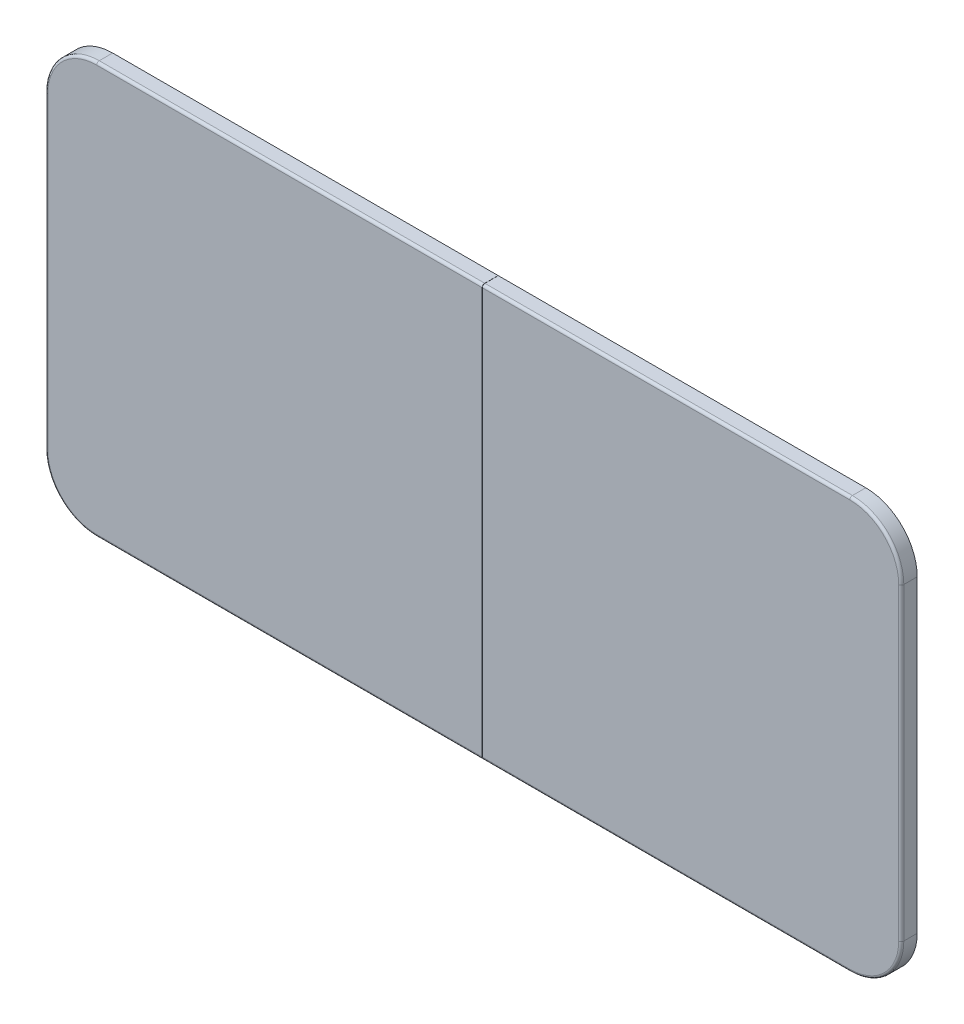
ISO-10303-21;
HEADER;
FILE_DESCRIPTION(('STEP AP214'),'2;1');
FILE_NAME('part.step','',(''),(''),'','','');
FILE_SCHEMA(('AUTOMOTIVE_DESIGN { 1 0 10303 214 1 1 1 1 }'));
ENDSEC;
DATA;
#1=APPLICATION_CONTEXT('core data for automotive mechanical design processes');
#2=APPLICATION_PROTOCOL_DEFINITION('international standard','automotive_design',2000,#1);
#3=PRODUCT_CONTEXT('',#1,'mechanical');
#4=PRODUCT('Part','Part','',(#3));
#5=PRODUCT_RELATED_PRODUCT_CATEGORY('part','',(#4));
#6=PRODUCT_DEFINITION_FORMATION('','',#4);
#7=PRODUCT_DEFINITION_CONTEXT('part definition',#1,'design');
#8=PRODUCT_DEFINITION('design','',#6,#7);
#9=PRODUCT_DEFINITION_SHAPE('','',#8);
#10=(LENGTH_UNIT() NAMED_UNIT(*) SI_UNIT(.MILLI.,.METRE.));
#11=(NAMED_UNIT(*) PLANE_ANGLE_UNIT() SI_UNIT($,.RADIAN.));
#12=(NAMED_UNIT(*) SI_UNIT($,.STERADIAN.) SOLID_ANGLE_UNIT());
#13=UNCERTAINTY_MEASURE_WITH_UNIT(LENGTH_MEASURE(1.E-05),#10,'distance_accuracy_value','');
#14=(GEOMETRIC_REPRESENTATION_CONTEXT(3) GLOBAL_UNCERTAINTY_ASSIGNED_CONTEXT((#13)) GLOBAL_UNIT_ASSIGNED_CONTEXT((#10,
#11,#12)) REPRESENTATION_CONTEXT('',''));
#15=CARTESIAN_POINT('',(0.,0.,0.));
#16=DIRECTION('',(0.,0.,1.));
#17=DIRECTION('',(1.,0.,0.));
#18=AXIS2_PLACEMENT_3D('',#15,#16,#17);
#19=CARTESIAN_POINT('',(20.0000508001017,-156.900406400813,6.2));
#20=DIRECTION('',(0.,1.,0.));
#21=DIRECTION('',(0.,0.,1.));
#22=AXIS2_PLACEMENT_3D('',#19,#20,#21);
#23=PLANE('',#22);
#24=DIRECTION('',(1.,0.,0.));
#25=VECTOR('',#24,1.);
#26=CARTESIAN_POINT('',(20.0000508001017,-156.900406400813,2.));
#27=LINE('',#26,#25);
#28=CARTESIAN_POINT('',(168.499301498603,-156.900406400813,2.));
#29=VERTEX_POINT('',#28);
#30=CARTESIAN_POINT('',(169.974301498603,-156.900406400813,2.));
#31=VERTEX_POINT('',#30);
#32=EDGE_CURVE('E849',#29,#31,#27,.T.);
#33=ORIENTED_EDGE('',*,*,#32,.T.);
#34=DIRECTION('',(0.,0.,-1.));
#35=VECTOR('',#34,1.);
#36=CARTESIAN_POINT('',(169.974301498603,-156.900406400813,6.2));
#37=LINE('',#36,#35);
#38=CARTESIAN_POINT('',(169.974301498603,-156.900406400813,0.));
#39=VERTEX_POINT('',#38);
#40=EDGE_CURVE('E93',#31,#39,#37,.T.);
#41=ORIENTED_EDGE('',*,*,#40,.T.);
#42=DIRECTION('',(1.,0.,0.));
#43=VECTOR('',#42,1.);
#44=CARTESIAN_POINT('',(20.0000508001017,-156.900406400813,0.));
#45=LINE('',#44,#43);
#46=CARTESIAN_POINT('',(20.0000508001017,-156.900406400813,0.));
#47=VERTEX_POINT('',#46);
#48=EDGE_CURVE('E755',#47,#39,#45,.T.);
#49=ORIENTED_EDGE('',*,*,#48,.F.);
#50=DIRECTION('',(0.,0.,1.));
#51=VECTOR('',#50,1.);
#52=CARTESIAN_POINT('',(20.0000508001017,-156.900406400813,6.2));
#53=LINE('',#52,#51);
#54=CARTESIAN_POINT('',(20.0000508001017,-156.900406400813,5.));
#55=VERTEX_POINT('',#54);
#56=EDGE_CURVE('E1099',#55,#47,#53,.F.);
#57=ORIENTED_EDGE('',*,*,#56,.F.);
#58=DIRECTION('',(-1.,0.,0.));
#59=VECTOR('',#58,1.);
#60=CARTESIAN_POINT('',(19.9952948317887,-156.900406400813,5.));
#61=LINE('',#60,#59);
#62=CARTESIAN_POINT('',(92.400317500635,-156.900406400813,5.));
#63=VERTEX_POINT('',#62);
#64=EDGE_CURVE('E702',#63,#55,#61,.T.);
#65=ORIENTED_EDGE('',*,*,#64,.F.);
#66=DIRECTION('',(0.,0.,-1.));
#67=VECTOR('',#66,1.);
#68=CARTESIAN_POINT('',(92.400317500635,-156.900406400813,6.2));
#69=LINE('',#68,#67);
#70=CARTESIAN_POINT('',(92.400317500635,-156.900406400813,2.));
#71=VERTEX_POINT('',#70);
#72=EDGE_CURVE('E790',#63,#71,#69,.T.);
#73=ORIENTED_EDGE('',*,*,#72,.T.);
#74=DIRECTION('',(1.,0.,0.));
#75=VECTOR('',#74,1.);
#76=CARTESIAN_POINT('',(20.0000508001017,-156.900406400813,2.));
#77=LINE('',#76,#75);
#78=CARTESIAN_POINT('',(93.600317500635,-156.900406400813,2.));
#79=VERTEX_POINT('',#78);
#80=EDGE_CURVE('E792',#71,#79,#77,.T.);
#81=ORIENTED_EDGE('',*,*,#80,.T.);
#82=DIRECTION('',(0.,0.,1.));
#83=VECTOR('',#82,1.);
#84=CARTESIAN_POINT('',(93.600317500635,-156.900406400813,6.2));
#85=LINE('',#84,#83);
#86=CARTESIAN_POINT('',(93.6003175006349,-156.900406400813,5.));
#87=VERTEX_POINT('',#86);
#88=EDGE_CURVE('E793',#79,#87,#85,.T.);
#89=ORIENTED_EDGE('',*,*,#88,.T.);
#90=CARTESIAN_POINT('',(168.499301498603,-156.900406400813,5.));
#91=VERTEX_POINT('',#90);
#92=EDGE_CURVE('E696',#91,#87,#61,.T.);
#93=ORIENTED_EDGE('',*,*,#92,.F.);
#94=DIRECTION('',(0.,0.,-1.));
#95=VECTOR('',#94,1.);
#96=CARTESIAN_POINT('',(168.499301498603,-156.900406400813,6.2));
#97=LINE('',#96,#95);
#98=EDGE_CURVE('E796',#91,#29,#97,.T.);
#99=ORIENTED_EDGE('',*,*,#98,.T.);
#100=EDGE_LOOP('',(#33,#41,#49,#57,#65,#73,#81,#89,#93,#99));
#101=FACE_BOUND('',#100,.T.);
#102=ADVANCED_FACE('F43',(#101),#23,.T.);
#103=CARTESIAN_POINT('',(170.599301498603,-138.100406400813,-139.501162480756));
#104=DIRECTION('',(0.,1.,0.));
#105=DIRECTION('',(0.,0.,1.));
#106=AXIS2_PLACEMENT_3D('',#103,#104,#105);
#107=PLANE('',#106);
#108=DIRECTION('',(0.,0.,-1.));
#109=VECTOR('',#108,1.);
#110=CARTESIAN_POINT('',(169.974301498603,-138.100406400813,-139.501162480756));
#111=LINE('',#110,#109);
#112=CARTESIAN_POINT('',(169.974301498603,-138.100406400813,2.));
#113=VERTEX_POINT('',#112);
#114=CARTESIAN_POINT('',(169.974301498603,-138.100406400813,0.));
#115=VERTEX_POINT('',#114);
#116=EDGE_CURVE('E86',#113,#115,#111,.T.);
#117=ORIENTED_EDGE('',*,*,#116,.F.);
#118=DIRECTION('',(-1.,0.,0.));
#119=VECTOR('',#118,1.);
#120=CARTESIAN_POINT('',(170.599301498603,-138.100406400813,2.));
#121=LINE('',#120,#119);
#122=CARTESIAN_POINT('',(169.399301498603,-138.100406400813,2.));
#123=VERTEX_POINT('',#122);
#124=EDGE_CURVE('E46',#113,#123,#121,.T.);
#125=ORIENTED_EDGE('',*,*,#124,.T.);
#126=DIRECTION('',(0.,0.,1.));
#127=VECTOR('',#126,1.);
#128=CARTESIAN_POINT('',(169.399301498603,-138.100406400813,-139.501162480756));
#129=LINE('',#128,#127);
#130=CARTESIAN_POINT('',(169.399301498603,-138.100406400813,1.20000000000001));
#131=VERTEX_POINT('',#130);
#132=EDGE_CURVE('E688',#131,#123,#129,.T.);
#133=ORIENTED_EDGE('',*,*,#132,.F.);
#134=DIRECTION('',(-1.,0.,0.));
#135=VECTOR('',#134,1.);
#136=CARTESIAN_POINT('',(173.499301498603,-138.100406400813,1.2));
#137=LINE('',#136,#135);
#138=CARTESIAN_POINT('',(166.499301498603,-138.100406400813,1.2));
#139=VERTEX_POINT('',#138);
#140=EDGE_CURVE('E750',#131,#139,#137,.T.);
#141=ORIENTED_EDGE('',*,*,#140,.T.);
#142=DIRECTION('',(0.,0.,-1.));
#143=VECTOR('',#142,1.);
#144=CARTESIAN_POINT('',(166.499301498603,-138.100406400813,1.2));
#145=LINE('',#144,#143);
#146=CARTESIAN_POINT('',(166.499301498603,-138.100406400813,0.));
#147=VERTEX_POINT('',#146);
#148=EDGE_CURVE('E746',#139,#147,#145,.T.);
#149=ORIENTED_EDGE('',*,*,#148,.T.);
#150=DIRECTION('',(1.,0.,0.));
#151=VECTOR('',#150,1.);
#152=CARTESIAN_POINT('',(170.599301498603,-138.100406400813,0.));
#153=LINE('',#152,#151);
#154=EDGE_CURVE('E749',#147,#115,#153,.T.);
#155=ORIENTED_EDGE('',*,*,#154,.T.);
#156=EDGE_LOOP('',(#117,#125,#133,#141,#149,#155));
#157=FACE_BOUND('',#156,.T.);
#158=ADVANCED_FACE('F933',(#157),#107,.F.);
#159=CARTESIAN_POINT('',(19.9952948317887,-18.0196088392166,0.));
#160=DIRECTION('',(0.,0.,1.));
#161=DIRECTION('',(1.,0.,0.));
#162=AXIS2_PLACEMENT_3D('',#159,#160,#161);
#163=PLANE('',#162);
#164=DIRECTION('',(0.,1.,0.));
#165=VECTOR('',#164,1.);
#166=CARTESIAN_POINT('',(169.974301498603,-18.0196088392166,0.));
#167=LINE('',#166,#165);
#168=CARTESIAN_POINT('',(169.974301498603,-158.100406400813,0.));
#169=VERTEX_POINT('',#168);
#170=EDGE_CURVE('E845',#169,#39,#167,.T.);
#171=ORIENTED_EDGE('',*,*,#170,.F.);
#172=DIRECTION('',(1.,0.,0.));
#173=VECTOR('',#172,1.);
#174=CARTESIAN_POINT('',(20.0000508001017,-158.100406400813,0.));
#175=LINE('',#174,#173);
#176=CARTESIAN_POINT('',(20.0000508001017,-158.100406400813,0.));
#177=VERTEX_POINT('',#176);
#178=EDGE_CURVE('E862',#177,#169,#175,.T.);
#179=ORIENTED_EDGE('',*,*,#178,.F.);
#180=CARTESIAN_POINT('',(20.0000508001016,-138.100355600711,0.));
#181=DIRECTION('',(0.,0.,1.));
#182=DIRECTION('',(1.,0.,0.));
#183=AXIS2_PLACEMENT_3D('',#180,#181,#182);
#184=CIRCLE('',#183,20.0000508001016);
#185=CARTESIAN_POINT('',(0.308630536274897,-141.600355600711,0.));
#186=VERTEX_POINT('',#185);
#187=EDGE_CURVE('E1067',#186,#177,#184,.T.);
#188=ORIENTED_EDGE('',*,*,#187,.F.);
#189=DIRECTION('',(-1.,0.,0.));
#190=VECTOR('',#189,1.);
#191=CARTESIAN_POINT('',(1.52866996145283,-141.600355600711,0.));
#192=LINE('',#191,#190);
#193=CARTESIAN_POINT('',(1.52866996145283,-141.600355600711,0.));
#194=VERTEX_POINT('',#193);
#195=EDGE_CURVE('E1152',#194,#186,#192,.T.);
#196=ORIENTED_EDGE('',*,*,#195,.F.);
#197=CARTESIAN_POINT('',(20.0000508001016,-138.100355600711,0.));
#198=DIRECTION('',(0.,0.,1.));
#199=DIRECTION('',(1.,0.,0.));
#200=AXIS2_PLACEMENT_3D('',#197,#198,#199);
#201=CIRCLE('',#200,18.8000508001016);
#202=EDGE_CURVE('E871',#194,#47,#201,.T.);
#203=ORIENTED_EDGE('',*,*,#202,.T.);
#204=ORIENTED_EDGE('',*,*,#48,.T.);
#205=EDGE_LOOP('',(#171,#179,#188,#196,#203,#204));
#206=FACE_BOUND('',#205,.T.);
#207=ADVANCED_FACE('F954',(#206),#163,.F.);
#208=CARTESIAN_POINT('',(169.974301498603,1.9904531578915,0.));
#209=VERTEX_POINT('',#208);
#210=EDGE_CURVE('E52',#115,#209,#167,.T.);
#211=ORIENTED_EDGE('',*,*,#210,.F.);
#212=ORIENTED_EDGE('',*,*,#154,.F.);
#213=DIRECTION('',(0.,1.,0.));
#214=VECTOR('',#213,1.);
#215=CARTESIAN_POINT('',(166.499301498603,1.39045482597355,0.));
#216=LINE('',#215,#214);
#217=CARTESIAN_POINT('',(166.499301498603,0.790221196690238,0.));
#218=VERTEX_POINT('',#217);
#219=EDGE_CURVE('E751',#147,#218,#216,.T.);
#220=ORIENTED_EDGE('',*,*,#219,.T.);
#221=DIRECTION('',(-0.999999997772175,-6.67506553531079E-05,0.));
#222=VECTOR('',#221,1.);
#223=CARTESIAN_POINT('',(19.9953749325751,0.780441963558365,0.));
#224=LINE('',#223,#222);
#225=CARTESIAN_POINT('',(96.5003175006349,0.785548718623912,0.));
#226=VERTEX_POINT('',#225);
#227=EDGE_CURVE('E754',#218,#226,#224,.T.);
#228=ORIENTED_EDGE('',*,*,#227,.T.);
#229=DIRECTION('',(0.,-1.,0.));
#230=VECTOR('',#229,1.);
#231=CARTESIAN_POINT('',(96.500317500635,1.38531509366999,0.));
#232=LINE('',#231,#230);
#233=CARTESIAN_POINT('',(96.5003175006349,-138.100406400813,0.));
#234=VERTEX_POINT('',#233);
#235=EDGE_CURVE('E782',#226,#234,#232,.T.);
#236=ORIENTED_EDGE('',*,*,#235,.T.);
#237=DIRECTION('',(1.,0.,0.));
#238=VECTOR('',#237,1.);
#239=CARTESIAN_POINT('',(93.600317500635,-138.100406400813,0.));
#240=LINE('',#239,#238);
#241=CARTESIAN_POINT('',(89.500317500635,-138.100406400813,0.));
#242=VERTEX_POINT('',#241);
#243=EDGE_CURVE('E735',#242,#234,#240,.T.);
#244=ORIENTED_EDGE('',*,*,#243,.F.);
#245=DIRECTION('',(0.,1.,0.));
#246=VECTOR('',#245,1.);
#247=CARTESIAN_POINT('',(89.500317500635,1.38531509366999,0.));
#248=LINE('',#247,#246);
#249=CARTESIAN_POINT('',(89.500317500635,0.7850814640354,0.));
#250=VERTEX_POINT('',#249);
#251=EDGE_CURVE('E778',#242,#250,#248,.T.);
#252=ORIENTED_EDGE('',*,*,#251,.T.);
#253=CARTESIAN_POINT('',(19.9952948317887,0.780441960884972,0.));
#254=VERTEX_POINT('',#253);
#255=EDGE_CURVE('E781',#250,#254,#224,.T.);
#256=ORIENTED_EDGE('',*,*,#255,.T.);
#257=CARTESIAN_POINT('',(19.9952948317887,-18.0196088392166,0.));
#258=DIRECTION('',(0.,0.,1.));
#259=DIRECTION('',(1.,0.,0.));
#260=AXIS2_PLACEMENT_3D('',#257,#258,#259);
#261=CIRCLE('',#260,18.8000508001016);
#262=CARTESIAN_POINT('',(9.1952440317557,-2.63127518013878,0.));
#263=VERTEX_POINT('',#262);
#264=EDGE_CURVE('E818',#254,#263,#261,.T.);
#265=ORIENTED_EDGE('',*,*,#264,.T.);
#266=DIRECTION('',(0.,-1.,0.));
#267=VECTOR('',#266,1.);
#268=CARTESIAN_POINT('',(9.1952440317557,-18.019558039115,0.));
#269=LINE('',#268,#267);
#270=CARTESIAN_POINT('',(9.1952440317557,-18.019558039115,0.));
#271=VERTEX_POINT('',#270);
#272=EDGE_CURVE('E814',#263,#271,#269,.T.);
#273=ORIENTED_EDGE('',*,*,#272,.T.);
#274=DIRECTION('',(1.,0.,0.));
#275=VECTOR('',#274,1.);
#276=CARTESIAN_POINT('',(20.493625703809,-18.019558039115,0.));
#277=LINE('',#276,#275);
#278=CARTESIAN_POINT('',(-0.00475596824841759,-18.019558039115,0.));
#279=VERTEX_POINT('',#278);
#280=EDGE_CURVE('E822',#279,#271,#277,.T.);
#281=ORIENTED_EDGE('',*,*,#280,.F.);
#282=CARTESIAN_POINT('',(19.9952948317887,-18.0196088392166,0.));
#283=DIRECTION('',(0.,0.,1.));
#284=DIRECTION('',(1.,0.,0.));
#285=AXIS2_PLACEMENT_3D('',#282,#283,#284);
#286=CIRCLE('',#285,20.0000508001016);
#287=CARTESIAN_POINT('',(19.9952948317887,1.98044196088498,0.));
#288=VERTEX_POINT('',#287);
#289=EDGE_CURVE('E1095',#288,#279,#286,.T.);
#290=ORIENTED_EDGE('',*,*,#289,.F.);
#291=DIRECTION('',(-0.999999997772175,-6.67506553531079E-05,0.));
#292=VECTOR('',#291,1.);
#293=CARTESIAN_POINT('',(19.9952948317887,1.98044196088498,0.));
#294=LINE('',#293,#292);
#295=EDGE_CURVE('E856',#209,#288,#294,.T.);
#296=ORIENTED_EDGE('',*,*,#295,.F.);
#297=EDGE_LOOP('',(#211,#212,#220,#228,#236,#244,#252,#256,#265,#273,#281,#290,#296));
#298=FACE_BOUND('',#297,.T.);
#299=ADVANCED_FACE('F917',(#298),#163,.F.);
#300=CARTESIAN_POINT('',(20.0000508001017,-158.100406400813,6.2));
#301=DIRECTION('',(0.,1.,0.));
#302=DIRECTION('',(0.,0.,1.));
#303=AXIS2_PLACEMENT_3D('',#300,#301,#302);
#304=PLANE('',#303);
#305=DIRECTION('',(0.,0.,-1.));
#306=VECTOR('',#305,1.);
#307=CARTESIAN_POINT('',(169.974301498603,-158.100406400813,6.2));
#308=LINE('',#307,#306);
#309=CARTESIAN_POINT('',(169.974301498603,-158.100406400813,5.2));
#310=VERTEX_POINT('',#309);
#311=EDGE_CURVE('E835',#310,#169,#308,.T.);
#312=ORIENTED_EDGE('',*,*,#311,.F.);
#313=DIRECTION('',(1.,0.,0.));
#314=VECTOR('',#313,1.);
#315=CARTESIAN_POINT('',(20.0000508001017,-158.100406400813,5.2));
#316=LINE('',#315,#314);
#317=CARTESIAN_POINT('',(20.0000508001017,-158.100406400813,5.2));
#318=VERTEX_POINT('',#317);
#319=EDGE_CURVE('E817',#310,#318,#316,.F.);
#320=ORIENTED_EDGE('',*,*,#319,.T.);
#321=DIRECTION('',(0.,0.,-1.));
#322=VECTOR('',#321,1.);
#323=CARTESIAN_POINT('',(20.0000508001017,-158.100406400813,6.2));
#324=LINE('',#323,#322);
#325=EDGE_CURVE('E852',#318,#177,#324,.T.);
#326=ORIENTED_EDGE('',*,*,#325,.T.);
#327=ORIENTED_EDGE('',*,*,#178,.T.);
#328=EDGE_LOOP('',(#312,#320,#326,#327));
#329=FACE_BOUND('',#328,.T.);
#330=ADVANCED_FACE('F967',(#329),#304,.F.);
#331=CARTESIAN_POINT('',(19.9952948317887,1.98044196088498,6.2));
#332=DIRECTION('',(6.67506553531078E-05,-0.999999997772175,0.));
#333=DIRECTION('',(0.999999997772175,6.67506553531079E-05,0.));
#334=AXIS2_PLACEMENT_3D('',#331,#332,#333);
#335=PLANE('',#334);
#336=DIRECTION('',(0.,0.,1.));
#337=VECTOR('',#336,1.);
#338=CARTESIAN_POINT('',(169.974301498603,1.9904531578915,6.2));
#339=LINE('',#338,#337);
#340=CARTESIAN_POINT('',(169.974301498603,1.9904531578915,5.2));
#341=VERTEX_POINT('',#340);
#342=EDGE_CURVE('E12',#209,#341,#339,.T.);
#343=ORIENTED_EDGE('',*,*,#342,.F.);
#344=ORIENTED_EDGE('',*,*,#295,.T.);
#345=DIRECTION('',(0.,0.,-1.));
#346=VECTOR('',#345,1.);
#347=CARTESIAN_POINT('',(19.9952948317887,1.98044196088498,6.2));
#348=LINE('',#347,#346);
#349=CARTESIAN_POINT('',(19.9952948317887,1.98044196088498,5.2));
#350=VERTEX_POINT('',#349);
#351=EDGE_CURVE('E1056',#350,#288,#348,.T.);
#352=ORIENTED_EDGE('',*,*,#351,.F.);
#353=DIRECTION('',(-0.999999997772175,-6.67506553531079E-05,0.));
#354=VECTOR('',#353,1.);
#355=CARTESIAN_POINT('',(312.996748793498,1.9999999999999,5.2));
#356=LINE('',#355,#354);
#357=EDGE_CURVE('E853',#350,#341,#356,.F.);
#358=ORIENTED_EDGE('',*,*,#357,.T.);
#359=EDGE_LOOP('',(#343,#344,#352,#358));
#360=FACE_BOUND('',#359,.T.);
#361=ADVANCED_FACE('F970',(#360),#335,.F.);
#362=CARTESIAN_POINT('',(19.9952948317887,-18.0196088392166,6.2));
#363=DIRECTION('',(0.,0.,1.));
#364=DIRECTION('',(1.,0.,0.));
#365=AXIS2_PLACEMENT_3D('',#362,#363,#364);
#366=PLANE('',#365);
#367=DIRECTION('',(1.,0.,0.));
#368=VECTOR('',#367,1.);
#369=CARTESIAN_POINT('',(313.000787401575,-157.100406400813,6.2));
#370=LINE('',#369,#368);
#371=CARTESIAN_POINT('',(20.0000508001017,-157.100406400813,6.2));
#372=VERTEX_POINT('',#371);
#373=CARTESIAN_POINT('',(169.974301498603,-157.100406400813,6.2));
#374=VERTEX_POINT('',#373);
#375=EDGE_CURVE('E838',#372,#374,#370,.T.);
#376=ORIENTED_EDGE('',*,*,#375,.T.);
#377=DIRECTION('',(0.,1.,0.));
#378=VECTOR('',#377,1.);
#379=CARTESIAN_POINT('',(169.974301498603,-18.0196088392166,6.2));
#380=LINE('',#379,#378);
#381=CARTESIAN_POINT('',(169.974301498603,0.99045315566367,6.2));
#382=VERTEX_POINT('',#381);
#383=EDGE_CURVE('E61',#374,#382,#380,.T.);
#384=ORIENTED_EDGE('',*,*,#383,.T.);
#385=DIRECTION('',(-0.999999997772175,-6.67506553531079E-05,0.));
#386=VECTOR('',#385,1.);
#387=CARTESIAN_POINT('',(19.995361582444,0.980441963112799,6.2));
#388=LINE('',#387,#386);
#389=CARTESIAN_POINT('',(19.995361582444,0.98044196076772,6.2));
#390=VERTEX_POINT('',#389);
#391=EDGE_CURVE('E837',#382,#390,#388,.T.);
#392=ORIENTED_EDGE('',*,*,#391,.T.);
#393=CARTESIAN_POINT('',(19.9952948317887,-18.0196088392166,6.2));
#394=DIRECTION('',(0.,0.,1.));
#395=DIRECTION('',(1.,0.,0.));
#396=AXIS2_PLACEMENT_3D('',#393,#394,#395);
#397=CIRCLE('',#396,19.0000508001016);
#398=CARTESIAN_POINT('',(0.995961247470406,-18.1846959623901,6.2));
#399=VERTEX_POINT('',#398);
#400=EDGE_CURVE('E858',#390,#399,#397,.T.);
#401=ORIENTED_EDGE('',*,*,#400,.T.);
#402=DIRECTION('',(3.36799472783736E-05,-0.999999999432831,0.));
#403=VECTOR('',#402,1.);
#404=CARTESIAN_POINT('',(0.999999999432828,-138.100321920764,6.2));
#405=LINE('',#404,#403);
#406=CARTESIAN_POINT('',(1.00000000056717,-138.100355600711,6.2));
#407=VERTEX_POINT('',#406);
#408=EDGE_CURVE('E1078',#399,#407,#405,.T.);
#409=ORIENTED_EDGE('',*,*,#408,.T.);
#410=CARTESIAN_POINT('',(20.0000508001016,-138.100355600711,6.2));
#411=DIRECTION('',(0.,0.,1.));
#412=DIRECTION('',(1.,0.,0.));
#413=AXIS2_PLACEMENT_3D('',#410,#411,#412);
#414=CIRCLE('',#413,19.0000508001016);
#415=EDGE_CURVE('E842',#407,#372,#414,.T.);
#416=ORIENTED_EDGE('',*,*,#415,.T.);
#417=EDGE_LOOP('',(#376,#384,#392,#401,#409,#416));
#418=FACE_BOUND('',#417,.T.);
#419=ADVANCED_FACE('F974',(#418),#366,.T.);
#420=CARTESIAN_POINT('',(19.9952948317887,-157.100406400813,5.2));
#421=DIRECTION('',(-1.,0.,0.));
#422=DIRECTION('',(0.,0.,1.));
#423=AXIS2_PLACEMENT_3D('',#420,#421,#422);
#424=CYLINDRICAL_SURFACE('',#423,1.);
#425=ORIENTED_EDGE('',*,*,#319,.F.);
#426=CARTESIAN_POINT('',(169.974301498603,-157.100406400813,5.2));
#427=DIRECTION('',(1.,0.,0.));
#428=DIRECTION('',(0.,1.,0.));
#429=AXIS2_PLACEMENT_3D('',#426,#427,#428);
#430=CIRCLE('',#429,1.);
#431=EDGE_CURVE('E839',#310,#374,#430,.F.);
#432=ORIENTED_EDGE('',*,*,#431,.T.);
#433=ORIENTED_EDGE('',*,*,#375,.F.);
#434=CARTESIAN_POINT('',(20.0000508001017,-157.100406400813,5.2));
#435=DIRECTION('',(-1.,0.,0.));
#436=DIRECTION('',(0.,0.,1.));
#437=AXIS2_PLACEMENT_3D('',#434,#435,#436);
#438=CIRCLE('',#437,1.);
#439=EDGE_CURVE('E1051',#318,#372,#438,.T.);
#440=ORIENTED_EDGE('',*,*,#439,.F.);
#441=EDGE_LOOP('',(#425,#432,#433,#440));
#442=FACE_BOUND('',#441,.T.);
#443=ADVANCED_FACE('F978',(#442),#424,.T.);
#444=CARTESIAN_POINT('',(19.994026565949,0.980441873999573,5.2));
#445=DIRECTION('',(0.999999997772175,6.67506553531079E-05,0.));
#446=DIRECTION('',(-6.67506553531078E-05,0.999999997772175,0.));
#447=AXIS2_PLACEMENT_3D('',#444,#445,#446);
#448=CYLINDRICAL_SURFACE('',#447,1.);
#449=ORIENTED_EDGE('',*,*,#391,.F.);
#450=CARTESIAN_POINT('',(169.974301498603,0.99045315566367,5.2));
#451=DIRECTION('',(1.,0.,0.));
#452=DIRECTION('',(0.,1.,0.));
#453=AXIS2_PLACEMENT_3D('',#450,#451,#452);
#454=ELLIPSE('',#453,1.00000000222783,1.);
#455=EDGE_CURVE('E841',#382,#341,#454,.F.);
#456=ORIENTED_EDGE('',*,*,#455,.T.);
#457=ORIENTED_EDGE('',*,*,#357,.F.);
#458=CARTESIAN_POINT('',(19.9952948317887,0.980441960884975,5.2));
#459=DIRECTION('',(0.999999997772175,0.,-6.67506551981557E-05));
#460=DIRECTION('',(-6.67506551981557E-05,0.,-0.999999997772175));
#461=AXIS2_PLACEMENT_3D('',#458,#459,#460);
#462=CIRCLE('',#461,1.);
#463=EDGE_CURVE('E697',#350,#390,#462,.T.);
#464=ORIENTED_EDGE('',*,*,#463,.T.);
#465=EDGE_LOOP('',(#449,#456,#457,#464));
#466=FACE_BOUND('',#465,.T.);
#467=ADVANCED_FACE('F980',(#466),#448,.T.);
#468=CARTESIAN_POINT('',(19.9952948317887,-18.0196088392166,2.));
#469=DIRECTION('',(0.,0.,1.));
#470=DIRECTION('',(1.,0.,0.));
#471=AXIS2_PLACEMENT_3D('',#468,#469,#470);
#472=PLANE('',#471);
#473=DIRECTION('',(0.,1.,0.));
#474=VECTOR('',#473,1.);
#475=CARTESIAN_POINT('',(169.974301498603,-18.0196088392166,2.));
#476=LINE('',#475,#474);
#477=EDGE_CURVE('E90',#31,#113,#476,.T.);
#478=ORIENTED_EDGE('',*,*,#477,.F.);
#479=ORIENTED_EDGE('',*,*,#32,.F.);
#480=DIRECTION('',(0.,-1.,0.));
#481=VECTOR('',#480,1.);
#482=CARTESIAN_POINT('',(168.499301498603,1.39045482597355,2.));
#483=LINE('',#482,#481);
#484=CARTESIAN_POINT('',(168.499301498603,0.790354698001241,2.));
#485=VERTEX_POINT('',#484);
#486=EDGE_CURVE('E682',#485,#29,#483,.T.);
#487=ORIENTED_EDGE('',*,*,#486,.F.);
#488=DIRECTION('',(-0.999999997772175,-6.67506553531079E-05,0.));
#489=VECTOR('',#488,1.);
#490=CARTESIAN_POINT('',(19.9953749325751,0.780441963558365,2.));
#491=LINE('',#490,#489);
#492=CARTESIAN_POINT('',(169.399301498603,0.790414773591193,2.));
#493=VERTEX_POINT('',#492);
#494=EDGE_CURVE('E674',#493,#485,#491,.T.);
#495=ORIENTED_EDGE('',*,*,#494,.F.);
#496=DIRECTION('',(0.,-1.,0.));
#497=VECTOR('',#496,1.);
#498=CARTESIAN_POINT('',(169.399301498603,1.39045482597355,2.));
#499=LINE('',#498,#497);
#500=EDGE_CURVE('E678',#493,#123,#499,.T.);
#501=ORIENTED_EDGE('',*,*,#500,.T.);
#502=ORIENTED_EDGE('',*,*,#124,.F.);
#503=EDGE_LOOP('',(#478,#479,#487,#495,#501,#502));
#504=FACE_BOUND('',#503,.T.);
#505=ADVANCED_FACE('F676',(#504),#472,.F.);
#506=CARTESIAN_POINT('',(19.9952948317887,-18.0196088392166,5.));
#507=DIRECTION('',(0.,0.,1.));
#508=DIRECTION('',(1.,0.,0.));
#509=AXIS2_PLACEMENT_3D('',#506,#507,#508);
#510=PLANE('',#509);
#511=DIRECTION('',(0.,1.,0.));
#512=VECTOR('',#511,1.);
#513=CARTESIAN_POINT('',(168.499301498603,1.39045482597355,5.));
#514=LINE('',#513,#512);
#515=CARTESIAN_POINT('',(168.499301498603,0.790354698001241,5.));
#516=VERTEX_POINT('',#515);
#517=EDGE_CURVE('E813',#91,#516,#514,.T.);
#518=ORIENTED_EDGE('',*,*,#517,.F.);
#519=ORIENTED_EDGE('',*,*,#92,.T.);
#520=DIRECTION('',(0.,-1.,0.));
#521=VECTOR('',#520,1.);
#522=CARTESIAN_POINT('',(93.600317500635,1.38531509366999,5.));
#523=LINE('',#522,#521);
#524=CARTESIAN_POINT('',(93.600317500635,0.785355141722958,5.));
#525=VERTEX_POINT('',#524);
#526=EDGE_CURVE('E731',#525,#87,#523,.T.);
#527=ORIENTED_EDGE('',*,*,#526,.F.);
#528=DIRECTION('',(0.999999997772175,6.67506553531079E-05,0.));
#529=VECTOR('',#528,1.);
#530=CARTESIAN_POINT('',(19.9940399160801,0.780441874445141,5.));
#531=LINE('',#530,#529);
#532=EDGE_CURVE('E713',#525,#516,#531,.T.);
#533=ORIENTED_EDGE('',*,*,#532,.T.);
#534=EDGE_LOOP('',(#518,#519,#527,#533));
#535=FACE_BOUND('',#534,.T.);
#536=ADVANCED_FACE('F885',(#535),#510,.F.);
#537=CARTESIAN_POINT('',(169.399301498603,1.39045482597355,-139.501162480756));
#538=DIRECTION('',(1.,0.,0.));
#539=DIRECTION('',(0.,1.,0.));
#540=AXIS2_PLACEMENT_3D('',#537,#538,#539);
#541=PLANE('',#540);
#542=ORIENTED_EDGE('',*,*,#500,.F.);
#543=DIRECTION('',(0.,0.,1.));
#544=VECTOR('',#543,1.);
#545=CARTESIAN_POINT('',(169.399301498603,0.790414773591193,6.2));
#546=LINE('',#545,#544);
#547=CARTESIAN_POINT('',(169.399301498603,0.790414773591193,1.20000000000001));
#548=VERTEX_POINT('',#547);
#549=EDGE_CURVE('E693',#548,#493,#546,.T.);
#550=ORIENTED_EDGE('',*,*,#549,.F.);
#551=DIRECTION('',(0.,1.,0.));
#552=VECTOR('',#551,1.);
#553=CARTESIAN_POINT('',(169.399301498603,1.39045482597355,1.20000000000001));
#554=LINE('',#553,#552);
#555=EDGE_CURVE('E743',#131,#548,#554,.T.);
#556=ORIENTED_EDGE('',*,*,#555,.F.);
#557=ORIENTED_EDGE('',*,*,#132,.T.);
#558=EDGE_LOOP('',(#542,#550,#556,#557));
#559=FACE_BOUND('',#558,.T.);
#560=ADVANCED_FACE('F692',(#559),#541,.F.);
#561=CARTESIAN_POINT('',(19.9953749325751,0.780441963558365,6.2));
#562=DIRECTION('',(6.67506553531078E-05,-0.999999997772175,0.));
#563=DIRECTION('',(0.999999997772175,6.67506553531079E-05,0.));
#564=AXIS2_PLACEMENT_3D('',#561,#562,#563);
#565=PLANE('',#564);
#566=ORIENTED_EDGE('',*,*,#494,.T.);
#567=DIRECTION('',(0.,0.,1.));
#568=VECTOR('',#567,1.);
#569=CARTESIAN_POINT('',(168.499301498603,0.790354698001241,6.2));
#570=LINE('',#569,#568);
#571=EDGE_CURVE('E687',#485,#516,#570,.T.);
#572=ORIENTED_EDGE('',*,*,#571,.T.);
#573=ORIENTED_EDGE('',*,*,#532,.F.);
#574=DIRECTION('',(0.,0.,-1.));
#575=VECTOR('',#574,1.);
#576=CARTESIAN_POINT('',(93.600317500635,0.785355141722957,6.2));
#577=LINE('',#576,#575);
#578=CARTESIAN_POINT('',(93.600317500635,0.785355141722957,1.20000000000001));
#579=VERTEX_POINT('',#578);
#580=EDGE_CURVE('E718',#525,#579,#577,.T.);
#581=ORIENTED_EDGE('',*,*,#580,.T.);
#582=DIRECTION('',(0.999999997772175,6.67506553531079E-05,0.));
#583=VECTOR('',#582,1.);
#584=CARTESIAN_POINT('',(19.9953749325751,0.780441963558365,1.2));
#585=LINE('',#584,#583);
#586=CARTESIAN_POINT('',(96.500317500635,0.785548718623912,1.2));
#587=VERTEX_POINT('',#586);
#588=EDGE_CURVE('E706',#579,#587,#585,.T.);
#589=ORIENTED_EDGE('',*,*,#588,.T.);
#590=DIRECTION('',(0.,0.,1.));
#591=VECTOR('',#590,1.);
#592=CARTESIAN_POINT('',(96.500317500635,0.785548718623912,6.2));
#593=LINE('',#592,#591);
#594=EDGE_CURVE('E758',#226,#587,#593,.T.);
#595=ORIENTED_EDGE('',*,*,#594,.F.);
#596=ORIENTED_EDGE('',*,*,#227,.F.);
#597=DIRECTION('',(0.,0.,-1.));
#598=VECTOR('',#597,1.);
#599=CARTESIAN_POINT('',(166.499301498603,0.790221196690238,6.2));
#600=LINE('',#599,#598);
#601=CARTESIAN_POINT('',(166.499301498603,0.790221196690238,1.2));
#602=VERTEX_POINT('',#601);
#603=EDGE_CURVE('E738',#602,#218,#600,.T.);
#604=ORIENTED_EDGE('',*,*,#603,.F.);
#605=DIRECTION('',(0.999999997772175,6.67506553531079E-05,0.));
#606=VECTOR('',#605,1.);
#607=CARTESIAN_POINT('',(19.9953749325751,0.780441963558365,1.2));
#608=LINE('',#607,#606);
#609=EDGE_CURVE('E701',#602,#548,#608,.T.);
#610=ORIENTED_EDGE('',*,*,#609,.T.);
#611=ORIENTED_EDGE('',*,*,#549,.T.);
#612=EDGE_LOOP('',(#566,#572,#573,#581,#589,#595,#596,#604,#610,#611));
#613=FACE_BOUND('',#612,.T.);
#614=ADVANCED_FACE('F699',(#613),#565,.T.);
#615=DIRECTION('',(0.,1.,0.));
#616=VECTOR('',#615,1.);
#617=CARTESIAN_POINT('',(92.400317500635,1.38531509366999,5.));
#618=LINE('',#617,#616);
#619=CARTESIAN_POINT('',(92.400317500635,0.785275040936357,5.));
#620=VERTEX_POINT('',#619);
#621=EDGE_CURVE('E728',#63,#620,#618,.T.);
#622=ORIENTED_EDGE('',*,*,#621,.F.);
#623=ORIENTED_EDGE('',*,*,#64,.T.);
#624=CARTESIAN_POINT('',(20.0000508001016,-138.100355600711,5.));
#625=DIRECTION('',(0.,0.,1.));
#626=DIRECTION('',(1.,0.,0.));
#627=AXIS2_PLACEMENT_3D('',#624,#625,#626);
#628=CIRCLE('',#627,18.8000508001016);
#629=CARTESIAN_POINT('',(1.32334311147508,-140.250355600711,5.));
#630=VERTEX_POINT('',#629);
#631=EDGE_CURVE('E1107',#630,#55,#628,.T.);
#632=ORIENTED_EDGE('',*,*,#631,.F.);
#633=DIRECTION('',(-1.,0.,0.));
#634=VECTOR('',#633,1.);
#635=CARTESIAN_POINT('',(19.9952948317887,-140.250355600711,5.));
#636=LINE('',#635,#634);
#637=CARTESIAN_POINT('',(0.115898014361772,-140.250355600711,5.));
#638=VERTEX_POINT('',#637);
#639=EDGE_CURVE('E704',#630,#638,#636,.T.);
#640=ORIENTED_EDGE('',*,*,#639,.T.);
#641=CARTESIAN_POINT('',(20.0000508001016,-138.100355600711,5.));
#642=DIRECTION('',(0.,0.,-1.));
#643=DIRECTION('',(-1.,0.,0.));
#644=AXIS2_PLACEMENT_3D('',#641,#642,#643);
#645=CIRCLE('',#644,20.0000508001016);
#646=CARTESIAN_POINT('',(0.,-138.100355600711,5.));
#647=VERTEX_POINT('',#646);
#648=EDGE_CURVE('E1130',#638,#647,#645,.T.);
#649=ORIENTED_EDGE('',*,*,#648,.T.);
#650=DIRECTION('',(-3.36799472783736E-05,0.999999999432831,0.));
#651=VECTOR('',#650,1.);
#652=CARTESIAN_POINT('',(-0.00403860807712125,-18.1890017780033,5.));
#653=LINE('',#652,#651);
#654=CARTESIAN_POINT('',(-0.000153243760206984,-133.550355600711,5.));
#655=VERTEX_POINT('',#654);
#656=EDGE_CURVE('E1126',#647,#655,#653,.T.);
#657=ORIENTED_EDGE('',*,*,#656,.T.);
#658=DIRECTION('',(1.,0.,0.));
#659=VECTOR('',#658,1.);
#660=CARTESIAN_POINT('',(19.9952948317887,-133.550355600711,5.));
#661=LINE('',#660,#659);
#662=CARTESIAN_POINT('',(1.1998467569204,-133.550355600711,5.));
#663=VERTEX_POINT('',#662);
#664=EDGE_CURVE('E1129',#655,#663,#661,.T.);
#665=ORIENTED_EDGE('',*,*,#664,.T.);
#666=DIRECTION('',(3.36799472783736E-05,-0.999999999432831,0.));
#667=VECTOR('',#666,1.);
#668=CARTESIAN_POINT('',(1.19596139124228,-18.1889613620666,5.));
#669=LINE('',#668,#667);
#670=CARTESIAN_POINT('',(1.1997979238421,-132.10044008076,5.));
#671=VERTEX_POINT('',#670);
#672=EDGE_CURVE('E1457',#671,#663,#669,.T.);
#673=ORIENTED_EDGE('',*,*,#672,.F.);
#674=CARTESIAN_POINT('',(2.19979792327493,-132.100406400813,5.));
#675=DIRECTION('',(0.,0.,1.));
#676=DIRECTION('',(1.,0.,0.));
#677=AXIS2_PLACEMENT_3D('',#674,#675,#676);
#678=CIRCLE('',#677,1.);
#679=CARTESIAN_POINT('',(2.19979792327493,-131.100406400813,4.99999999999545));
#680=VERTEX_POINT('',#679);
#681=EDGE_CURVE('E1487',#671,#680,#678,.F.);
#682=ORIENTED_EDGE('',*,*,#681,.T.);
#683=DIRECTION('',(-1.,0.,0.));
#684=VECTOR('',#683,1.);
#685=CARTESIAN_POINT('',(3.99973898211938,-131.100406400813,4.99999999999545));
#686=LINE('',#685,#684);
#687=CARTESIAN_POINT('',(3.99973898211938,-131.100406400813,5.00000000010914));
#688=VERTEX_POINT('',#687);
#689=EDGE_CURVE('E1390',#688,#680,#686,.T.);
#690=ORIENTED_EDGE('',*,*,#689,.F.);
#691=DIRECTION('',(0.,-1.,0.));
#692=VECTOR('',#691,1.);
#693=CARTESIAN_POINT('',(3.99973898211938,-129.600406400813,4.99999999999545));
#694=LINE('',#693,#692);
#695=CARTESIAN_POINT('',(3.99973898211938,-129.600406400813,5.00000000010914));
#696=VERTEX_POINT('',#695);
#697=EDGE_CURVE('E1405',#696,#688,#694,.T.);
#698=ORIENTED_EDGE('',*,*,#697,.F.);
#699=DIRECTION('',(1.,0.,0.));
#700=VECTOR('',#699,1.);
#701=CARTESIAN_POINT('',(3.99973898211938,-129.600406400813,4.99999999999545));
#702=LINE('',#701,#700);
#703=CARTESIAN_POINT('',(2.19968004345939,-129.600406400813,4.99999999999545));
#704=VERTEX_POINT('',#703);
#705=EDGE_CURVE('E1408',#704,#696,#702,.T.);
#706=ORIENTED_EDGE('',*,*,#705,.F.);
#707=CARTESIAN_POINT('',(2.19968004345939,-128.600406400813,5.));
#708=DIRECTION('',(0.,0.,1.));
#709=DIRECTION('',(1.,0.,0.));
#710=AXIS2_PLACEMENT_3D('',#707,#708,#709);
#711=CIRCLE('',#710,1.);
#712=CARTESIAN_POINT('',(1.19968004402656,-128.60044008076,5.));
#713=VERTEX_POINT('',#712);
#714=EDGE_CURVE('E1485',#704,#713,#711,.F.);
#715=ORIENTED_EDGE('',*,*,#714,.T.);
#716=CARTESIAN_POINT('',(1.199582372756,-125.700457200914,5.));
#717=VERTEX_POINT('',#716);
#718=EDGE_CURVE('E1461',#717,#713,#669,.T.);
#719=ORIENTED_EDGE('',*,*,#718,.F.);
#720=DIRECTION('',(-1.,0.,0.));
#721=VECTOR('',#720,1.);
#722=CARTESIAN_POINT('',(19.9952948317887,-125.700457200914,5.));
#723=LINE('',#722,#721);
#724=CARTESIAN_POINT('',(-0.000417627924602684,-125.700457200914,5.));
#725=VERTEX_POINT('',#724);
#726=EDGE_CURVE('E1177',#717,#725,#723,.T.);
#727=ORIENTED_EDGE('',*,*,#726,.T.);
#728=DIRECTION('',(-3.36799472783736E-05,0.999999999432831,0.));
#729=VECTOR('',#728,1.);
#730=CARTESIAN_POINT('',(-0.00403860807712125,-18.1890017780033,5.));
#731=LINE('',#730,#729);
#732=CARTESIAN_POINT('',(-0.000424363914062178,-125.500457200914,5.));
#733=VERTEX_POINT('',#732);
#734=EDGE_CURVE('E1173',#725,#733,#731,.T.);
#735=ORIENTED_EDGE('',*,*,#734,.T.);
#736=DIRECTION('',(1.,0.,0.));
#737=VECTOR('',#736,1.);
#738=CARTESIAN_POINT('',(19.9952948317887,-125.500457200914,5.));
#739=LINE('',#738,#737);
#740=CARTESIAN_POINT('',(1.19957563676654,-125.500457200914,5.));
#741=VERTEX_POINT('',#740);
#742=EDGE_CURVE('E1176',#733,#741,#739,.T.);
#743=ORIENTED_EDGE('',*,*,#742,.T.);
#744=CARTESIAN_POINT('',(1.19940891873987,-120.550389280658,5.));
#745=VERTEX_POINT('',#744);
#746=EDGE_CURVE('E1453',#745,#741,#669,.T.);
#747=ORIENTED_EDGE('',*,*,#746,.F.);
#748=CARTESIAN_POINT('',(2.1994089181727,-120.550355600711,5.));
#749=DIRECTION('',(0.,0.,1.));
#750=DIRECTION('',(1.,0.,0.));
#751=AXIS2_PLACEMENT_3D('',#748,#749,#750);
#752=CIRCLE('',#751,1.);
#753=CARTESIAN_POINT('',(2.19940891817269,-119.550355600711,4.99999999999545));
#754=VERTEX_POINT('',#753);
#755=EDGE_CURVE('E1484',#745,#754,#752,.F.);
#756=ORIENTED_EDGE('',*,*,#755,.T.);
#757=DIRECTION('',(-1.,0.,0.));
#758=VECTOR('',#757,1.);
#759=CARTESIAN_POINT('',(-0.000675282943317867,-119.550355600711,4.99999999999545));
#760=LINE('',#759,#758);
#761=CARTESIAN_POINT('',(3.99934997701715,-119.550355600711,5.00000000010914));
#762=VERTEX_POINT('',#761);
#763=EDGE_CURVE('E1366',#762,#754,#760,.T.);
#764=ORIENTED_EDGE('',*,*,#763,.F.);
#765=DIRECTION('',(0.,-1.,0.));
#766=VECTOR('',#765,1.);
#767=CARTESIAN_POINT('',(3.99934997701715,-118.050355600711,4.99999999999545));
#768=LINE('',#767,#766);
#769=CARTESIAN_POINT('',(3.99934997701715,-118.050355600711,5.00000000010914));
#770=VERTEX_POINT('',#769);
#771=EDGE_CURVE('E1382',#770,#762,#768,.T.);
#772=ORIENTED_EDGE('',*,*,#771,.F.);
#773=DIRECTION('',(1.,0.,0.));
#774=VECTOR('',#773,1.);
#775=CARTESIAN_POINT('',(-0.000675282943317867,-118.050355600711,4.99999999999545));
#776=LINE('',#775,#774);
#777=CARTESIAN_POINT('',(2.19929103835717,-118.050355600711,4.99999999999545));
#778=VERTEX_POINT('',#777);
#779=EDGE_CURVE('E1378',#778,#770,#776,.T.);
#780=ORIENTED_EDGE('',*,*,#779,.F.);
#781=CARTESIAN_POINT('',(2.19929103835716,-117.050355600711,5.));
#782=DIRECTION('',(0.,0.,1.));
#783=DIRECTION('',(1.,0.,0.));
#784=AXIS2_PLACEMENT_3D('',#781,#782,#783);
#785=CIRCLE('',#784,1.);
#786=CARTESIAN_POINT('',(1.19929103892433,-117.050389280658,5.));
#787=VERTEX_POINT('',#786);
#788=EDGE_CURVE('E1482',#778,#787,#785,.F.);
#789=ORIENTED_EDGE('',*,*,#788,.T.);
#790=CARTESIAN_POINT('',(1.19912431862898,-112.100254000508,5.));
#791=VERTEX_POINT('',#790);
#792=EDGE_CURVE('E1465',#791,#787,#669,.T.);
#793=ORIENTED_EDGE('',*,*,#792,.F.);
#794=DIRECTION('',(-1.,0.,0.));
#795=VECTOR('',#794,1.);
#796=CARTESIAN_POINT('',(19.9952948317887,-112.100254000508,5.));
#797=LINE('',#796,#795);
#798=CARTESIAN_POINT('',(-0.000875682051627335,-112.100254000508,5.));
#799=VERTEX_POINT('',#798);
#800=EDGE_CURVE('E1172',#791,#799,#797,.T.);
#801=ORIENTED_EDGE('',*,*,#800,.T.);
#802=DIRECTION('',(-3.36799472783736E-05,0.999999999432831,0.));
#803=VECTOR('',#802,1.);
#804=CARTESIAN_POINT('',(-0.00403860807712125,-18.1890017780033,5.));
#805=LINE('',#804,#803);
#806=CARTESIAN_POINT('',(-0.000882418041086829,-111.900254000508,5.));
#807=VERTEX_POINT('',#806);
#808=EDGE_CURVE('E1168',#799,#807,#805,.T.);
#809=ORIENTED_EDGE('',*,*,#808,.T.);
#810=DIRECTION('',(1.,0.,0.));
#811=VECTOR('',#810,1.);
#812=CARTESIAN_POINT('',(19.9952948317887,-111.900254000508,5.));
#813=LINE('',#812,#811);
#814=CARTESIAN_POINT('',(1.19911758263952,-111.900254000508,5.));
#815=VERTEX_POINT('',#814);
#816=EDGE_CURVE('E1171',#807,#815,#813,.T.);
#817=ORIENTED_EDGE('',*,*,#816,.T.);
#818=CARTESIAN_POINT('',(1.19895423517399,-107.050262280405,5.));
#819=VERTEX_POINT('',#818);
#820=EDGE_CURVE('E1449',#819,#815,#669,.T.);
#821=ORIENTED_EDGE('',*,*,#820,.F.);
#822=CARTESIAN_POINT('',(2.19895423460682,-107.050228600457,5.));
#823=DIRECTION('',(0.,0.,1.));
#824=DIRECTION('',(1.,0.,0.));
#825=AXIS2_PLACEMENT_3D('',#822,#823,#824);
#826=CIRCLE('',#825,1.);
#827=CARTESIAN_POINT('',(2.19895423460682,-106.050228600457,4.99999999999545));
#828=VERTEX_POINT('',#827);
#829=EDGE_CURVE('E1481',#819,#828,#826,.F.);
#830=ORIENTED_EDGE('',*,*,#829,.T.);
#831=DIRECTION('',(-1.,0.,0.));
#832=VECTOR('',#831,1.);
#833=CARTESIAN_POINT('',(3.99889529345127,-106.050228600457,4.99999999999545));
#834=LINE('',#833,#832);
#835=CARTESIAN_POINT('',(3.99889529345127,-106.050228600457,5.00000000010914));
#836=VERTEX_POINT('',#835);
#837=EDGE_CURVE('E1342',#836,#828,#834,.T.);
#838=ORIENTED_EDGE('',*,*,#837,.F.);
#839=DIRECTION('',(0.,-1.,0.));
#840=VECTOR('',#839,1.);
#841=CARTESIAN_POINT('',(3.99889529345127,-104.550228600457,4.99999999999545));
#842=LINE('',#841,#840);
#843=CARTESIAN_POINT('',(3.99889529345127,-104.550228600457,5.00000000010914));
#844=VERTEX_POINT('',#843);
#845=EDGE_CURVE('E1357',#844,#836,#842,.T.);
#846=ORIENTED_EDGE('',*,*,#845,.F.);
#847=DIRECTION('',(1.,0.,0.));
#848=VECTOR('',#847,1.);
#849=CARTESIAN_POINT('',(3.99889529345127,-104.550228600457,4.99999999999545));
#850=LINE('',#849,#848);
#851=CARTESIAN_POINT('',(2.19883635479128,-104.550228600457,4.99999999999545));
#852=VERTEX_POINT('',#851);
#853=EDGE_CURVE('E1360',#852,#844,#850,.T.);
#854=ORIENTED_EDGE('',*,*,#853,.F.);
#855=CARTESIAN_POINT('',(2.19883635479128,-103.550228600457,5.));
#856=DIRECTION('',(0.,0.,1.));
#857=DIRECTION('',(1.,0.,0.));
#858=AXIS2_PLACEMENT_3D('',#855,#856,#857);
#859=CIRCLE('',#858,1.);
#860=CARTESIAN_POINT('',(1.19883635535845,-103.550262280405,5.));
#861=VERTEX_POINT('',#860);
#862=EDGE_CURVE('E1479',#852,#861,#859,.F.);
#863=ORIENTED_EDGE('',*,*,#862,.T.);
#864=CARTESIAN_POINT('',(1.19867300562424,-98.7002032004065,5.));
#865=VERTEX_POINT('',#864);
#866=EDGE_CURVE('E1469',#865,#861,#669,.T.);
#867=ORIENTED_EDGE('',*,*,#866,.F.);
#868=DIRECTION('',(-1.,0.,0.));
#869=VECTOR('',#868,1.);
#870=CARTESIAN_POINT('',(19.9952948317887,-98.7002032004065,5.));
#871=LINE('',#870,#869);
#872=CARTESIAN_POINT('',(-0.00132699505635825,-98.7002032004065,5.));
#873=VERTEX_POINT('',#872);
#874=EDGE_CURVE('E1167',#865,#873,#871,.T.);
#875=ORIENTED_EDGE('',*,*,#874,.T.);
#876=DIRECTION('',(-3.36799472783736E-05,0.999999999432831,0.));
#877=VECTOR('',#876,1.);
#878=CARTESIAN_POINT('',(-0.00403860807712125,-18.1890017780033,5.));
#879=LINE('',#878,#877);
#880=CARTESIAN_POINT('',(-0.00133373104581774,-98.5002032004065,5.));
#881=VERTEX_POINT('',#880);
#882=EDGE_CURVE('E1163',#873,#881,#879,.T.);
#883=ORIENTED_EDGE('',*,*,#882,.T.);
#884=DIRECTION('',(1.,0.,0.));
#885=VECTOR('',#884,1.);
#886=CARTESIAN_POINT('',(19.9952948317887,-98.5002032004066,5.));
#887=LINE('',#886,#885);
#888=CARTESIAN_POINT('',(1.19866626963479,-98.5002032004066,5.));
#889=VERTEX_POINT('',#888);
#890=EDGE_CURVE('E1166',#881,#889,#887,.T.);
#891=ORIENTED_EDGE('',*,*,#890,.T.);
#892=CARTESIAN_POINT('',(1.19849955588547,-93.5502622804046,5.));
#893=VERTEX_POINT('',#892);
#894=EDGE_CURVE('E1445',#893,#889,#669,.T.);
#895=ORIENTED_EDGE('',*,*,#894,.F.);
#896=CARTESIAN_POINT('',(2.1984995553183,-93.5502286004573,5.));
#897=DIRECTION('',(0.,0.,1.));
#898=DIRECTION('',(1.,0.,0.));
#899=AXIS2_PLACEMENT_3D('',#896,#897,#898);
#900=CIRCLE('',#899,1.);
#901=CARTESIAN_POINT('',(2.1984995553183,-92.5502286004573,4.99999999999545));
#902=VERTEX_POINT('',#901);
#903=EDGE_CURVE('E1478',#893,#902,#900,.F.);
#904=ORIENTED_EDGE('',*,*,#903,.T.);
#905=DIRECTION('',(-1.,0.,0.));
#906=VECTOR('',#905,1.);
#907=CARTESIAN_POINT('',(-0.00158464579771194,-92.5502286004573,4.99999999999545));
#908=LINE('',#907,#906);
#909=CARTESIAN_POINT('',(3.99844061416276,-92.5502286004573,5.00000000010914));
#910=VERTEX_POINT('',#909);
#911=EDGE_CURVE('E1318',#910,#902,#908,.T.);
#912=ORIENTED_EDGE('',*,*,#911,.F.);
#913=DIRECTION('',(0.,-1.,0.));
#914=VECTOR('',#913,1.);
#915=CARTESIAN_POINT('',(3.99844061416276,-91.0502286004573,4.99999999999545));
#916=LINE('',#915,#914);
#917=CARTESIAN_POINT('',(3.99844061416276,-91.0502286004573,5.00000000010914));
#918=VERTEX_POINT('',#917);
#919=EDGE_CURVE('E1334',#918,#910,#916,.T.);
#920=ORIENTED_EDGE('',*,*,#919,.F.);
#921=DIRECTION('',(1.,0.,0.));
#922=VECTOR('',#921,1.);
#923=CARTESIAN_POINT('',(-0.00158464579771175,-91.0502286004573,4.99999999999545));
#924=LINE('',#923,#922);
#925=CARTESIAN_POINT('',(2.19838167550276,-91.0502286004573,4.99999999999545));
#926=VERTEX_POINT('',#925);
#927=EDGE_CURVE('E1330',#926,#918,#924,.T.);
#928=ORIENTED_EDGE('',*,*,#927,.F.);
#929=CARTESIAN_POINT('',(2.19838167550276,-90.0502286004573,5.));
#930=DIRECTION('',(0.,0.,1.));
#931=DIRECTION('',(1.,0.,0.));
#932=AXIS2_PLACEMENT_3D('',#929,#930,#931);
#933=CIRCLE('',#932,1.);
#934=CARTESIAN_POINT('',(1.19838167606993,-90.0502622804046,5.));
#935=VERTEX_POINT('',#934);
#936=EDGE_CURVE('E1476',#926,#935,#933,.F.);
#937=ORIENTED_EDGE('',*,*,#936,.T.);
#938=CARTESIAN_POINT('',(1.19821496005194,-85.1002540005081,5.));
#939=VERTEX_POINT('',#938);
#940=EDGE_CURVE('E1196',#939,#935,#669,.T.);
#941=ORIENTED_EDGE('',*,*,#940,.F.);
#942=DIRECTION('',(-1.,0.,0.));
#943=VECTOR('',#942,1.);
#944=CARTESIAN_POINT('',(19.9952948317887,-85.1002540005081,5.));
#945=LINE('',#944,#943);
#946=CARTESIAN_POINT('',(-0.00178504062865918,-85.1002540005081,5.));
#947=VERTEX_POINT('',#946);
#948=EDGE_CURVE('E1162',#939,#947,#945,.T.);
#949=ORIENTED_EDGE('',*,*,#948,.T.);
#950=DIRECTION('',(-3.36799472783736E-05,0.999999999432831,0.));
#951=VECTOR('',#950,1.);
#952=CARTESIAN_POINT('',(-0.00403860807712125,-18.1890017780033,5.));
#953=LINE('',#952,#951);
#954=CARTESIAN_POINT('',(-0.00179177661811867,-84.9002540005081,5.));
#955=VERTEX_POINT('',#954);
#956=EDGE_CURVE('E1158',#947,#955,#953,.T.);
#957=ORIENTED_EDGE('',*,*,#956,.T.);
#958=DIRECTION('',(1.,0.,0.));
#959=VECTOR('',#958,1.);
#960=CARTESIAN_POINT('',(19.9952948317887,-84.9002540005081,5.));
#961=LINE('',#960,#959);
#962=CARTESIAN_POINT('',(1.19820822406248,-84.9002540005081,5.));
#963=VERTEX_POINT('',#962);
#964=EDGE_CURVE('E1161',#955,#963,#961,.T.);
#965=ORIENTED_EDGE('',*,*,#964,.T.);
#966=CARTESIAN_POINT('',(1.19804319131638,-80.0002241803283,5.));
#967=VERTEX_POINT('',#966);
#968=EDGE_CURVE('E1117',#967,#963,#669,.T.);
#969=ORIENTED_EDGE('',*,*,#968,.F.);
#970=CARTESIAN_POINT('',(2.19804319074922,-80.0001905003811,5.));
#971=DIRECTION('',(0.,0.,1.));
#972=DIRECTION('',(1.,0.,0.));
#973=AXIS2_PLACEMENT_3D('',#970,#971,#972);
#974=CIRCLE('',#973,1.);
#975=CARTESIAN_POINT('',(2.19804319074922,-79.0001905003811,4.99999999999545));
#976=VERTEX_POINT('',#975);
#977=EDGE_CURVE('E1475',#967,#976,#974,.F.);
#978=ORIENTED_EDGE('',*,*,#977,.T.);
#979=DIRECTION('',(-1.,0.,0.));
#980=VECTOR('',#979,1.);
#981=CARTESIAN_POINT('',(3.99798424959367,-79.0001905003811,4.99999999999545));
#982=LINE('',#981,#980);
#983=CARTESIAN_POINT('',(3.99798424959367,-79.0001905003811,5.00000000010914));
#984=VERTEX_POINT('',#983);
#985=EDGE_CURVE('E1305',#984,#976,#982,.T.);
#986=ORIENTED_EDGE('',*,*,#985,.F.);
#987=DIRECTION('',(0.,-1.,0.));
#988=VECTOR('',#987,1.);
#989=CARTESIAN_POINT('',(3.99798424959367,-77.5001905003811,4.99999999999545));
#990=LINE('',#989,#988);
#991=CARTESIAN_POINT('',(3.99798424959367,-77.5001905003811,5.00000000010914));
#992=VERTEX_POINT('',#991);
#993=EDGE_CURVE('E1309',#992,#984,#990,.T.);
#994=ORIENTED_EDGE('',*,*,#993,.F.);
#995=DIRECTION('',(1.,0.,0.));
#996=VECTOR('',#995,1.);
#997=CARTESIAN_POINT('',(3.99798424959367,-77.5001905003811,4.99999999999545));
#998=LINE('',#997,#996);
#999=CARTESIAN_POINT('',(2.19792531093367,-77.5001905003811,4.99999999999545));
#1000=VERTEX_POINT('',#999);
#1001=EDGE_CURVE('E1312',#1000,#992,#998,.T.);
#1002=ORIENTED_EDGE('',*,*,#1001,.F.);
#1003=CARTESIAN_POINT('',(2.19792531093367,-76.5001905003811,5.));
#1004=DIRECTION('',(0.,0.,1.));
#1005=DIRECTION('',(1.,0.,0.));
#1006=AXIS2_PLACEMENT_3D('',#1003,#1004,#1005);
#1007=CIRCLE('',#1006,1.);
#1008=CARTESIAN_POINT('',(1.19792531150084,-76.5002241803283,5.));
#1009=VERTEX_POINT('',#1008);
#1010=EDGE_CURVE('E1473',#1000,#1009,#1007,.F.);
#1011=ORIENTED_EDGE('',*,*,#1010,.T.);
#1012=CARTESIAN_POINT('',(1.19776027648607,-71.600127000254,5.));
#1013=VERTEX_POINT('',#1012);
#1014=EDGE_CURVE('E1118',#1013,#1009,#669,.T.);
#1015=ORIENTED_EDGE('',*,*,#1014,.F.);
#1016=DIRECTION('',(-1.,0.,0.));
#1017=VECTOR('',#1016,1.);
#1018=CARTESIAN_POINT('',(19.9952948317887,-71.600127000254,5.));
#1019=LINE('',#1018,#1017);
#1020=CARTESIAN_POINT('',(-0.00223972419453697,-71.600127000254,5.));
#1021=VERTEX_POINT('',#1020);
#1022=EDGE_CURVE('E1157',#1013,#1021,#1019,.T.);
#1023=ORIENTED_EDGE('',*,*,#1022,.T.);
#1024=DIRECTION('',(-3.36799472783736E-05,0.999999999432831,0.));
#1025=VECTOR('',#1024,1.);
#1026=CARTESIAN_POINT('',(-0.00403860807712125,-18.1890017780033,5.));
#1027=LINE('',#1026,#1025);
#1028=CARTESIAN_POINT('',(-0.00224646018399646,-71.400127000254,5.));
#1029=VERTEX_POINT('',#1028);
#1030=EDGE_CURVE('E1154',#1021,#1029,#1027,.T.);
#1031=ORIENTED_EDGE('',*,*,#1030,.T.);
#1032=DIRECTION('',(1.,0.,0.));
#1033=VECTOR('',#1032,1.);
#1034=CARTESIAN_POINT('',(19.9952948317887,-71.400127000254,5.));
#1035=LINE('',#1034,#1033);
#1036=CARTESIAN_POINT('',(1.19775354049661,-71.400127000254,5.));
#1037=VERTEX_POINT('',#1036);
#1038=EDGE_CURVE('E867',#1029,#1037,#1035,.T.);
#1039=ORIENTED_EDGE('',*,*,#1038,.T.);
#1040=CARTESIAN_POINT('',(1.19596121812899,-18.183821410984,5.));
#1041=VERTEX_POINT('',#1040);
#1042=EDGE_CURVE('E1113',#1041,#1037,#669,.T.);
#1043=ORIENTED_EDGE('',*,*,#1042,.F.);
#1044=CARTESIAN_POINT('',(19.9952948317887,-18.0196088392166,5.));
#1045=DIRECTION('',(0.,0.,1.));
#1046=DIRECTION('',(1.,0.,0.));
#1047=AXIS2_PLACEMENT_3D('',#1044,#1045,#1046);
#1048=CIRCLE('',#1047,18.8000508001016);
#1049=CARTESIAN_POINT('',(19.9952948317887,0.780441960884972,5.));
#1050=VERTEX_POINT('',#1049);
#1051=EDGE_CURVE('E808',#1050,#1041,#1048,.T.);
#1052=ORIENTED_EDGE('',*,*,#1051,.F.);
#1053=EDGE_CURVE('E800',#1050,#620,#531,.T.);
#1054=ORIENTED_EDGE('',*,*,#1053,.T.);
#1055=EDGE_LOOP('',(#622,#623,#632,#640,#649,#657,#665,#673,#682,#690,#698,#706,#715,#719,#727,
#735,#743,#747,#756,#764,#772,#780,#789,#793,#801,#809,#817,#821,#830,#838,#846,#854,#863,#867,
#875,#883,#891,#895,#904,#912,#920,#928,#937,#941,#949,#957,#965,#969,#978,#986,#994,#1002,
#1011,#1015,#1023,#1031,#1039,#1043,#1052,#1054));
#1056=FACE_BOUND('',#1055,.T.);
#1057=ADVANCED_FACE('F1002',(#1056),#510,.F.);
#1058=CARTESIAN_POINT('',(93.600317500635,-138.100406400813,-139.501162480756));
#1059=DIRECTION('',(0.,1.,0.));
#1060=DIRECTION('',(0.,0.,1.));
#1061=AXIS2_PLACEMENT_3D('',#1058,#1059,#1060);
#1062=PLANE('',#1061);
#1063=DIRECTION('',(-1.,0.,0.));
#1064=VECTOR('',#1063,1.);
#1065=CARTESIAN_POINT('',(93.600317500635,-138.100406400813,2.));
#1066=LINE('',#1065,#1064);
#1067=CARTESIAN_POINT('',(93.600317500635,-138.100406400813,2.));
#1068=VERTEX_POINT('',#1067);
#1069=CARTESIAN_POINT('',(92.400317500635,-138.100406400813,2.));
#1070=VERTEX_POINT('',#1069);
#1071=EDGE_CURVE('E798',#1068,#1070,#1066,.T.);
#1072=ORIENTED_EDGE('',*,*,#1071,.T.);
#1073=DIRECTION('',(0.,0.,1.));
#1074=VECTOR('',#1073,1.);
#1075=CARTESIAN_POINT('',(92.400317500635,-138.100406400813,-139.501162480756));
#1076=LINE('',#1075,#1074);
#1077=CARTESIAN_POINT('',(92.400317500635,-138.100406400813,1.20000000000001));
#1078=VERTEX_POINT('',#1077);
#1079=EDGE_CURVE('E723',#1078,#1070,#1076,.T.);
#1080=ORIENTED_EDGE('',*,*,#1079,.F.);
#1081=DIRECTION('',(-1.,0.,0.));
#1082=VECTOR('',#1081,1.);
#1083=CARTESIAN_POINT('',(96.5003175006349,-138.100406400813,1.2));
#1084=LINE('',#1083,#1082);
#1085=CARTESIAN_POINT('',(89.500317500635,-138.100406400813,1.2));
#1086=VERTEX_POINT('',#1085);
#1087=EDGE_CURVE('E777',#1078,#1086,#1084,.T.);
#1088=ORIENTED_EDGE('',*,*,#1087,.T.);
#1089=DIRECTION('',(0.,0.,-1.));
#1090=VECTOR('',#1089,1.);
#1091=CARTESIAN_POINT('',(89.500317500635,-138.100406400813,1.2));
#1092=LINE('',#1091,#1090);
#1093=EDGE_CURVE('E737',#1086,#242,#1092,.T.);
#1094=ORIENTED_EDGE('',*,*,#1093,.T.);
#1095=ORIENTED_EDGE('',*,*,#243,.T.);
#1096=DIRECTION('',(0.,0.,-1.));
#1097=VECTOR('',#1096,1.);
#1098=CARTESIAN_POINT('',(96.5003175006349,-138.100406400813,1.2));
#1099=LINE('',#1098,#1097);
#1100=CARTESIAN_POINT('',(96.5003175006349,-138.100406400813,1.2));
#1101=VERTEX_POINT('',#1100);
#1102=EDGE_CURVE('E771',#1101,#234,#1099,.T.);
#1103=ORIENTED_EDGE('',*,*,#1102,.F.);
#1104=CARTESIAN_POINT('',(93.600317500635,-138.100406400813,1.20000000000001));
#1105=VERTEX_POINT('',#1104);
#1106=EDGE_CURVE('E724',#1101,#1105,#1084,.T.);
#1107=ORIENTED_EDGE('',*,*,#1106,.T.);
#1108=DIRECTION('',(0.,0.,1.));
#1109=VECTOR('',#1108,1.);
#1110=CARTESIAN_POINT('',(93.600317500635,-138.100406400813,-139.501162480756));
#1111=LINE('',#1110,#1109);
#1112=EDGE_CURVE('E721',#1105,#1068,#1111,.T.);
#1113=ORIENTED_EDGE('',*,*,#1112,.T.);
#1114=EDGE_LOOP('',(#1072,#1080,#1088,#1094,#1095,#1103,#1107,#1113));
#1115=FACE_BOUND('',#1114,.T.);
#1116=ADVANCED_FACE('F903',(#1115),#1062,.F.);
#1117=CARTESIAN_POINT('',(92.400317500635,1.38531509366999,-139.501162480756));
#1118=DIRECTION('',(1.,0.,0.));
#1119=DIRECTION('',(0.,1.,0.));
#1120=AXIS2_PLACEMENT_3D('',#1117,#1118,#1119);
#1121=PLANE('',#1120);
#1122=DIRECTION('',(0.,1.,0.));
#1123=VECTOR('',#1122,1.);
#1124=CARTESIAN_POINT('',(92.400317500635,1.38531509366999,1.20000000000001));
#1125=LINE('',#1124,#1123);
#1126=CARTESIAN_POINT('',(92.400317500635,0.785275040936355,1.20000000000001));
#1127=VERTEX_POINT('',#1126);
#1128=EDGE_CURVE('E768',#1078,#1127,#1125,.T.);
#1129=ORIENTED_EDGE('',*,*,#1128,.F.);
#1130=ORIENTED_EDGE('',*,*,#1079,.T.);
#1131=DIRECTION('',(0.,-1.,0.));
#1132=VECTOR('',#1131,1.);
#1133=CARTESIAN_POINT('',(92.400317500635,-138.100406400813,2.));
#1134=LINE('',#1133,#1132);
#1135=EDGE_CURVE('E727',#1070,#71,#1134,.T.);
#1136=ORIENTED_EDGE('',*,*,#1135,.T.);
#1137=ORIENTED_EDGE('',*,*,#72,.F.);
#1138=ORIENTED_EDGE('',*,*,#621,.T.);
#1139=DIRECTION('',(0.,0.,1.));
#1140=VECTOR('',#1139,1.);
#1141=CARTESIAN_POINT('',(92.400317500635,0.785275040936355,6.2));
#1142=LINE('',#1141,#1140);
#1143=EDGE_CURVE('E714',#1127,#620,#1142,.T.);
#1144=ORIENTED_EDGE('',*,*,#1143,.F.);
#1145=EDGE_LOOP('',(#1129,#1130,#1136,#1137,#1138,#1144));
#1146=FACE_BOUND('',#1145,.T.);
#1147=ADVANCED_FACE('F898',(#1146),#1121,.F.);
#1148=CARTESIAN_POINT('',(93.600317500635,1.38531509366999,-139.501162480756));
#1149=DIRECTION('',(-1.,0.,0.));
#1150=DIRECTION('',(0.,-1.,0.));
#1151=AXIS2_PLACEMENT_3D('',#1148,#1149,#1150);
#1152=PLANE('',#1151);
#1153=DIRECTION('',(0.,-1.,0.));
#1154=VECTOR('',#1153,1.);
#1155=CARTESIAN_POINT('',(93.600317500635,1.38531509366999,1.20000000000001));
#1156=LINE('',#1155,#1154);
#1157=EDGE_CURVE('E740',#579,#1105,#1156,.T.);
#1158=ORIENTED_EDGE('',*,*,#1157,.F.);
#1159=ORIENTED_EDGE('',*,*,#580,.F.);
#1160=ORIENTED_EDGE('',*,*,#526,.T.);
#1161=ORIENTED_EDGE('',*,*,#88,.F.);
#1162=DIRECTION('',(0.,1.,0.));
#1163=VECTOR('',#1162,1.);
#1164=CARTESIAN_POINT('',(93.600317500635,-138.100406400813,2.));
#1165=LINE('',#1164,#1163);
#1166=EDGE_CURVE('E734',#79,#1068,#1165,.T.);
#1167=ORIENTED_EDGE('',*,*,#1166,.T.);
#1168=ORIENTED_EDGE('',*,*,#1112,.F.);
#1169=EDGE_LOOP('',(#1158,#1159,#1160,#1161,#1167,#1168));
#1170=FACE_BOUND('',#1169,.T.);
#1171=ADVANCED_FACE('F888',(#1170),#1152,.F.);
#1172=DIRECTION('',(0.,0.,-1.));
#1173=VECTOR('',#1172,1.);
#1174=CARTESIAN_POINT('',(89.500317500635,0.785081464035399,6.2));
#1175=LINE('',#1174,#1173);
#1176=CARTESIAN_POINT('',(89.500317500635,0.785081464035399,1.2));
#1177=VERTEX_POINT('',#1176);
#1178=EDGE_CURVE('E762',#1177,#250,#1175,.T.);
#1179=ORIENTED_EDGE('',*,*,#1178,.F.);
#1180=DIRECTION('',(0.999999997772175,6.67506553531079E-05,0.));
#1181=VECTOR('',#1180,1.);
#1182=CARTESIAN_POINT('',(19.9953749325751,0.780441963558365,1.2));
#1183=LINE('',#1182,#1181);
#1184=EDGE_CURVE('E717',#1177,#1127,#1183,.T.);
#1185=ORIENTED_EDGE('',*,*,#1184,.T.);
#1186=ORIENTED_EDGE('',*,*,#1143,.T.);
#1187=ORIENTED_EDGE('',*,*,#1053,.F.);
#1188=DIRECTION('',(0.,0.,-1.));
#1189=VECTOR('',#1188,1.);
#1190=CARTESIAN_POINT('',(19.9952948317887,0.780441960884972,6.2));
#1191=LINE('',#1190,#1189);
#1192=EDGE_CURVE('E716',#1050,#254,#1191,.T.);
#1193=ORIENTED_EDGE('',*,*,#1192,.T.);
#1194=ORIENTED_EDGE('',*,*,#255,.F.);
#1195=EDGE_LOOP('',(#1179,#1185,#1186,#1187,#1193,#1194));
#1196=FACE_BOUND('',#1195,.T.);
#1197=ADVANCED_FACE('F988',(#1196),#565,.T.);
#1198=CARTESIAN_POINT('',(1.19596139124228,-18.1889613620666,6.2));
#1199=DIRECTION('',(0.999999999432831,3.36799472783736E-05,0.));
#1200=DIRECTION('',(-3.36799472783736E-05,0.999999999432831,0.));
#1201=AXIS2_PLACEMENT_3D('',#1198,#1199,#1200);
#1202=PLANE('',#1201);
#1203=DIRECTION('',(3.36799472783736E-05,-0.999999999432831,0.));
#1204=VECTOR('',#1203,1.);
#1205=CARTESIAN_POINT('',(1.19596139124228,-18.1889613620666,0.));
#1206=LINE('',#1205,#1204);
#1207=CARTESIAN_POINT('',(1.1997979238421,-132.10044008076,0.));
#1208=VERTEX_POINT('',#1207);
#1209=CARTESIAN_POINT('',(1.19980128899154,-132.200355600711,0.));
#1210=VERTEX_POINT('',#1209);
#1211=EDGE_CURVE('E1424',#1208,#1210,#1206,.T.);
#1212=ORIENTED_EDGE('',*,*,#1211,.F.);
#1213=DIRECTION('',(0.,0.,1.));
#1214=VECTOR('',#1213,1.);
#1215=CARTESIAN_POINT('',(1.1997979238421,-132.10044008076,4.99999999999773));
#1216=LINE('',#1215,#1214);
#1217=EDGE_CURVE('E1121',#1208,#671,#1216,.T.);
#1218=ORIENTED_EDGE('',*,*,#1217,.T.);
#1219=ORIENTED_EDGE('',*,*,#672,.T.);
#1220=CARTESIAN_POINT('',(1.1998467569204,-133.550355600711,3.65));
#1221=DIRECTION('',(0.999999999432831,3.36799472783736E-05,0.));
#1222=DIRECTION('',(3.36799472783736E-05,-0.999999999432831,0.));
#1223=AXIS2_PLACEMENT_3D('',#1220,#1221,#1222);
#1224=ELLIPSE('',#1223,1.35000000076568,1.35);
#1225=CARTESIAN_POINT('',(1.19980128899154,-132.200355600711,3.65));
#1226=VERTEX_POINT('',#1225);
#1227=EDGE_CURVE('E1139',#663,#1226,#1224,.F.);
#1228=ORIENTED_EDGE('',*,*,#1227,.T.);
#1229=DIRECTION('',(0.,0.,-1.));
#1230=VECTOR('',#1229,1.);
#1231=CARTESIAN_POINT('',(1.19980128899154,-132.200355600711,6.2));
#1232=LINE('',#1231,#1230);
#1233=EDGE_CURVE('E1135',#1226,#1210,#1232,.T.);
#1234=ORIENTED_EDGE('',*,*,#1233,.T.);
#1235=EDGE_LOOP('',(#1212,#1218,#1219,#1228,#1234));
#1236=FACE_BOUND('',#1235,.T.);
#1237=ADVANCED_FACE('F990',(#1236),#1202,.T.);
#1238=CARTESIAN_POINT('',(1.19940891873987,-120.550389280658,0.));
#1239=VERTEX_POINT('',#1238);
#1240=CARTESIAN_POINT('',(1.19948133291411,-122.700457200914,0.));
#1241=VERTEX_POINT('',#1240);
#1242=EDGE_CURVE('E1428',#1239,#1241,#1206,.T.);
#1243=ORIENTED_EDGE('',*,*,#1242,.F.);
#1244=DIRECTION('',(0.,0.,1.));
#1245=VECTOR('',#1244,1.);
#1246=CARTESIAN_POINT('',(1.19940891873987,-120.550389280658,4.99999999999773));
#1247=LINE('',#1246,#1245);
#1248=EDGE_CURVE('E1138',#1239,#745,#1247,.T.);
#1249=ORIENTED_EDGE('',*,*,#1248,.T.);
#1250=ORIENTED_EDGE('',*,*,#746,.T.);
#1251=CARTESIAN_POINT('',(1.19957563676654,-125.500457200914,2.2));
#1252=DIRECTION('',(0.999999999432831,3.36799472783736E-05,0.));
#1253=DIRECTION('',(3.36799472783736E-05,-0.999999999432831,0.));
#1254=AXIS2_PLACEMENT_3D('',#1251,#1252,#1253);
#1255=ELLIPSE('',#1254,2.80000000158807,2.8);
#1256=CARTESIAN_POINT('',(1.19948133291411,-122.700457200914,2.2));
#1257=VERTEX_POINT('',#1256);
#1258=EDGE_CURVE('E1264',#741,#1257,#1255,.F.);
#1259=ORIENTED_EDGE('',*,*,#1258,.T.);
#1260=DIRECTION('',(0.,0.,-1.));
#1261=VECTOR('',#1260,1.);
#1262=CARTESIAN_POINT('',(1.19948133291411,-122.700457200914,6.2));
#1263=LINE('',#1262,#1261);
#1264=EDGE_CURVE('E1260',#1257,#1241,#1263,.T.);
#1265=ORIENTED_EDGE('',*,*,#1264,.T.);
#1266=EDGE_LOOP('',(#1243,#1249,#1250,#1259,#1265));
#1267=FACE_BOUND('',#1266,.T.);
#1268=ADVANCED_FACE('F996',(#1267),#1202,.T.);
#1269=CARTESIAN_POINT('',(1.19895423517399,-107.050262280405,0.));
#1270=VERTEX_POINT('',#1269);
#1271=CARTESIAN_POINT('',(1.19902327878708,-109.100254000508,0.));
#1272=VERTEX_POINT('',#1271);
#1273=EDGE_CURVE('E1903',#1270,#1272,#1206,.T.);
#1274=ORIENTED_EDGE('',*,*,#1273,.F.);
#1275=DIRECTION('',(0.,0.,1.));
#1276=VECTOR('',#1275,1.);
#1277=CARTESIAN_POINT('',(1.19895423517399,-107.050262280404,4.99999999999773));
#1278=LINE('',#1277,#1276);
#1279=EDGE_CURVE('E1263',#1270,#819,#1278,.T.);
#1280=ORIENTED_EDGE('',*,*,#1279,.T.);
#1281=ORIENTED_EDGE('',*,*,#820,.T.);
#1282=CARTESIAN_POINT('',(1.19911758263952,-111.900254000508,2.2));
#1283=DIRECTION('',(0.999999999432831,3.36799472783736E-05,0.));
#1284=DIRECTION('',(3.36799472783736E-05,-0.999999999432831,0.));
#1285=AXIS2_PLACEMENT_3D('',#1282,#1283,#1284);
#1286=ELLIPSE('',#1285,2.80000000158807,2.8);
#1287=CARTESIAN_POINT('',(1.19902327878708,-109.100254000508,2.2));
#1288=VERTEX_POINT('',#1287);
#1289=EDGE_CURVE('E1249',#815,#1288,#1286,.F.);
#1290=ORIENTED_EDGE('',*,*,#1289,.T.);
#1291=DIRECTION('',(0.,0.,-1.));
#1292=VECTOR('',#1291,1.);
#1293=CARTESIAN_POINT('',(1.19902327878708,-109.100254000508,6.2));
#1294=LINE('',#1293,#1292);
#1295=EDGE_CURVE('E1245',#1288,#1272,#1294,.T.);
#1296=ORIENTED_EDGE('',*,*,#1295,.T.);
#1297=EDGE_LOOP('',(#1274,#1280,#1281,#1290,#1296));
#1298=FACE_BOUND('',#1297,.T.);
#1299=ADVANCED_FACE('F2028',(#1298),#1202,.T.);
#1300=CARTESIAN_POINT('',(1.19849955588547,-93.5502622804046,0.));
#1301=VERTEX_POINT('',#1300);
#1302=CARTESIAN_POINT('',(1.19857196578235,-95.7002032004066,0.));
#1303=VERTEX_POINT('',#1302);
#1304=EDGE_CURVE('E1888',#1301,#1303,#1206,.T.);
#1305=ORIENTED_EDGE('',*,*,#1304,.F.);
#1306=DIRECTION('',(0.,0.,1.));
#1307=VECTOR('',#1306,1.);
#1308=CARTESIAN_POINT('',(1.19849955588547,-93.5502622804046,4.99999999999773));
#1309=LINE('',#1308,#1307);
#1310=EDGE_CURVE('E1248',#1301,#893,#1309,.T.);
#1311=ORIENTED_EDGE('',*,*,#1310,.T.);
#1312=ORIENTED_EDGE('',*,*,#894,.T.);
#1313=CARTESIAN_POINT('',(1.19866626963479,-98.5002032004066,2.2));
#1314=DIRECTION('',(0.999999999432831,3.36799472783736E-05,0.));
#1315=DIRECTION('',(3.36799472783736E-05,-0.999999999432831,0.));
#1316=AXIS2_PLACEMENT_3D('',#1313,#1314,#1315);
#1317=ELLIPSE('',#1316,2.80000000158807,2.8);
#1318=CARTESIAN_POINT('',(1.19857196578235,-95.7002032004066,2.2));
#1319=VERTEX_POINT('',#1318);
#1320=EDGE_CURVE('E1231',#889,#1319,#1317,.F.);
#1321=ORIENTED_EDGE('',*,*,#1320,.T.);
#1322=DIRECTION('',(0.,0.,-1.));
#1323=VECTOR('',#1322,1.);
#1324=CARTESIAN_POINT('',(1.19857196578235,-95.7002032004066,6.2));
#1325=LINE('',#1324,#1323);
#1326=EDGE_CURVE('E1227',#1319,#1303,#1325,.T.);
#1327=ORIENTED_EDGE('',*,*,#1326,.T.);
#1328=EDGE_LOOP('',(#1305,#1311,#1312,#1321,#1327));
#1329=FACE_BOUND('',#1328,.T.);
#1330=ADVANCED_FACE('F1938',(#1329),#1202,.T.);
#1331=CARTESIAN_POINT('',(1.19804319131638,-80.0002241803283,0.));
#1332=VERTEX_POINT('',#1331);
#1333=CARTESIAN_POINT('',(1.19811392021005,-82.1002540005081,0.));
#1334=VERTEX_POINT('',#1333);
#1335=EDGE_CURVE('E1103',#1332,#1334,#1206,.T.);
#1336=ORIENTED_EDGE('',*,*,#1335,.F.);
#1337=DIRECTION('',(0.,0.,1.));
#1338=VECTOR('',#1337,1.);
#1339=CARTESIAN_POINT('',(1.19804319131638,-80.0002241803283,4.99999999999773));
#1340=LINE('',#1339,#1338);
#1341=EDGE_CURVE('E1230',#1332,#967,#1340,.T.);
#1342=ORIENTED_EDGE('',*,*,#1341,.T.);
#1343=ORIENTED_EDGE('',*,*,#968,.T.);
#1344=CARTESIAN_POINT('',(1.19820822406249,-84.9002540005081,2.2));
#1345=DIRECTION('',(0.999999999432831,3.36799472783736E-05,0.));
#1346=DIRECTION('',(3.36799472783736E-05,-0.999999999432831,0.));
#1347=AXIS2_PLACEMENT_3D('',#1344,#1345,#1346);
#1348=ELLIPSE('',#1347,2.80000000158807,2.8);
#1349=CARTESIAN_POINT('',(1.19811392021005,-82.1002540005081,2.2));
#1350=VERTEX_POINT('',#1349);
#1351=EDGE_CURVE('E1213',#963,#1350,#1348,.F.);
#1352=ORIENTED_EDGE('',*,*,#1351,.T.);
#1353=DIRECTION('',(0.,0.,-1.));
#1354=VECTOR('',#1353,1.);
#1355=CARTESIAN_POINT('',(1.19811392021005,-82.1002540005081,6.2));
#1356=LINE('',#1355,#1354);
#1357=EDGE_CURVE('E1210',#1350,#1334,#1356,.T.);
#1358=ORIENTED_EDGE('',*,*,#1357,.T.);
#1359=EDGE_LOOP('',(#1336,#1342,#1343,#1352,#1358));
#1360=FACE_BOUND('',#1359,.T.);
#1361=ADVANCED_FACE('F1880',(#1360),#1202,.T.);
#1362=CARTESIAN_POINT('',(-0.00403860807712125,-18.1890017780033,6.2));
#1363=DIRECTION('',(0.999999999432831,3.36799472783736E-05,0.));
#1364=DIRECTION('',(-3.36799472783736E-05,0.999999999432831,0.));
#1365=AXIS2_PLACEMENT_3D('',#1362,#1363,#1364);
#1366=PLANE('',#1365);
#1367=DIRECTION('',(-3.36799472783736E-05,0.999999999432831,0.));
#1368=VECTOR('',#1367,1.);
#1369=CARTESIAN_POINT('',(-0.00403860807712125,-18.1890017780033,2.2));
#1370=LINE('',#1369,#1368);
#1371=CARTESIAN_POINT('',(-0.00350543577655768,-34.019558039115,2.2));
#1372=VERTEX_POINT('',#1371);
#1373=CARTESIAN_POINT('',(-0.00403860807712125,-18.1890017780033,2.2));
#1374=VERTEX_POINT('',#1373);
#1375=EDGE_CURVE('E1290',#1372,#1374,#1370,.T.);
#1376=ORIENTED_EDGE('',*,*,#1375,.F.);
#1377=DIRECTION('',(0.,0.,-1.));
#1378=VECTOR('',#1377,1.);
#1379=CARTESIAN_POINT('',(-0.00350543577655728,-34.019558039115,6.2));
#1380=LINE('',#1379,#1378);
#1381=CARTESIAN_POINT('',(-0.00350543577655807,-34.019558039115,0.));
#1382=VERTEX_POINT('',#1381);
#1383=EDGE_CURVE('E1092',#1372,#1382,#1380,.T.);
#1384=ORIENTED_EDGE('',*,*,#1383,.T.);
#1385=DIRECTION('',(3.36799472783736E-05,-0.999999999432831,0.));
#1386=VECTOR('',#1385,1.);
#1387=CARTESIAN_POINT('',(-0.00403860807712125,-18.1890017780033,0.));
#1388=LINE('',#1387,#1386);
#1389=CARTESIAN_POINT('',(-0.00234076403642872,-68.600127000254,0.));
#1390=VERTEX_POINT('',#1389);
#1391=EDGE_CURVE('E1089',#1382,#1390,#1388,.T.);
#1392=ORIENTED_EDGE('',*,*,#1391,.T.);
#1393=DIRECTION('',(0.,0.,-1.));
#1394=VECTOR('',#1393,1.);
#1395=CARTESIAN_POINT('',(-0.00234076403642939,-68.600127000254,6.2));
#1396=LINE('',#1395,#1394);
#1397=CARTESIAN_POINT('',(-0.00234076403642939,-68.600127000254,2.2));
#1398=VERTEX_POINT('',#1397);
#1399=EDGE_CURVE('E1188',#1398,#1390,#1396,.T.);
#1400=ORIENTED_EDGE('',*,*,#1399,.F.);
#1401=CARTESIAN_POINT('',(-0.00224646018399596,-71.400127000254,2.2));
#1402=DIRECTION('',(0.999999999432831,3.36799472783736E-05,0.));
#1403=DIRECTION('',(3.36799472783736E-05,-0.999999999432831,0.));
#1404=AXIS2_PLACEMENT_3D('',#1401,#1402,#1403);
#1405=ELLIPSE('',#1404,2.80000000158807,2.8);
#1406=EDGE_CURVE('E1091',#1398,#1029,#1405,.T.);
#1407=ORIENTED_EDGE('',*,*,#1406,.T.);
#1408=ORIENTED_EDGE('',*,*,#1030,.F.);
#1409=CARTESIAN_POINT('',(-0.00223972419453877,-71.600127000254,2.2));
#1410=DIRECTION('',(0.999999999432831,3.36799472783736E-05,0.));
#1411=DIRECTION('',(-3.36799472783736E-05,0.999999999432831,0.));
#1412=AXIS2_PLACEMENT_3D('',#1409,#1410,#1411);
#1413=ELLIPSE('',#1412,2.80000000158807,2.8);
#1414=CARTESIAN_POINT('',(-0.00214542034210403,-74.400127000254,2.2));
#1415=VERTEX_POINT('',#1414);
#1416=EDGE_CURVE('E1764',#1021,#1415,#1413,.T.);
#1417=ORIENTED_EDGE('',*,*,#1416,.T.);
#1418=DIRECTION('',(0.,0.,1.));
#1419=VECTOR('',#1418,1.);
#1420=CARTESIAN_POINT('',(-0.00214542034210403,-74.400127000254,6.2));
#1421=LINE('',#1420,#1419);
#1422=CARTESIAN_POINT('',(-0.00214542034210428,-74.400127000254,0.));
#1423=VERTEX_POINT('',#1422);
#1424=EDGE_CURVE('E1178',#1423,#1415,#1421,.T.);
#1425=ORIENTED_EDGE('',*,*,#1424,.F.);
#1426=CARTESIAN_POINT('',(-0.00188608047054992,-82.1002540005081,0.));
#1427=VERTEX_POINT('',#1426);
#1428=EDGE_CURVE('E1094',#1423,#1427,#1388,.T.);
#1429=ORIENTED_EDGE('',*,*,#1428,.T.);
#1430=DIRECTION('',(0.,0.,-1.));
#1431=VECTOR('',#1430,1.);
#1432=CARTESIAN_POINT('',(-0.0018860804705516,-82.1002540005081,6.2));
#1433=LINE('',#1432,#1431);
#1434=CARTESIAN_POINT('',(-0.0018860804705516,-82.1002540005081,2.2));
#1435=VERTEX_POINT('',#1434);
#1436=EDGE_CURVE('E1207',#1435,#1427,#1433,.T.);
#1437=ORIENTED_EDGE('',*,*,#1436,.F.);
#1438=CARTESIAN_POINT('',(-0.00179177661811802,-84.9002540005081,2.2));
#1439=DIRECTION('',(0.999999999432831,3.36799472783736E-05,0.));
#1440=DIRECTION('',(3.36799472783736E-05,-0.999999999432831,0.));
#1441=AXIS2_PLACEMENT_3D('',#1438,#1439,#1440);
#1442=ELLIPSE('',#1441,2.80000000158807,2.8);
#1443=EDGE_CURVE('E1771',#1435,#955,#1442,.T.);
#1444=ORIENTED_EDGE('',*,*,#1443,.T.);
#1445=ORIENTED_EDGE('',*,*,#956,.F.);
#1446=CARTESIAN_POINT('',(-0.00178504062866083,-85.1002540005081,2.2));
#1447=DIRECTION('',(0.999999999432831,3.36799472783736E-05,0.));
#1448=DIRECTION('',(-3.36799472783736E-05,0.999999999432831,0.));
#1449=AXIS2_PLACEMENT_3D('',#1446,#1447,#1448);
#1450=ELLIPSE('',#1449,2.80000000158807,2.8);
#1451=CARTESIAN_POINT('',(-0.00169073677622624,-87.9002540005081,2.2));
#1452=VERTEX_POINT('',#1451);
#1453=EDGE_CURVE('E1773',#947,#1452,#1450,.T.);
#1454=ORIENTED_EDGE('',*,*,#1453,.T.);
#1455=DIRECTION('',(0.,0.,1.));
#1456=VECTOR('',#1455,1.);
#1457=CARTESIAN_POINT('',(-0.00169073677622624,-87.9002540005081,6.2));
#1458=LINE('',#1457,#1456);
#1459=CARTESIAN_POINT('',(-0.00169073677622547,-87.9002540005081,0.));
#1460=VERTEX_POINT('',#1459);
#1461=EDGE_CURVE('E1197',#1460,#1452,#1458,.T.);
#1462=ORIENTED_EDGE('',*,*,#1461,.F.);
#1463=CARTESIAN_POINT('',(-0.00142803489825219,-95.7002032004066,0.));
#1464=VERTEX_POINT('',#1463);
#1465=EDGE_CURVE('E1778',#1460,#1464,#1388,.T.);
#1466=ORIENTED_EDGE('',*,*,#1465,.T.);
#1467=DIRECTION('',(0.,0.,-1.));
#1468=VECTOR('',#1467,1.);
#1469=CARTESIAN_POINT('',(-0.00142803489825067,-95.7002032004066,6.2));
#1470=LINE('',#1469,#1468);
#1471=CARTESIAN_POINT('',(-0.00142803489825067,-95.7002032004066,2.2));
#1472=VERTEX_POINT('',#1471);
#1473=EDGE_CURVE('E1224',#1472,#1464,#1470,.T.);
#1474=ORIENTED_EDGE('',*,*,#1473,.F.);
#1475=CARTESIAN_POINT('',(-0.00133373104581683,-98.5002032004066,2.2));
#1476=DIRECTION('',(0.999999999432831,3.36799472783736E-05,0.));
#1477=DIRECTION('',(3.36799472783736E-05,-0.999999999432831,0.));
#1478=AXIS2_PLACEMENT_3D('',#1475,#1476,#1477);
#1479=ELLIPSE('',#1478,2.80000000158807,2.8);
#1480=EDGE_CURVE('E1775',#1472,#881,#1479,.T.);
#1481=ORIENTED_EDGE('',*,*,#1480,.T.);
#1482=ORIENTED_EDGE('',*,*,#882,.F.);
#1483=CARTESIAN_POINT('',(-0.00132699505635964,-98.7002032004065,2.2));
#1484=DIRECTION('',(0.999999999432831,3.36799472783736E-05,0.));
#1485=DIRECTION('',(-3.36799472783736E-05,0.999999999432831,0.));
#1486=AXIS2_PLACEMENT_3D('',#1483,#1484,#1485);
#1487=ELLIPSE('',#1486,2.80000000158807,2.8);
#1488=CARTESIAN_POINT('',(-0.00123269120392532,-101.500203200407,2.2));
#1489=VERTEX_POINT('',#1488);
#1490=EDGE_CURVE('E1777',#873,#1489,#1487,.T.);
#1491=ORIENTED_EDGE('',*,*,#1490,.T.);
#1492=DIRECTION('',(0.,0.,1.));
#1493=VECTOR('',#1492,1.);
#1494=CARTESIAN_POINT('',(-0.00123269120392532,-101.500203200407,6.2));
#1495=LINE('',#1494,#1493);
#1496=CARTESIAN_POINT('',(-0.00123269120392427,-101.500203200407,0.));
#1497=VERTEX_POINT('',#1496);
#1498=EDGE_CURVE('E1214',#1497,#1489,#1495,.T.);
#1499=ORIENTED_EDGE('',*,*,#1498,.F.);
#1500=CARTESIAN_POINT('',(-0.00097672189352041,-109.100254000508,0.));
#1501=VERTEX_POINT('',#1500);
#1502=EDGE_CURVE('E1783',#1497,#1501,#1388,.T.);
#1503=ORIENTED_EDGE('',*,*,#1502,.T.);
#1504=DIRECTION('',(0.,0.,-1.));
#1505=VECTOR('',#1504,1.);
#1506=CARTESIAN_POINT('',(-0.000976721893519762,-109.100254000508,6.2));
#1507=LINE('',#1506,#1505);
#1508=CARTESIAN_POINT('',(-0.000976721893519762,-109.100254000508,2.2));
#1509=VERTEX_POINT('',#1508);
#1510=EDGE_CURVE('E1242',#1509,#1501,#1507,.T.);
#1511=ORIENTED_EDGE('',*,*,#1510,.F.);
#1512=CARTESIAN_POINT('',(-0.000882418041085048,-111.900254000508,2.2));
#1513=DIRECTION('',(0.999999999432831,3.36799472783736E-05,0.));
#1514=DIRECTION('',(3.36799472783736E-05,-0.999999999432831,0.));
#1515=AXIS2_PLACEMENT_3D('',#1512,#1513,#1514);
#1516=ELLIPSE('',#1515,2.80000000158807,2.8);
#1517=EDGE_CURVE('E1780',#1509,#807,#1516,.T.);
#1518=ORIENTED_EDGE('',*,*,#1517,.T.);
#1519=ORIENTED_EDGE('',*,*,#808,.F.);
#1520=CARTESIAN_POINT('',(-0.000875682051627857,-112.100254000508,2.2));
#1521=DIRECTION('',(0.999999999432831,3.36799472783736E-05,0.));
#1522=DIRECTION('',(-3.36799472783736E-05,0.999999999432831,0.));
#1523=AXIS2_PLACEMENT_3D('',#1520,#1521,#1522);
#1524=ELLIPSE('',#1523,2.80000000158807,2.8);
#1525=CARTESIAN_POINT('',(-0.000781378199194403,-114.900254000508,2.2));
#1526=VERTEX_POINT('',#1525);
#1527=EDGE_CURVE('E1782',#799,#1526,#1524,.T.);
#1528=ORIENTED_EDGE('',*,*,#1527,.T.);
#1529=DIRECTION('',(0.,0.,1.));
#1530=VECTOR('',#1529,1.);
#1531=CARTESIAN_POINT('',(-0.000781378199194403,-114.900254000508,6.2));
#1532=LINE('',#1531,#1530);
#1533=CARTESIAN_POINT('',(-0.000781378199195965,-114.900254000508,0.));
#1534=VERTEX_POINT('',#1533);
#1535=EDGE_CURVE('E1232',#1534,#1526,#1532,.T.);
#1536=ORIENTED_EDGE('',*,*,#1535,.F.);
#1537=CARTESIAN_POINT('',(-0.000518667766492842,-122.700457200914,0.));
#1538=VERTEX_POINT('',#1537);
#1539=EDGE_CURVE('E1788',#1534,#1538,#1388,.T.);
#1540=ORIENTED_EDGE('',*,*,#1539,.T.);
#1541=DIRECTION('',(0.,0.,-1.));
#1542=VECTOR('',#1541,1.);
#1543=CARTESIAN_POINT('',(-0.000518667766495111,-122.700457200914,6.2));
#1544=LINE('',#1543,#1542);
#1545=CARTESIAN_POINT('',(-0.000518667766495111,-122.700457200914,2.2));
#1546=VERTEX_POINT('',#1545);
#1547=EDGE_CURVE('E1257',#1546,#1538,#1544,.T.);
#1548=ORIENTED_EDGE('',*,*,#1547,.F.);
#1549=CARTESIAN_POINT('',(-0.000424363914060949,-125.500457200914,2.2));
#1550=DIRECTION('',(0.999999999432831,3.36799472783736E-05,0.));
#1551=DIRECTION('',(3.36799472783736E-05,-0.999999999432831,0.));
#1552=AXIS2_PLACEMENT_3D('',#1549,#1550,#1551);
#1553=ELLIPSE('',#1552,2.80000000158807,2.8);
#1554=EDGE_CURVE('E1785',#1546,#733,#1553,.T.);
#1555=ORIENTED_EDGE('',*,*,#1554,.T.);
#1556=ORIENTED_EDGE('',*,*,#734,.F.);
#1557=CARTESIAN_POINT('',(-0.000417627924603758,-125.700457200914,2.2));
#1558=DIRECTION('',(0.999999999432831,3.36799472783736E-05,0.));
#1559=DIRECTION('',(-3.36799472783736E-05,0.999999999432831,0.));
#1560=AXIS2_PLACEMENT_3D('',#1557,#1558,#1559);
#1561=ELLIPSE('',#1560,2.80000000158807,2.8);
#1562=CARTESIAN_POINT('',(-0.000323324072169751,-128.500457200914,2.2));
#1563=VERTEX_POINT('',#1562);
#1564=EDGE_CURVE('E1787',#725,#1563,#1561,.T.);
#1565=ORIENTED_EDGE('',*,*,#1564,.T.);
#1566=DIRECTION('',(0.,0.,1.));
#1567=VECTOR('',#1566,1.);
#1568=CARTESIAN_POINT('',(-0.000323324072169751,-128.500457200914,6.2));
#1569=LINE('',#1568,#1567);
#1570=CARTESIAN_POINT('',(-0.000323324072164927,-128.500457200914,0.));
#1571=VERTEX_POINT('',#1570);
#1572=EDGE_CURVE('E1150',#1571,#1563,#1569,.T.);
#1573=ORIENTED_EDGE('',*,*,#1572,.F.);
#1574=CARTESIAN_POINT('',(-0.000198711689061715,-132.200355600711,0.));
#1575=VERTEX_POINT('',#1574);
#1576=EDGE_CURVE('E1093',#1571,#1575,#1388,.T.);
#1577=ORIENTED_EDGE('',*,*,#1576,.T.);
#1578=DIRECTION('',(0.,0.,1.));
#1579=VECTOR('',#1578,1.);
#1580=CARTESIAN_POINT('',(-0.000198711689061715,-132.200355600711,0.));
#1581=LINE('',#1580,#1579);
#1582=CARTESIAN_POINT('',(-0.000198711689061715,-132.200355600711,3.65));
#1583=VERTEX_POINT('',#1582);
#1584=EDGE_CURVE('E1143',#1575,#1583,#1581,.T.);
#1585=ORIENTED_EDGE('',*,*,#1584,.T.);
#1586=CARTESIAN_POINT('',(-0.000153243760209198,-133.550355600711,3.65));
#1587=DIRECTION('',(0.999999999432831,3.36799472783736E-05,0.));
#1588=DIRECTION('',(3.36799472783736E-05,-0.999999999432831,0.));
#1589=AXIS2_PLACEMENT_3D('',#1586,#1587,#1588);
#1590=ELLIPSE('',#1589,1.35000000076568,1.35);
#1591=EDGE_CURVE('E1146',#1583,#655,#1590,.T.);
#1592=ORIENTED_EDGE('',*,*,#1591,.T.);
#1593=ORIENTED_EDGE('',*,*,#656,.F.);
#1594=DIRECTION('',(0.,0.,-1.));
#1595=VECTOR('',#1594,1.);
#1596=CARTESIAN_POINT('',(0.,-138.100355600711,6.2));
#1597=LINE('',#1596,#1595);
#1598=CARTESIAN_POINT('',(0.,-138.100355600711,5.2));
#1599=VERTEX_POINT('',#1598);
#1600=EDGE_CURVE('E1066',#1599,#647,#1597,.T.);
#1601=ORIENTED_EDGE('',*,*,#1600,.F.);
#1602=DIRECTION('',(3.36799472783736E-05,-0.999999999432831,0.));
#1603=VECTOR('',#1602,1.);
#1604=CARTESIAN_POINT('',(-0.00403860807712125,-18.1890017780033,5.2));
#1605=LINE('',#1604,#1603);
#1606=CARTESIAN_POINT('',(-0.00403860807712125,-18.1890017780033,5.2));
#1607=VERTEX_POINT('',#1606);
#1608=EDGE_CURVE('E1075',#1599,#1607,#1605,.F.);
#1609=ORIENTED_EDGE('',*,*,#1608,.T.);
#1610=DIRECTION('',(0.,0.,-1.));
#1611=VECTOR('',#1610,1.);
#1612=CARTESIAN_POINT('',(-0.00403860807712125,-18.1890017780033,6.2));
#1613=LINE('',#1612,#1611);
#1614=EDGE_CURVE('E1081',#1607,#1374,#1613,.T.);
#1615=ORIENTED_EDGE('',*,*,#1614,.T.);
#1616=EDGE_LOOP('',(#1376,#1384,#1392,#1400,#1407,#1408,#1417,#1425,#1429,#1437,#1444,#1445,
#1454,#1462,#1466,#1474,#1481,#1482,#1491,#1499,#1503,#1511,#1518,#1519,#1528,#1536,#1540,#1548,
#1555,#1556,#1565,#1573,#1577,#1585,#1592,#1593,#1601,#1609,#1615));
#1617=FACE_BOUND('',#1616,.T.);
#1618=ADVANCED_FACE('F964',(#1617),#1366,.F.);
#1619=DIRECTION('',(-1.,0.,0.));
#1620=VECTOR('',#1619,1.);
#1621=CARTESIAN_POINT('',(7.81248943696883,-74.400127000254,0.));
#1622=LINE('',#1621,#1620);
#1623=CARTESIAN_POINT('',(1.1978545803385,-74.400127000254,0.));
#1624=VERTEX_POINT('',#1623);
#1625=EDGE_CURVE('E1284',#1624,#1423,#1622,.T.);
#1626=ORIENTED_EDGE('',*,*,#1625,.F.);
#1627=CARTESIAN_POINT('',(1.19792531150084,-76.5002241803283,0.));
#1628=VERTEX_POINT('',#1627);
#1629=EDGE_CURVE('E1083',#1624,#1628,#1206,.T.);
#1630=ORIENTED_EDGE('',*,*,#1629,.T.);
#1631=CARTESIAN_POINT('',(2.19792531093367,-76.5001905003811,0.));
#1632=DIRECTION('',(0.,0.,1.));
#1633=DIRECTION('',(1.,0.,0.));
#1634=AXIS2_PLACEMENT_3D('',#1631,#1632,#1633);
#1635=CIRCLE('',#1634,1.);
#1636=CARTESIAN_POINT('',(2.19792531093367,-77.5001905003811,0.));
#1637=VERTEX_POINT('',#1636);
#1638=EDGE_CURVE('E1323',#1628,#1637,#1635,.T.);
#1639=ORIENTED_EDGE('',*,*,#1638,.T.);
#1640=DIRECTION('',(1.,0.,0.));
#1641=VECTOR('',#1640,1.);
#1642=CARTESIAN_POINT('',(3.99798424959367,-77.5001905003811,0.));
#1643=LINE('',#1642,#1641);
#1644=CARTESIAN_POINT('',(3.99798424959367,-77.5001905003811,0.));
#1645=VERTEX_POINT('',#1644);
#1646=EDGE_CURVE('E1320',#1637,#1645,#1643,.T.);
#1647=ORIENTED_EDGE('',*,*,#1646,.T.);
#1648=DIRECTION('',(0.,-1.,0.));
#1649=VECTOR('',#1648,1.);
#1650=CARTESIAN_POINT('',(3.99798424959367,-77.5001905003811,0.));
#1651=LINE('',#1650,#1649);
#1652=CARTESIAN_POINT('',(3.99798424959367,-79.0001905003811,0.));
#1653=VERTEX_POINT('',#1652);
#1654=EDGE_CURVE('E1322',#1645,#1653,#1651,.T.);
#1655=ORIENTED_EDGE('',*,*,#1654,.T.);
#1656=DIRECTION('',(-1.,0.,0.));
#1657=VECTOR('',#1656,1.);
#1658=CARTESIAN_POINT('',(3.99798424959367,-79.0001905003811,0.));
#1659=LINE('',#1658,#1657);
#1660=CARTESIAN_POINT('',(2.19804319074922,-79.0001905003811,0.));
#1661=VERTEX_POINT('',#1660);
#1662=EDGE_CURVE('E1326',#1653,#1661,#1659,.T.);
#1663=ORIENTED_EDGE('',*,*,#1662,.T.);
#1664=CARTESIAN_POINT('',(2.19804319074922,-80.0001905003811,0.));
#1665=DIRECTION('',(0.,0.,1.));
#1666=DIRECTION('',(1.,0.,0.));
#1667=AXIS2_PLACEMENT_3D('',#1664,#1665,#1666);
#1668=CIRCLE('',#1667,1.);
#1669=EDGE_CURVE('E1329',#1661,#1332,#1668,.T.);
#1670=ORIENTED_EDGE('',*,*,#1669,.T.);
#1671=ORIENTED_EDGE('',*,*,#1335,.T.);
#1672=DIRECTION('',(1.,0.,0.));
#1673=VECTOR('',#1672,1.);
#1674=CARTESIAN_POINT('',(7.81248943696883,-82.1002540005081,0.));
#1675=LINE('',#1674,#1673);
#1676=EDGE_CURVE('E1182',#1427,#1334,#1675,.T.);
#1677=ORIENTED_EDGE('',*,*,#1676,.F.);
#1678=ORIENTED_EDGE('',*,*,#1428,.F.);
#1679=EDGE_LOOP('',(#1626,#1630,#1639,#1647,#1655,#1663,#1670,#1671,#1677,#1678));
#1680=FACE_BOUND('',#1679,.T.);
#1681=ADVANCED_FACE('F960',(#1680),#163,.F.);
#1682=ORIENTED_EDGE('',*,*,#1391,.F.);
#1683=DIRECTION('',(-1.,0.,0.));
#1684=VECTOR('',#1683,1.);
#1685=CARTESIAN_POINT('',(20.493625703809,-34.019558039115,0.));
#1686=LINE('',#1685,#1684);
#1687=CARTESIAN_POINT('',(1.19649456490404,-34.019558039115,0.));
#1688=VERTEX_POINT('',#1687);
#1689=EDGE_CURVE('E1298',#1688,#1382,#1686,.T.);
#1690=ORIENTED_EDGE('',*,*,#1689,.F.);
#1691=CARTESIAN_POINT('',(1.19765923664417,-68.600127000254,0.));
#1692=VERTEX_POINT('',#1691);
#1693=EDGE_CURVE('E1100',#1688,#1692,#1206,.T.);
#1694=ORIENTED_EDGE('',*,*,#1693,.T.);
#1695=DIRECTION('',(1.,0.,0.));
#1696=VECTOR('',#1695,1.);
#1697=CARTESIAN_POINT('',(7.81248943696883,-68.600127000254,0.));
#1698=LINE('',#1697,#1696);
#1699=EDGE_CURVE('E1191',#1390,#1692,#1698,.T.);
#1700=ORIENTED_EDGE('',*,*,#1699,.F.);
#1701=EDGE_LOOP('',(#1682,#1690,#1694,#1700));
#1702=FACE_BOUND('',#1701,.T.);
#1703=ADVANCED_FACE('F963',(#1702),#163,.F.);
#1704=DIRECTION('',(-1.,0.,0.));
#1705=VECTOR('',#1704,1.);
#1706=CARTESIAN_POINT('',(7.81248943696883,-87.9002540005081,0.));
#1707=LINE('',#1706,#1705);
#1708=CARTESIAN_POINT('',(1.19830926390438,-87.9002540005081,0.));
#1709=VERTEX_POINT('',#1708);
#1710=EDGE_CURVE('E1279',#1709,#1460,#1707,.T.);
#1711=ORIENTED_EDGE('',*,*,#1710,.F.);
#1712=CARTESIAN_POINT('',(1.19838167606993,-90.0502622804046,0.));
#1713=VERTEX_POINT('',#1712);
#1714=EDGE_CURVE('E1102',#1709,#1713,#1206,.T.);
#1715=ORIENTED_EDGE('',*,*,#1714,.T.);
#1716=CARTESIAN_POINT('',(2.19838167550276,-90.0502286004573,0.));
#1717=DIRECTION('',(0.,0.,1.));
#1718=DIRECTION('',(1.,0.,0.));
#1719=AXIS2_PLACEMENT_3D('',#1716,#1717,#1718);
#1720=CIRCLE('',#1719,1.);
#1721=CARTESIAN_POINT('',(2.19838167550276,-91.0502286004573,0.));
#1722=VERTEX_POINT('',#1721);
#1723=EDGE_CURVE('E1353',#1713,#1722,#1720,.T.);
#1724=ORIENTED_EDGE('',*,*,#1723,.T.);
#1725=DIRECTION('',(1.,0.,0.));
#1726=VECTOR('',#1725,1.);
#1727=CARTESIAN_POINT('',(-0.00158464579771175,-91.0502286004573,0.));
#1728=LINE('',#1727,#1726);
#1729=CARTESIAN_POINT('',(3.99844061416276,-91.0502286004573,0.));
#1730=VERTEX_POINT('',#1729);
#1731=EDGE_CURVE('E1351',#1722,#1730,#1728,.T.);
#1732=ORIENTED_EDGE('',*,*,#1731,.T.);
#1733=DIRECTION('',(0.,-1.,0.));
#1734=VECTOR('',#1733,1.);
#1735=CARTESIAN_POINT('',(3.99844061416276,-91.0502286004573,0.));
#1736=LINE('',#1735,#1734);
#1737=CARTESIAN_POINT('',(3.99844061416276,-92.5502286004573,0.));
#1738=VERTEX_POINT('',#1737);
#1739=EDGE_CURVE('E1348',#1730,#1738,#1736,.T.);
#1740=ORIENTED_EDGE('',*,*,#1739,.T.);
#1741=DIRECTION('',(-1.,0.,0.));
#1742=VECTOR('',#1741,1.);
#1743=CARTESIAN_POINT('',(-0.00158464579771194,-92.5502286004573,0.));
#1744=LINE('',#1743,#1742);
#1745=CARTESIAN_POINT('',(2.1984995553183,-92.5502286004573,0.));
#1746=VERTEX_POINT('',#1745);
#1747=EDGE_CURVE('E1344',#1738,#1746,#1744,.T.);
#1748=ORIENTED_EDGE('',*,*,#1747,.T.);
#1749=CARTESIAN_POINT('',(2.1984995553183,-93.5502286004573,0.));
#1750=DIRECTION('',(0.,0.,1.));
#1751=DIRECTION('',(1.,0.,0.));
#1752=AXIS2_PLACEMENT_3D('',#1749,#1750,#1751);
#1753=CIRCLE('',#1752,1.);
#1754=EDGE_CURVE('E1347',#1746,#1301,#1753,.T.);
#1755=ORIENTED_EDGE('',*,*,#1754,.T.);
#1756=ORIENTED_EDGE('',*,*,#1304,.T.);
#1757=DIRECTION('',(1.,0.,0.));
#1758=VECTOR('',#1757,1.);
#1759=CARTESIAN_POINT('',(7.81248943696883,-95.7002032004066,0.));
#1760=LINE('',#1759,#1758);
#1761=EDGE_CURVE('E1201',#1464,#1303,#1760,.T.);
#1762=ORIENTED_EDGE('',*,*,#1761,.F.);
#1763=ORIENTED_EDGE('',*,*,#1465,.F.);
#1764=EDGE_LOOP('',(#1711,#1715,#1724,#1732,#1740,#1748,#1755,#1756,#1762,#1763));
#1765=FACE_BOUND('',#1764,.T.);
#1766=ADVANCED_FACE('F1918',(#1765),#163,.F.);
#1767=DIRECTION('',(-1.,0.,0.));
#1768=VECTOR('',#1767,1.);
#1769=CARTESIAN_POINT('',(7.81248943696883,-101.500203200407,0.));
#1770=LINE('',#1769,#1768);
#1771=CARTESIAN_POINT('',(1.19876730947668,-101.500203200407,0.));
#1772=VERTEX_POINT('',#1771);
#1773=EDGE_CURVE('E1275',#1772,#1497,#1770,.T.);
#1774=ORIENTED_EDGE('',*,*,#1773,.F.);
#1775=CARTESIAN_POINT('',(1.19883635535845,-103.550262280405,0.));
#1776=VERTEX_POINT('',#1775);
#1777=EDGE_CURVE('E1436',#1772,#1776,#1206,.T.);
#1778=ORIENTED_EDGE('',*,*,#1777,.T.);
#1779=CARTESIAN_POINT('',(2.19883635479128,-103.550228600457,0.));
#1780=DIRECTION('',(0.,0.,1.));
#1781=DIRECTION('',(1.,0.,0.));
#1782=AXIS2_PLACEMENT_3D('',#1779,#1780,#1781);
#1783=CIRCLE('',#1782,1.);
#1784=CARTESIAN_POINT('',(2.19883635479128,-104.550228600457,0.));
#1785=VERTEX_POINT('',#1784);
#1786=EDGE_CURVE('E1371',#1776,#1785,#1783,.T.);
#1787=ORIENTED_EDGE('',*,*,#1786,.T.);
#1788=DIRECTION('',(1.,0.,0.));
#1789=VECTOR('',#1788,1.);
#1790=CARTESIAN_POINT('',(3.99889529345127,-104.550228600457,0.));
#1791=LINE('',#1790,#1789);
#1792=CARTESIAN_POINT('',(3.99889529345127,-104.550228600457,0.));
#1793=VERTEX_POINT('',#1792);
#1794=EDGE_CURVE('E1368',#1785,#1793,#1791,.T.);
#1795=ORIENTED_EDGE('',*,*,#1794,.T.);
#1796=DIRECTION('',(0.,-1.,0.));
#1797=VECTOR('',#1796,1.);
#1798=CARTESIAN_POINT('',(3.99889529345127,-104.550228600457,0.));
#1799=LINE('',#1798,#1797);
#1800=CARTESIAN_POINT('',(3.99889529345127,-106.050228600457,0.));
#1801=VERTEX_POINT('',#1800);
#1802=EDGE_CURVE('E1370',#1793,#1801,#1799,.T.);
#1803=ORIENTED_EDGE('',*,*,#1802,.T.);
#1804=DIRECTION('',(-1.,0.,0.));
#1805=VECTOR('',#1804,1.);
#1806=CARTESIAN_POINT('',(3.99889529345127,-106.050228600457,0.));
#1807=LINE('',#1806,#1805);
#1808=CARTESIAN_POINT('',(2.19895423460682,-106.050228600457,0.));
#1809=VERTEX_POINT('',#1808);
#1810=EDGE_CURVE('E1374',#1801,#1809,#1807,.T.);
#1811=ORIENTED_EDGE('',*,*,#1810,.T.);
#1812=CARTESIAN_POINT('',(2.19895423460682,-107.050228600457,0.));
#1813=DIRECTION('',(0.,0.,1.));
#1814=DIRECTION('',(1.,0.,0.));
#1815=AXIS2_PLACEMENT_3D('',#1812,#1813,#1814);
#1816=CIRCLE('',#1815,1.);
#1817=EDGE_CURVE('E1377',#1809,#1270,#1816,.T.);
#1818=ORIENTED_EDGE('',*,*,#1817,.T.);
#1819=ORIENTED_EDGE('',*,*,#1273,.T.);
#1820=DIRECTION('',(1.,0.,0.));
#1821=VECTOR('',#1820,1.);
#1822=CARTESIAN_POINT('',(7.81248943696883,-109.100254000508,0.));
#1823=LINE('',#1822,#1821);
#1824=EDGE_CURVE('E1218',#1501,#1272,#1823,.T.);
#1825=ORIENTED_EDGE('',*,*,#1824,.F.);
#1826=ORIENTED_EDGE('',*,*,#1502,.F.);
#1827=EDGE_LOOP('',(#1774,#1778,#1787,#1795,#1803,#1811,#1818,#1819,#1825,#1826));
#1828=FACE_BOUND('',#1827,.T.);
#1829=ADVANCED_FACE('F1951',(#1828),#163,.F.);
#1830=DIRECTION('',(-1.,0.,0.));
#1831=VECTOR('',#1830,1.);
#1832=CARTESIAN_POINT('',(7.81248943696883,-114.900254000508,0.));
#1833=LINE('',#1832,#1831);
#1834=CARTESIAN_POINT('',(1.19921862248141,-114.900254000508,0.));
#1835=VERTEX_POINT('',#1834);
#1836=EDGE_CURVE('E1271',#1835,#1534,#1833,.T.);
#1837=ORIENTED_EDGE('',*,*,#1836,.F.);
#1838=CARTESIAN_POINT('',(1.19929103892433,-117.050389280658,0.));
#1839=VERTEX_POINT('',#1838);
#1840=EDGE_CURVE('E1434',#1835,#1839,#1206,.T.);
#1841=ORIENTED_EDGE('',*,*,#1840,.T.);
#1842=CARTESIAN_POINT('',(2.19929103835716,-117.050355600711,0.));
#1843=DIRECTION('',(0.,0.,1.));
#1844=DIRECTION('',(1.,0.,0.));
#1845=AXIS2_PLACEMENT_3D('',#1842,#1843,#1844);
#1846=CIRCLE('',#1845,1.);
#1847=CARTESIAN_POINT('',(2.19929103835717,-118.050355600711,0.));
#1848=VERTEX_POINT('',#1847);
#1849=EDGE_CURVE('E1401',#1839,#1848,#1846,.T.);
#1850=ORIENTED_EDGE('',*,*,#1849,.T.);
#1851=DIRECTION('',(1.,0.,0.));
#1852=VECTOR('',#1851,1.);
#1853=CARTESIAN_POINT('',(-0.000675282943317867,-118.050355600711,0.));
#1854=LINE('',#1853,#1852);
#1855=CARTESIAN_POINT('',(3.99934997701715,-118.050355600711,0.));
#1856=VERTEX_POINT('',#1855);
#1857=EDGE_CURVE('E1399',#1848,#1856,#1854,.T.);
#1858=ORIENTED_EDGE('',*,*,#1857,.T.);
#1859=DIRECTION('',(0.,-1.,0.));
#1860=VECTOR('',#1859,1.);
#1861=CARTESIAN_POINT('',(3.99934997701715,-118.050355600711,0.));
#1862=LINE('',#1861,#1860);
#1863=CARTESIAN_POINT('',(3.99934997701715,-119.550355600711,0.));
#1864=VERTEX_POINT('',#1863);
#1865=EDGE_CURVE('E1396',#1856,#1864,#1862,.T.);
#1866=ORIENTED_EDGE('',*,*,#1865,.T.);
#1867=DIRECTION('',(-1.,0.,0.));
#1868=VECTOR('',#1867,1.);
#1869=CARTESIAN_POINT('',(-0.000675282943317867,-119.550355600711,0.));
#1870=LINE('',#1869,#1868);
#1871=CARTESIAN_POINT('',(2.19940891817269,-119.550355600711,0.));
#1872=VERTEX_POINT('',#1871);
#1873=EDGE_CURVE('E1392',#1864,#1872,#1870,.T.);
#1874=ORIENTED_EDGE('',*,*,#1873,.T.);
#1875=CARTESIAN_POINT('',(2.1994089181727,-120.550355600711,0.));
#1876=DIRECTION('',(0.,0.,1.));
#1877=DIRECTION('',(1.,0.,0.));
#1878=AXIS2_PLACEMENT_3D('',#1875,#1876,#1877);
#1879=CIRCLE('',#1878,1.);
#1880=EDGE_CURVE('E1395',#1872,#1239,#1879,.T.);
#1881=ORIENTED_EDGE('',*,*,#1880,.T.);
#1882=ORIENTED_EDGE('',*,*,#1242,.T.);
#1883=DIRECTION('',(1.,0.,0.));
#1884=VECTOR('',#1883,1.);
#1885=CARTESIAN_POINT('',(7.81248943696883,-122.700457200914,0.));
#1886=LINE('',#1885,#1884);
#1887=EDGE_CURVE('E1236',#1538,#1241,#1886,.T.);
#1888=ORIENTED_EDGE('',*,*,#1887,.F.);
#1889=ORIENTED_EDGE('',*,*,#1539,.F.);
#1890=EDGE_LOOP('',(#1837,#1841,#1850,#1858,#1866,#1874,#1881,#1882,#1888,#1889));
#1891=FACE_BOUND('',#1890,.T.);
#1892=ADVANCED_FACE('F1967',(#1891),#163,.F.);
#1893=DIRECTION('',(-1.,0.,0.));
#1894=VECTOR('',#1893,1.);
#1895=CARTESIAN_POINT('',(7.81248943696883,-128.500457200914,0.));
#1896=LINE('',#1895,#1894);
#1897=CARTESIAN_POINT('',(1.19967667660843,-128.500457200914,0.));
#1898=VERTEX_POINT('',#1897);
#1899=EDGE_CURVE('E1267',#1898,#1571,#1896,.T.);
#1900=ORIENTED_EDGE('',*,*,#1899,.F.);
#1901=CARTESIAN_POINT('',(1.19968004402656,-128.60044008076,0.));
#1902=VERTEX_POINT('',#1901);
#1903=EDGE_CURVE('E1427',#1898,#1902,#1206,.T.);
#1904=ORIENTED_EDGE('',*,*,#1903,.T.);
#1905=CARTESIAN_POINT('',(2.19968004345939,-128.600406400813,0.));
#1906=DIRECTION('',(0.,0.,1.));
#1907=DIRECTION('',(1.,0.,0.));
#1908=AXIS2_PLACEMENT_3D('',#1905,#1906,#1907);
#1909=CIRCLE('',#1908,1.);
#1910=CARTESIAN_POINT('',(2.19968004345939,-129.600406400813,0.));
#1911=VERTEX_POINT('',#1910);
#1912=EDGE_CURVE('E1416',#1902,#1911,#1909,.T.);
#1913=ORIENTED_EDGE('',*,*,#1912,.T.);
#1914=DIRECTION('',(1.,0.,0.));
#1915=VECTOR('',#1914,1.);
#1916=CARTESIAN_POINT('',(3.99973898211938,-129.600406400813,0.));
#1917=LINE('',#1916,#1915);
#1918=CARTESIAN_POINT('',(3.99973898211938,-129.600406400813,0.));
#1919=VERTEX_POINT('',#1918);
#1920=EDGE_CURVE('E1414',#1911,#1919,#1917,.T.);
#1921=ORIENTED_EDGE('',*,*,#1920,.T.);
#1922=DIRECTION('',(0.,-1.,0.));
#1923=VECTOR('',#1922,1.);
#1924=CARTESIAN_POINT('',(3.99973898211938,-129.600406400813,0.));
#1925=LINE('',#1924,#1923);
#1926=CARTESIAN_POINT('',(3.99973898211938,-131.100406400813,0.));
#1927=VERTEX_POINT('',#1926);
#1928=EDGE_CURVE('E1415',#1919,#1927,#1925,.T.);
#1929=ORIENTED_EDGE('',*,*,#1928,.T.);
#1930=DIRECTION('',(-1.,0.,0.));
#1931=VECTOR('',#1930,1.);
#1932=CARTESIAN_POINT('',(3.99973898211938,-131.100406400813,0.));
#1933=LINE('',#1932,#1931);
#1934=CARTESIAN_POINT('',(2.19979792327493,-131.100406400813,0.));
#1935=VERTEX_POINT('',#1934);
#1936=EDGE_CURVE('E710',#1927,#1935,#1933,.T.);
#1937=ORIENTED_EDGE('',*,*,#1936,.T.);
#1938=CARTESIAN_POINT('',(2.19979792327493,-132.100406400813,0.));
#1939=DIRECTION('',(0.,0.,1.));
#1940=DIRECTION('',(1.,0.,0.));
#1941=AXIS2_PLACEMENT_3D('',#1938,#1939,#1940);
#1942=CIRCLE('',#1941,1.);
#1943=EDGE_CURVE('E1421',#1935,#1208,#1942,.T.);
#1944=ORIENTED_EDGE('',*,*,#1943,.T.);
#1945=ORIENTED_EDGE('',*,*,#1211,.T.);
#1946=DIRECTION('',(1.,0.,0.));
#1947=VECTOR('',#1946,1.);
#1948=CARTESIAN_POINT('',(1.52866996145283,-132.200355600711,0.));
#1949=LINE('',#1948,#1947);
#1950=EDGE_CURVE('E1147',#1575,#1210,#1949,.T.);
#1951=ORIENTED_EDGE('',*,*,#1950,.F.);
#1952=ORIENTED_EDGE('',*,*,#1576,.F.);
#1953=EDGE_LOOP('',(#1900,#1904,#1913,#1921,#1929,#1937,#1944,#1945,#1951,#1952));
#1954=FACE_BOUND('',#1953,.T.);
#1955=ADVANCED_FACE('F966',(#1954),#163,.F.);
#1956=ORIENTED_EDGE('',*,*,#1014,.T.);
#1957=DIRECTION('',(0.,0.,-1.));
#1958=VECTOR('',#1957,1.);
#1959=CARTESIAN_POINT('',(1.19792531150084,-76.5002241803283,0.));
#1960=LINE('',#1959,#1958);
#1961=EDGE_CURVE('E1187',#1009,#1628,#1960,.T.);
#1962=ORIENTED_EDGE('',*,*,#1961,.T.);
#1963=ORIENTED_EDGE('',*,*,#1629,.F.);
#1964=DIRECTION('',(0.,0.,1.));
#1965=VECTOR('',#1964,1.);
#1966=CARTESIAN_POINT('',(1.1978545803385,-74.400127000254,6.2));
#1967=LINE('',#1966,#1965);
#1968=CARTESIAN_POINT('',(1.1978545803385,-74.400127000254,2.2));
#1969=VERTEX_POINT('',#1968);
#1970=EDGE_CURVE('E1183',#1624,#1969,#1967,.T.);
#1971=ORIENTED_EDGE('',*,*,#1970,.T.);
#1972=CARTESIAN_POINT('',(1.19776027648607,-71.600127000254,2.2));
#1973=DIRECTION('',(0.999999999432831,3.36799472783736E-05,0.));
#1974=DIRECTION('',(-3.36799472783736E-05,0.999999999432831,0.));
#1975=AXIS2_PLACEMENT_3D('',#1972,#1973,#1974);
#1976=ELLIPSE('',#1975,2.80000000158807,2.8);
#1977=EDGE_CURVE('E1186',#1969,#1013,#1976,.F.);
#1978=ORIENTED_EDGE('',*,*,#1977,.T.);
#1979=EDGE_LOOP('',(#1956,#1962,#1963,#1971,#1978));
#1980=FACE_BOUND('',#1979,.T.);
#1981=ADVANCED_FACE('F999',(#1980),#1202,.T.);
#1982=DIRECTION('',(0.,0.,-1.));
#1983=VECTOR('',#1982,1.);
#1984=CARTESIAN_POINT('',(1.19649456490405,-34.019558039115,6.2));
#1985=LINE('',#1984,#1983);
#1986=CARTESIAN_POINT('',(1.19649456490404,-34.019558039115,2.2));
#1987=VERTEX_POINT('',#1986);
#1988=EDGE_CURVE('E1283',#1987,#1688,#1985,.T.);
#1989=ORIENTED_EDGE('',*,*,#1988,.F.);
#1990=DIRECTION('',(-3.36799472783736E-05,0.999999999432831,0.));
#1991=VECTOR('',#1990,1.);
#1992=CARTESIAN_POINT('',(1.19596139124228,-18.1889613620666,2.2));
#1993=LINE('',#1992,#1991);
#1994=CARTESIAN_POINT('',(1.19596121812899,-18.183821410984,2.2));
#1995=VERTEX_POINT('',#1994);
#1996=EDGE_CURVE('E1116',#1987,#1995,#1993,.T.);
#1997=ORIENTED_EDGE('',*,*,#1996,.T.);
#1998=DIRECTION('',(0.,0.,-1.));
#1999=VECTOR('',#1998,1.);
#2000=CARTESIAN_POINT('',(1.19596121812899,-18.1838214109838,5.));
#2001=LINE('',#2000,#1999);
#2002=EDGE_CURVE('E1123',#1041,#1995,#2001,.T.);
#2003=ORIENTED_EDGE('',*,*,#2002,.F.);
#2004=ORIENTED_EDGE('',*,*,#1042,.T.);
#2005=CARTESIAN_POINT('',(1.19775354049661,-71.400127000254,2.2));
#2006=DIRECTION('',(0.999999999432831,3.36799472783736E-05,0.));
#2007=DIRECTION('',(3.36799472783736E-05,-0.999999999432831,0.));
#2008=AXIS2_PLACEMENT_3D('',#2005,#2006,#2007);
#2009=ELLIPSE('',#2008,2.80000000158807,2.8);
#2010=CARTESIAN_POINT('',(1.19765923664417,-68.600127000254,2.2));
#2011=VERTEX_POINT('',#2010);
#2012=EDGE_CURVE('E1115',#1037,#2011,#2009,.F.);
#2013=ORIENTED_EDGE('',*,*,#2012,.T.);
#2014=DIRECTION('',(0.,0.,-1.));
#2015=VECTOR('',#2014,1.);
#2016=CARTESIAN_POINT('',(1.19765923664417,-68.600127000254,6.2));
#2017=LINE('',#2016,#2015);
#2018=EDGE_CURVE('E1193',#2011,#1692,#2017,.T.);
#2019=ORIENTED_EDGE('',*,*,#2018,.T.);
#2020=ORIENTED_EDGE('',*,*,#1693,.F.);
#2021=EDGE_LOOP('',(#1989,#1997,#2003,#2004,#2013,#2019,#2020));
#2022=FACE_BOUND('',#2021,.T.);
#2023=ADVANCED_FACE('F1528',(#2022),#1202,.T.);
#2024=ORIENTED_EDGE('',*,*,#940,.T.);
#2025=DIRECTION('',(0.,0.,-1.));
#2026=VECTOR('',#2025,1.);
#2027=CARTESIAN_POINT('',(1.19838167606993,-90.0502622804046,0.));
#2028=LINE('',#2027,#2026);
#2029=EDGE_CURVE('E1206',#935,#1713,#2028,.T.);
#2030=ORIENTED_EDGE('',*,*,#2029,.T.);
#2031=ORIENTED_EDGE('',*,*,#1714,.F.);
#2032=DIRECTION('',(0.,0.,1.));
#2033=VECTOR('',#2032,1.);
#2034=CARTESIAN_POINT('',(1.19830926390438,-87.9002540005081,6.2));
#2035=LINE('',#2034,#2033);
#2036=CARTESIAN_POINT('',(1.19830926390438,-87.9002540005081,2.2));
#2037=VERTEX_POINT('',#2036);
#2038=EDGE_CURVE('E1202',#1709,#2037,#2035,.T.);
#2039=ORIENTED_EDGE('',*,*,#2038,.T.);
#2040=CARTESIAN_POINT('',(1.19821496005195,-85.1002540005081,2.2));
#2041=DIRECTION('',(0.999999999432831,3.36799472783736E-05,0.));
#2042=DIRECTION('',(-3.36799472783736E-05,0.999999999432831,0.));
#2043=AXIS2_PLACEMENT_3D('',#2040,#2041,#2042);
#2044=ELLIPSE('',#2043,2.80000000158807,2.8);
#2045=EDGE_CURVE('E1205',#2037,#939,#2044,.F.);
#2046=ORIENTED_EDGE('',*,*,#2045,.T.);
#2047=EDGE_LOOP('',(#2024,#2030,#2031,#2039,#2046));
#2048=FACE_BOUND('',#2047,.T.);
#2049=ADVANCED_FACE('F1922',(#2048),#1202,.T.);
#2050=ORIENTED_EDGE('',*,*,#866,.T.);
#2051=DIRECTION('',(0.,0.,-1.));
#2052=VECTOR('',#2051,1.);
#2053=CARTESIAN_POINT('',(1.19883635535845,-103.550262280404,0.));
#2054=LINE('',#2053,#2052);
#2055=EDGE_CURVE('E1223',#861,#1776,#2054,.T.);
#2056=ORIENTED_EDGE('',*,*,#2055,.T.);
#2057=ORIENTED_EDGE('',*,*,#1777,.F.);
#2058=DIRECTION('',(0.,0.,1.));
#2059=VECTOR('',#2058,1.);
#2060=CARTESIAN_POINT('',(1.19876730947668,-101.500203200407,6.2));
#2061=LINE('',#2060,#2059);
#2062=CARTESIAN_POINT('',(1.19876730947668,-101.500203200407,2.2));
#2063=VERTEX_POINT('',#2062);
#2064=EDGE_CURVE('E1219',#1772,#2063,#2061,.T.);
#2065=ORIENTED_EDGE('',*,*,#2064,.T.);
#2066=CARTESIAN_POINT('',(1.19867300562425,-98.7002032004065,2.2));
#2067=DIRECTION('',(0.999999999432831,3.36799472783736E-05,0.));
#2068=DIRECTION('',(-3.36799472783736E-05,0.999999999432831,0.));
#2069=AXIS2_PLACEMENT_3D('',#2066,#2067,#2068);
#2070=ELLIPSE('',#2069,2.80000000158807,2.8);
#2071=EDGE_CURVE('E1222',#2063,#865,#2070,.F.);
#2072=ORIENTED_EDGE('',*,*,#2071,.T.);
#2073=EDGE_LOOP('',(#2050,#2056,#2057,#2065,#2072));
#2074=FACE_BOUND('',#2073,.T.);
#2075=ADVANCED_FACE('F1949',(#2074),#1202,.T.);
#2076=ORIENTED_EDGE('',*,*,#792,.T.);
#2077=DIRECTION('',(0.,0.,-1.));
#2078=VECTOR('',#2077,1.);
#2079=CARTESIAN_POINT('',(1.19929103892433,-117.050389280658,0.));
#2080=LINE('',#2079,#2078);
#2081=EDGE_CURVE('E1241',#787,#1839,#2080,.T.);
#2082=ORIENTED_EDGE('',*,*,#2081,.T.);
#2083=ORIENTED_EDGE('',*,*,#1840,.F.);
#2084=DIRECTION('',(0.,0.,1.));
#2085=VECTOR('',#2084,1.);
#2086=CARTESIAN_POINT('',(1.19921862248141,-114.900254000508,6.2));
#2087=LINE('',#2086,#2085);
#2088=CARTESIAN_POINT('',(1.19921862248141,-114.900254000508,2.2));
#2089=VERTEX_POINT('',#2088);
#2090=EDGE_CURVE('E1237',#1835,#2089,#2087,.T.);
#2091=ORIENTED_EDGE('',*,*,#2090,.T.);
#2092=CARTESIAN_POINT('',(1.19912431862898,-112.100254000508,2.2));
#2093=DIRECTION('',(0.999999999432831,3.36799472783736E-05,0.));
#2094=DIRECTION('',(-3.36799472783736E-05,0.999999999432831,0.));
#2095=AXIS2_PLACEMENT_3D('',#2092,#2093,#2094);
#2096=ELLIPSE('',#2095,2.80000000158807,2.8);
#2097=EDGE_CURVE('E1240',#2089,#791,#2096,.F.);
#2098=ORIENTED_EDGE('',*,*,#2097,.T.);
#2099=EDGE_LOOP('',(#2076,#2082,#2083,#2091,#2098));
#2100=FACE_BOUND('',#2099,.T.);
#2101=ADVANCED_FACE('F1963',(#2100),#1202,.T.);
#2102=ORIENTED_EDGE('',*,*,#718,.T.);
#2103=DIRECTION('',(0.,0.,-1.));
#2104=VECTOR('',#2103,1.);
#2105=CARTESIAN_POINT('',(1.19968004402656,-128.60044008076,0.));
#2106=LINE('',#2105,#2104);
#2107=EDGE_CURVE('E1256',#713,#1902,#2106,.T.);
#2108=ORIENTED_EDGE('',*,*,#2107,.T.);
#2109=ORIENTED_EDGE('',*,*,#1903,.F.);
#2110=DIRECTION('',(0.,0.,1.));
#2111=VECTOR('',#2110,1.);
#2112=CARTESIAN_POINT('',(1.19967667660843,-128.500457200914,6.2));
#2113=LINE('',#2112,#2111);
#2114=CARTESIAN_POINT('',(1.19967667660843,-128.500457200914,2.2));
#2115=VERTEX_POINT('',#2114);
#2116=EDGE_CURVE('E1253',#1898,#2115,#2113,.T.);
#2117=ORIENTED_EDGE('',*,*,#2116,.T.);
#2118=CARTESIAN_POINT('',(1.199582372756,-125.700457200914,2.2));
#2119=DIRECTION('',(0.999999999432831,3.36799472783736E-05,0.));
#2120=DIRECTION('',(-3.36799472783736E-05,0.999999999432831,0.));
#2121=AXIS2_PLACEMENT_3D('',#2118,#2119,#2120);
#2122=ELLIPSE('',#2121,2.80000000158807,2.8);
#2123=EDGE_CURVE('E1071',#2115,#717,#2122,.F.);
#2124=ORIENTED_EDGE('',*,*,#2123,.T.);
#2125=EDGE_LOOP('',(#2102,#2108,#2109,#2117,#2124));
#2126=FACE_BOUND('',#2125,.T.);
#2127=ADVANCED_FACE('F1530',(#2126),#1202,.T.);
#2128=CARTESIAN_POINT('',(20.0000508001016,-138.100355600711,6.2));
#2129=DIRECTION('',(0.,0.,-1.));
#2130=DIRECTION('',(-1.,0.,0.));
#2131=AXIS2_PLACEMENT_3D('',#2128,#2129,#2130);
#2132=CYLINDRICAL_SURFACE('',#2131,20.0000508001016);
#2133=DIRECTION('',(0.,0.,-1.));
#2134=VECTOR('',#2133,1.);
#2135=CARTESIAN_POINT('',(0.3086305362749,-141.600355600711,6.2));
#2136=LINE('',#2135,#2134);
#2137=CARTESIAN_POINT('',(0.3086305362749,-141.600355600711,3.65));
#2138=VERTEX_POINT('',#2137);
#2139=EDGE_CURVE('E828',#186,#2138,#2136,.F.);
#2140=ORIENTED_EDGE('',*,*,#2139,.F.);
#2141=ORIENTED_EDGE('',*,*,#187,.T.);
#2142=ORIENTED_EDGE('',*,*,#325,.F.);
#2143=CARTESIAN_POINT('',(20.0000508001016,-138.100355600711,5.2));
#2144=DIRECTION('',(0.,0.,1.));
#2145=DIRECTION('',(1.,0.,0.));
#2146=AXIS2_PLACEMENT_3D('',#2143,#2144,#2145);
#2147=CIRCLE('',#2146,20.0000508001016);
#2148=EDGE_CURVE('E1059',#318,#1599,#2147,.F.);
#2149=ORIENTED_EDGE('',*,*,#2148,.T.);
#2150=ORIENTED_EDGE('',*,*,#1600,.T.);
#2151=ORIENTED_EDGE('',*,*,#648,.F.);
#2152=CARTESIAN_POINT('',(0.115898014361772,-140.250355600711,5.));
#2153=CARTESIAN_POINT('',(0.120036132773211,-140.288632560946,4.9999996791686));
#2154=CARTESIAN_POINT('',(0.124284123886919,-140.326878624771,4.99837110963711));
#2155=CARTESIAN_POINT('',(0.132967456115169,-140.403070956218,4.99187976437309));
#2156=CARTESIAN_POINT('',(0.13740278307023,-140.441017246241,4.98701723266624));
#2157=CARTESIAN_POINT('',(0.150926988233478,-140.553931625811,4.96763348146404));
#2158=CARTESIAN_POINT('',(0.160248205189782,-140.628105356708,4.94831593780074));
#2159=CARTESIAN_POINT('',(0.179123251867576,-140.772087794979,4.89745157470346));
#2160=CARTESIAN_POINT('',(0.188677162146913,-140.841894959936,4.86590046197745));
#2161=CARTESIAN_POINT('',(0.207582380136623,-140.975204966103,4.79145414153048));
#2162=CARTESIAN_POINT('',(0.216933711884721,-141.038708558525,4.74856028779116));
#2163=CARTESIAN_POINT('',(0.234973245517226,-141.157703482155,4.65253435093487));
#2164=CARTESIAN_POINT('',(0.243660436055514,-141.21318270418,4.59938707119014));
#2165=CARTESIAN_POINT('',(0.259877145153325,-141.314420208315,4.484347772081));
#2166=CARTESIAN_POINT('',(0.267406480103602,-141.360176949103,4.42245436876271));
#2167=CARTESIAN_POINT('',(0.280809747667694,-141.440297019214,4.29214503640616));
#2168=CARTESIAN_POINT('',(0.286695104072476,-141.474739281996,4.22377877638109));
#2169=CARTESIAN_POINT('',(0.29651268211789,-141.531602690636,4.08211110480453));
#2170=CARTESIAN_POINT('',(0.300446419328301,-141.554033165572,4.00881357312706));
#2171=CARTESIAN_POINT('',(0.305049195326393,-141.580161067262,3.88749143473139));
#2172=CARTESIAN_POINT('',(0.306389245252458,-141.587728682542,3.84029045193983));
#2173=CARTESIAN_POINT('',(0.308180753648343,-141.59782530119,3.74540034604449));
#2174=CARTESIAN_POINT('',(0.308633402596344,-141.600361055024,3.69771196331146));
#2175=CARTESIAN_POINT('',(0.3086305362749,-141.600355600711,3.65));
#2176=B_SPLINE_CURVE_WITH_KNOTS('',3,(#2152,#2153,#2154,#2155,#2156,#2157,#2158,#2159,#2160,
#2161,#2162,#2163,#2164,#2165,#2166,#2167,#2168,#2169,#2170,#2171,#2172,#2173,#2174,#2175),
.UNSPECIFIED.,.F.,.F.,(4,2,2,2,2,2,2,2,2,2,2,4),(0.,0.115428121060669,0.230847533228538,
0.46129868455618,0.691830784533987,0.922335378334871,1.15318426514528,1.38406972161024,
1.61330843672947,1.84236885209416,1.98558172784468,2.12860234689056),.UNSPECIFIED.);
#2177=EDGE_CURVE('E1069',#638,#2138,#2176,.T.);
#2178=ORIENTED_EDGE('',*,*,#2177,.T.);
#2179=EDGE_LOOP('',(#2140,#2141,#2142,#2149,#2150,#2151,#2178));
#2180=FACE_BOUND('',#2179,.T.);
#2181=ADVANCED_FACE('F1522',(#2180),#2132,.T.);
#2182=CARTESIAN_POINT('',(20.0000508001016,-138.100355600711,6.2));
#2183=DIRECTION('',(0.,0.,-1.));
#2184=DIRECTION('',(-1.,0.,0.));
#2185=AXIS2_PLACEMENT_3D('',#2182,#2183,#2184);
#2186=CYLINDRICAL_SURFACE('',#2185,18.8000508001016);
#2187=ORIENTED_EDGE('',*,*,#202,.F.);
#2188=DIRECTION('',(0.,0.,1.));
#2189=VECTOR('',#2188,1.);
#2190=CARTESIAN_POINT('',(1.52866996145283,-141.600355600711,0.));
#2191=LINE('',#2190,#2189);
#2192=CARTESIAN_POINT('',(1.52866996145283,-141.600355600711,3.65));
#2193=VERTEX_POINT('',#2192);
#2194=EDGE_CURVE('E1140',#194,#2193,#2191,.T.);
#2195=ORIENTED_EDGE('',*,*,#2194,.T.);
#2196=CARTESIAN_POINT('',(1.52866996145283,-141.600355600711,3.65));
#2197=CARTESIAN_POINT('',(1.52867065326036,-141.600355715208,3.68755372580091));
#2198=CARTESIAN_POINT('',(1.52837278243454,-141.598787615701,3.72508922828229));
#2199=CARTESIAN_POINT('',(1.52718926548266,-141.592534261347,3.7998867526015));
#2200=CARTESIAN_POINT('',(1.52630367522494,-141.587849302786,3.83714880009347));
#2201=CARTESIAN_POINT('',(1.52278451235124,-141.569175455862,3.94801458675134));
#2202=CARTESIAN_POINT('',(1.51928846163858,-141.55056739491,4.02086788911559));
#2203=CARTESIAN_POINT('',(1.5102142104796,-141.501600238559,4.16234787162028));
#2204=CARTESIAN_POINT('',(1.50463548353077,-141.471238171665,4.23097347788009));
#2205=CARTESIAN_POINT('',(1.491735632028,-141.399673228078,4.3621433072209));
#2206=CARTESIAN_POINT('',(1.48441448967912,-141.35847024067,4.42468746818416));
#2207=CARTESIAN_POINT('',(1.46837793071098,-141.265987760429,4.54255577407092));
#2208=CARTESIAN_POINT('',(1.45965029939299,-141.214618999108,4.59780815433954));
#2209=CARTESIAN_POINT('',(1.44132597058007,-141.103488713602,4.6989567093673));
#2210=CARTESIAN_POINT('',(1.43172906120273,-141.043725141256,4.74485059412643));
#2211=CARTESIAN_POINT('',(1.41200889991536,-140.916524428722,4.82665750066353));
#2212=CARTESIAN_POINT('',(1.40187996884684,-140.848987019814,4.86241315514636));
#2213=CARTESIAN_POINT('',(1.38170984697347,-140.708858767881,4.92203174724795));
#2214=CARTESIAN_POINT('',(1.3716686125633,-140.636270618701,4.94590096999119));
#2215=CARTESIAN_POINT('',(1.35514387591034,-140.511166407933,4.97560671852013));
#2216=CARTESIAN_POINT('',(1.34852495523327,-140.459427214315,4.98474256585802));
#2217=CARTESIAN_POINT('',(1.33564353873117,-140.3552602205,4.99693954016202));
#2218=CARTESIAN_POINT('',(1.3293806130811,-140.302833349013,5.00000815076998));
#2219=CARTESIAN_POINT('',(1.32334311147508,-140.250355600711,5.));
#2220=B_SPLINE_CURVE_WITH_KNOTS('',3,(#2196,#2197,#2198,#2199,#2200,#2201,#2202,#2203,#2204,
#2205,#2206,#2207,#2208,#2209,#2210,#2211,#2212,#2213,#2214,#2215,#2216,#2217,#2218,#2219),
.UNSPECIFIED.,.F.,.F.,(4,2,2,2,2,2,2,2,2,2,2,4),(0.,0.112591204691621,0.225171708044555,
0.449829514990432,0.674544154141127,0.899261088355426,1.12604667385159,1.3528876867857,
1.58307790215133,1.81314627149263,1.97167724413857,2.1300125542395),.UNSPECIFIED.);
#2221=EDGE_CURVE('E1110',#2193,#630,#2220,.T.);
#2222=ORIENTED_EDGE('',*,*,#2221,.T.);
#2223=ORIENTED_EDGE('',*,*,#631,.T.);
#2224=ORIENTED_EDGE('',*,*,#56,.T.);
#2225=EDGE_LOOP('',(#2187,#2195,#2222,#2223,#2224));
#2226=FACE_BOUND('',#2225,.T.);
#2227=ADVANCED_FACE('F1518',(#2226),#2186,.F.);
#2228=CARTESIAN_POINT('',(19.9952948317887,-18.0196088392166,6.2));
#2229=DIRECTION('',(0.,0.,-1.));
#2230=DIRECTION('',(-1.,0.,0.));
#2231=AXIS2_PLACEMENT_3D('',#2228,#2229,#2230);
#2232=CYLINDRICAL_SURFACE('',#2231,20.0000508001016);
#2233=ORIENTED_EDGE('',*,*,#289,.T.);
#2234=DIRECTION('',(0.,0.,-1.));
#2235=VECTOR('',#2234,1.);
#2236=CARTESIAN_POINT('',(-0.00475596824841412,-18.019558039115,6.2));
#2237=LINE('',#2236,#2235);
#2238=CARTESIAN_POINT('',(-0.00475596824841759,-18.019558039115,2.2));
#2239=VERTEX_POINT('',#2238);
#2240=EDGE_CURVE('E1098',#279,#2239,#2237,.F.);
#2241=ORIENTED_EDGE('',*,*,#2240,.T.);
#2242=CARTESIAN_POINT('',(19.9952948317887,-18.0196088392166,2.2));
#2243=DIRECTION('',(0.,0.,-1.));
#2244=DIRECTION('',(-1.,0.,0.));
#2245=AXIS2_PLACEMENT_3D('',#2242,#2243,#2244);
#2246=CIRCLE('',#2245,20.0000508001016);
#2247=EDGE_CURVE('E1292',#1374,#2239,#2246,.T.);
#2248=ORIENTED_EDGE('',*,*,#2247,.F.);
#2249=ORIENTED_EDGE('',*,*,#1614,.F.);
#2250=CARTESIAN_POINT('',(19.9952948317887,-18.0196088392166,5.2));
#2251=DIRECTION('',(0.,0.,1.));
#2252=DIRECTION('',(1.,0.,0.));
#2253=AXIS2_PLACEMENT_3D('',#2250,#2251,#2252);
#2254=CIRCLE('',#2253,20.0000508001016);
#2255=EDGE_CURVE('E1087',#1607,#350,#2254,.F.);
#2256=ORIENTED_EDGE('',*,*,#2255,.T.);
#2257=ORIENTED_EDGE('',*,*,#351,.T.);
#2258=EDGE_LOOP('',(#2233,#2241,#2248,#2249,#2256,#2257));
#2259=FACE_BOUND('',#2258,.T.);
#2260=ADVANCED_FACE('F1521',(#2259),#2232,.T.);
#2261=CARTESIAN_POINT('',(20.0000508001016,-138.100355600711,5.2));
#2262=DIRECTION('',(0.,0.,1.));
#2263=DIRECTION('',(1.,0.,0.));
#2264=AXIS2_PLACEMENT_3D('',#2261,#2262,#2263);
#2265=TOROIDAL_SURFACE('',#2264,19.0000508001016,1.);
#2266=ORIENTED_EDGE('',*,*,#439,.T.);
#2267=ORIENTED_EDGE('',*,*,#415,.F.);
#2268=CARTESIAN_POINT('',(0.999999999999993,-138.100355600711,5.2));
#2269=DIRECTION('',(0.,1.,0.));
#2270=DIRECTION('',(0.,0.,1.));
#2271=AXIS2_PLACEMENT_3D('',#2268,#2269,#2270);
#2272=CIRCLE('',#2271,1.);
#2273=EDGE_CURVE('E1055',#1599,#407,#2272,.T.);
#2274=ORIENTED_EDGE('',*,*,#2273,.F.);
#2275=ORIENTED_EDGE('',*,*,#2148,.F.);
#2276=EDGE_LOOP('',(#2266,#2267,#2274,#2275));
#2277=FACE_BOUND('',#2276,.T.);
#2278=ADVANCED_FACE('F1060',(#2277),#2265,.T.);
#2279=CARTESIAN_POINT('',(0.995955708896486,-18.020248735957,5.2));
#2280=DIRECTION('',(-3.36799472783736E-05,0.999999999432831,0.));
#2281=DIRECTION('',(-0.999999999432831,-3.36799472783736E-05,0.));
#2282=AXIS2_PLACEMENT_3D('',#2279,#2280,#2281);
#2283=CYLINDRICAL_SURFACE('',#2282,1.);
#2284=ORIENTED_EDGE('',*,*,#2273,.T.);
#2285=ORIENTED_EDGE('',*,*,#408,.F.);
#2286=CARTESIAN_POINT('',(-0.00403860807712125,-18.1890017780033,5.2));
#2287=CARTESIAN_POINT('',(-0.00403841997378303,-18.1890017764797,5.22813339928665));
#2288=CARTESIAN_POINT('',(-0.00285063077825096,-18.1889967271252,5.25625331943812));
#2289=CARTESIAN_POINT('',(0.00188794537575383,-18.1889765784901,5.31229195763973));
#2290=CARTESIAN_POINT('',(0.00543861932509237,-18.1889614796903,5.34021068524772));
#2291=CARTESIAN_POINT('',(0.0196020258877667,-18.1889012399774,5.4233208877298));
#2292=CARTESIAN_POINT('',(0.0337262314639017,-18.1888411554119,5.47795561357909));
#2293=CARTESIAN_POINT('',(0.070946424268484,-18.1886826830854,5.58407687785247));
#2294=CARTESIAN_POINT('',(0.0940467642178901,-18.1885842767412,5.63556187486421));
#2295=CARTESIAN_POINT('',(0.148558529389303,-18.1883517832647,5.73391656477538));
#2296=CARTESIAN_POINT('',(0.179967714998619,-18.1882177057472,5.78078749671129));
#2297=CARTESIAN_POINT('',(0.250203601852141,-18.1879174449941,5.86858536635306));
#2298=CARTESIAN_POINT('',(0.289029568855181,-18.1877512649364,5.90951289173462));
#2299=CARTESIAN_POINT('',(0.373022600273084,-18.187391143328,5.9842891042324));
#2300=CARTESIAN_POINT('',(0.418192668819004,-18.1871971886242,6.01813441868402));
#2301=CARTESIAN_POINT('',(0.513590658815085,-18.1867867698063,6.07777378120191));
#2302=CARTESIAN_POINT('',(0.563821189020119,-18.1865702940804,6.1035636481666));
#2303=CARTESIAN_POINT('',(0.667856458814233,-18.1861209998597,6.14630867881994));
#2304=CARTESIAN_POINT('',(0.721655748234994,-18.185888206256,6.16327697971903));
#2305=CARTESIAN_POINT('',(0.801380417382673,-18.1855424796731,6.1812212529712));
#2306=CARTESIAN_POINT('',(0.826529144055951,-18.1854333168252,6.18587399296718));
#2307=CARTESIAN_POINT('',(0.877090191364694,-18.1852136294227,6.19323723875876));
#2308=CARTESIAN_POINT('',(0.902502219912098,-18.1851031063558,6.1959497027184));
#2309=CARTESIAN_POINT('',(0.950606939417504,-18.1848936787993,6.19922914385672));
#2310=CARTESIAN_POINT('',(0.973285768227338,-18.1847948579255,6.20000221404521));
#2311=CARTESIAN_POINT('',(0.995961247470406,-18.18469596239,6.2));
#2312=B_SPLINE_CURVE_WITH_KNOTS('',3,(#2286,#2287,#2288,#2289,#2290,#2291,#2292,#2293,#2294,
#2295,#2296,#2297,#2298,#2299,#2300,#2301,#2302,#2303,#2304,#2305,#2306,#2307,#2308,#2309,#2310,
#2311),.UNSPECIFIED.,.F.,.F.,(4,2,2,2,2,2,2,2,2,2,2,2,4),(0.,0.0843483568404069,
0.168692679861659,0.33711703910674,0.505623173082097,0.674083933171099,0.842528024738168,
1.01105215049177,1.17966360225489,1.34802323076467,1.42469147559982,1.50128223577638,
1.56930361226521),.UNSPECIFIED.);
#2313=EDGE_CURVE('E809',#1607,#399,#2312,.T.);
#2314=ORIENTED_EDGE('',*,*,#2313,.F.);
#2315=ORIENTED_EDGE('',*,*,#1608,.F.);
#2316=EDGE_LOOP('',(#2284,#2285,#2314,#2315));
#2317=FACE_BOUND('',#2316,.T.);
#2318=ADVANCED_FACE('F1699',(#2317),#2283,.T.);
#2319=CARTESIAN_POINT('',(19.9952948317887,-18.0196088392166,5.2));
#2320=DIRECTION('',(0.,0.,1.));
#2321=DIRECTION('',(1.,0.,0.));
#2322=AXIS2_PLACEMENT_3D('',#2319,#2320,#2321);
#2323=TOROIDAL_SURFACE('',#2322,19.0000508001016,1.);
#2324=ORIENTED_EDGE('',*,*,#2313,.T.);
#2325=ORIENTED_EDGE('',*,*,#400,.F.);
#2326=ORIENTED_EDGE('',*,*,#463,.F.);
#2327=ORIENTED_EDGE('',*,*,#2255,.F.);
#2328=EDGE_LOOP('',(#2324,#2325,#2326,#2327));
#2329=FACE_BOUND('',#2328,.T.);
#2330=ADVANCED_FACE('F1535',(#2329),#2323,.T.);
#2331=CARTESIAN_POINT('',(19.9952948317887,-18.0196088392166,6.2));
#2332=DIRECTION('',(0.,0.,-1.));
#2333=DIRECTION('',(-1.,0.,0.));
#2334=AXIS2_PLACEMENT_3D('',#2331,#2332,#2333);
#2335=CYLINDRICAL_SURFACE('',#2334,18.8000508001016);
#2336=DIRECTION('',(0.,0.,-1.));
#2337=VECTOR('',#2336,1.);
#2338=CARTESIAN_POINT('',(9.1952440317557,-2.63127518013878,1.2));
#2339=LINE('',#2338,#2337);
#2340=CARTESIAN_POINT('',(9.1952440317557,-2.63127518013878,1.2));
#2341=VERTEX_POINT('',#2340);
#2342=EDGE_CURVE('E805',#2341,#263,#2339,.T.);
#2343=ORIENTED_EDGE('',*,*,#2342,.T.);
#2344=ORIENTED_EDGE('',*,*,#264,.F.);
#2345=ORIENTED_EDGE('',*,*,#1192,.F.);
#2346=ORIENTED_EDGE('',*,*,#1051,.T.);
#2347=ORIENTED_EDGE('',*,*,#2002,.T.);
#2348=CARTESIAN_POINT('',(19.9952948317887,-18.0196088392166,2.2));
#2349=DIRECTION('',(0.,0.,-1.));
#2350=DIRECTION('',(-1.,0.,0.));
#2351=AXIS2_PLACEMENT_3D('',#2348,#2349,#2350);
#2352=CIRCLE('',#2351,18.8000508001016);
#2353=CARTESIAN_POINT('',(1.1952440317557,-18.019558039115,2.2));
#2354=VERTEX_POINT('',#2353);
#2355=EDGE_CURVE('E829',#1995,#2354,#2352,.T.);
#2356=ORIENTED_EDGE('',*,*,#2355,.T.);
#2357=DIRECTION('',(0.,0.,-1.));
#2358=VECTOR('',#2357,1.);
#2359=CARTESIAN_POINT('',(1.1952440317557,-18.019558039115,6.2));
#2360=LINE('',#2359,#2358);
#2361=CARTESIAN_POINT('',(1.1952440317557,-18.019558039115,1.2));
#2362=VERTEX_POINT('',#2361);
#2363=EDGE_CURVE('E821',#2362,#2354,#2360,.F.);
#2364=ORIENTED_EDGE('',*,*,#2363,.F.);
#2365=CARTESIAN_POINT('',(19.9952948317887,-18.0196088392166,1.2));
#2366=DIRECTION('',(0.,0.,-1.));
#2367=DIRECTION('',(-1.,0.,0.));
#2368=AXIS2_PLACEMENT_3D('',#2365,#2366,#2367);
#2369=CIRCLE('',#2368,18.8000508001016);
#2370=EDGE_CURVE('E825',#2362,#2341,#2369,.T.);
#2371=ORIENTED_EDGE('',*,*,#2370,.T.);
#2372=EDGE_LOOP('',(#2343,#2344,#2345,#2346,#2347,#2356,#2364,#2371));
#2373=FACE_BOUND('',#2372,.T.);
#2374=ADVANCED_FACE('F1531',(#2373),#2335,.F.);
#2375=CARTESIAN_POINT('',(1.52866996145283,-141.600355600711,0.));
#2376=DIRECTION('',(0.,1.,0.));
#2377=DIRECTION('',(0.,0.,1.));
#2378=AXIS2_PLACEMENT_3D('',#2375,#2376,#2377);
#2379=PLANE('',#2378);
#2380=ORIENTED_EDGE('',*,*,#2139,.T.);
#2381=DIRECTION('',(-1.,0.,0.));
#2382=VECTOR('',#2381,1.);
#2383=CARTESIAN_POINT('',(1.52866996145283,-141.600355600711,3.65));
#2384=LINE('',#2383,#2382);
#2385=EDGE_CURVE('E1134',#2138,#2193,#2384,.F.);
#2386=ORIENTED_EDGE('',*,*,#2385,.T.);
#2387=ORIENTED_EDGE('',*,*,#2194,.F.);
#2388=ORIENTED_EDGE('',*,*,#195,.T.);
#2389=EDGE_LOOP('',(#2380,#2386,#2387,#2388));
#2390=FACE_BOUND('',#2389,.T.);
#2391=ADVANCED_FACE('F1534',(#2390),#2379,.T.);
#2392=CARTESIAN_POINT('',(1.52866996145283,-132.200355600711,0.));
#2393=DIRECTION('',(0.,-1.,0.));
#2394=DIRECTION('',(0.,0.,-1.));
#2395=AXIS2_PLACEMENT_3D('',#2392,#2393,#2394);
#2396=PLANE('',#2395);
#2397=ORIENTED_EDGE('',*,*,#1233,.F.);
#2398=DIRECTION('',(1.,0.,0.));
#2399=VECTOR('',#2398,1.);
#2400=CARTESIAN_POINT('',(1.52866996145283,-132.200355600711,3.65));
#2401=LINE('',#2400,#2399);
#2402=EDGE_CURVE('E1151',#1226,#1583,#2401,.F.);
#2403=ORIENTED_EDGE('',*,*,#2402,.T.);
#2404=ORIENTED_EDGE('',*,*,#1584,.F.);
#2405=ORIENTED_EDGE('',*,*,#1950,.T.);
#2406=EDGE_LOOP('',(#2397,#2403,#2404,#2405));
#2407=FACE_BOUND('',#2406,.T.);
#2408=ADVANCED_FACE('F1539',(#2407),#2396,.T.);
#2409=CARTESIAN_POINT('',(7.81248943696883,-128.500457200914,0.));
#2410=DIRECTION('',(0.,1.,0.));
#2411=DIRECTION('',(0.,0.,1.));
#2412=AXIS2_PLACEMENT_3D('',#2409,#2410,#2411);
#2413=PLANE('',#2412);
#2414=ORIENTED_EDGE('',*,*,#1572,.T.);
#2415=DIRECTION('',(-1.,0.,0.));
#2416=VECTOR('',#2415,1.);
#2417=CARTESIAN_POINT('',(7.81248943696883,-128.500457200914,2.2));
#2418=LINE('',#2417,#2416);
#2419=EDGE_CURVE('E1252',#1563,#2115,#2418,.F.);
#2420=ORIENTED_EDGE('',*,*,#2419,.T.);
#2421=ORIENTED_EDGE('',*,*,#2116,.F.);
#2422=ORIENTED_EDGE('',*,*,#1899,.T.);
#2423=EDGE_LOOP('',(#2414,#2420,#2421,#2422));
#2424=FACE_BOUND('',#2423,.T.);
#2425=ADVANCED_FACE('F1543',(#2424),#2413,.T.);
#2426=CARTESIAN_POINT('',(7.81248943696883,-122.700457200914,0.));
#2427=DIRECTION('',(0.,-1.,0.));
#2428=DIRECTION('',(0.,0.,-1.));
#2429=AXIS2_PLACEMENT_3D('',#2426,#2427,#2428);
#2430=PLANE('',#2429);
#2431=ORIENTED_EDGE('',*,*,#1264,.F.);
#2432=DIRECTION('',(1.,0.,0.));
#2433=VECTOR('',#2432,1.);
#2434=CARTESIAN_POINT('',(7.81248943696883,-122.700457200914,2.2));
#2435=LINE('',#2434,#2433);
#2436=EDGE_CURVE('E1259',#1257,#1546,#2435,.F.);
#2437=ORIENTED_EDGE('',*,*,#2436,.T.);
#2438=ORIENTED_EDGE('',*,*,#1547,.T.);
#2439=ORIENTED_EDGE('',*,*,#1887,.T.);
#2440=EDGE_LOOP('',(#2431,#2437,#2438,#2439));
#2441=FACE_BOUND('',#2440,.T.);
#2442=ADVANCED_FACE('F1547',(#2441),#2430,.T.);
#2443=CARTESIAN_POINT('',(7.81248943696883,-114.900254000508,0.));
#2444=DIRECTION('',(0.,1.,0.));
#2445=DIRECTION('',(0.,0.,1.));
#2446=AXIS2_PLACEMENT_3D('',#2443,#2444,#2445);
#2447=PLANE('',#2446);
#2448=ORIENTED_EDGE('',*,*,#1535,.T.);
#2449=DIRECTION('',(-1.,0.,0.));
#2450=VECTOR('',#2449,1.);
#2451=CARTESIAN_POINT('',(7.81248943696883,-114.900254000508,2.2));
#2452=LINE('',#2451,#2450);
#2453=EDGE_CURVE('E1235',#1526,#2089,#2452,.F.);
#2454=ORIENTED_EDGE('',*,*,#2453,.T.);
#2455=ORIENTED_EDGE('',*,*,#2090,.F.);
#2456=ORIENTED_EDGE('',*,*,#1836,.T.);
#2457=EDGE_LOOP('',(#2448,#2454,#2455,#2456));
#2458=FACE_BOUND('',#2457,.T.);
#2459=ADVANCED_FACE('F1551',(#2458),#2447,.T.);
#2460=CARTESIAN_POINT('',(7.81248943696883,-109.100254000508,0.));
#2461=DIRECTION('',(0.,-1.,0.));
#2462=DIRECTION('',(0.,0.,-1.));
#2463=AXIS2_PLACEMENT_3D('',#2460,#2461,#2462);
#2464=PLANE('',#2463);
#2465=ORIENTED_EDGE('',*,*,#1295,.F.);
#2466=DIRECTION('',(1.,0.,0.));
#2467=VECTOR('',#2466,1.);
#2468=CARTESIAN_POINT('',(7.81248943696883,-109.100254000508,2.2));
#2469=LINE('',#2468,#2467);
#2470=EDGE_CURVE('E1244',#1288,#1509,#2469,.F.);
#2471=ORIENTED_EDGE('',*,*,#2470,.T.);
#2472=ORIENTED_EDGE('',*,*,#1510,.T.);
#2473=ORIENTED_EDGE('',*,*,#1824,.T.);
#2474=EDGE_LOOP('',(#2465,#2471,#2472,#2473));
#2475=FACE_BOUND('',#2474,.T.);
#2476=ADVANCED_FACE('F1555',(#2475),#2464,.T.);
#2477=CARTESIAN_POINT('',(7.81248943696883,-101.500203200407,0.));
#2478=DIRECTION('',(0.,1.,0.));
#2479=DIRECTION('',(0.,0.,1.));
#2480=AXIS2_PLACEMENT_3D('',#2477,#2478,#2479);
#2481=PLANE('',#2480);
#2482=ORIENTED_EDGE('',*,*,#1498,.T.);
#2483=DIRECTION('',(-1.,0.,0.));
#2484=VECTOR('',#2483,1.);
#2485=CARTESIAN_POINT('',(7.81248943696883,-101.500203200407,2.2));
#2486=LINE('',#2485,#2484);
#2487=EDGE_CURVE('E1217',#1489,#2063,#2486,.F.);
#2488=ORIENTED_EDGE('',*,*,#2487,.T.);
#2489=ORIENTED_EDGE('',*,*,#2064,.F.);
#2490=ORIENTED_EDGE('',*,*,#1773,.T.);
#2491=EDGE_LOOP('',(#2482,#2488,#2489,#2490));
#2492=FACE_BOUND('',#2491,.T.);
#2493=ADVANCED_FACE('F1559',(#2492),#2481,.T.);
#2494=CARTESIAN_POINT('',(7.81248943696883,-95.7002032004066,0.));
#2495=DIRECTION('',(0.,-1.,0.));
#2496=DIRECTION('',(0.,0.,-1.));
#2497=AXIS2_PLACEMENT_3D('',#2494,#2495,#2496);
#2498=PLANE('',#2497);
#2499=ORIENTED_EDGE('',*,*,#1326,.F.);
#2500=DIRECTION('',(1.,0.,0.));
#2501=VECTOR('',#2500,1.);
#2502=CARTESIAN_POINT('',(7.81248943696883,-95.7002032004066,2.2));
#2503=LINE('',#2502,#2501);
#2504=EDGE_CURVE('E1226',#1319,#1472,#2503,.F.);
#2505=ORIENTED_EDGE('',*,*,#2504,.T.);
#2506=ORIENTED_EDGE('',*,*,#1473,.T.);
#2507=ORIENTED_EDGE('',*,*,#1761,.T.);
#2508=EDGE_LOOP('',(#2499,#2505,#2506,#2507));
#2509=FACE_BOUND('',#2508,.T.);
#2510=ADVANCED_FACE('F1563',(#2509),#2498,.T.);
#2511=CARTESIAN_POINT('',(7.81248943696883,-87.9002540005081,0.));
#2512=DIRECTION('',(0.,1.,0.));
#2513=DIRECTION('',(0.,0.,1.));
#2514=AXIS2_PLACEMENT_3D('',#2511,#2512,#2513);
#2515=PLANE('',#2514);
#2516=ORIENTED_EDGE('',*,*,#1461,.T.);
#2517=DIRECTION('',(-1.,0.,0.));
#2518=VECTOR('',#2517,1.);
#2519=CARTESIAN_POINT('',(7.81248943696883,-87.9002540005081,2.2));
#2520=LINE('',#2519,#2518);
#2521=EDGE_CURVE('E1200',#1452,#2037,#2520,.F.);
#2522=ORIENTED_EDGE('',*,*,#2521,.T.);
#2523=ORIENTED_EDGE('',*,*,#2038,.F.);
#2524=ORIENTED_EDGE('',*,*,#1710,.T.);
#2525=EDGE_LOOP('',(#2516,#2522,#2523,#2524));
#2526=FACE_BOUND('',#2525,.T.);
#2527=ADVANCED_FACE('F1567',(#2526),#2515,.T.);
#2528=CARTESIAN_POINT('',(7.81248943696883,-82.1002540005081,0.));
#2529=DIRECTION('',(0.,-1.,0.));
#2530=DIRECTION('',(0.,0.,-1.));
#2531=AXIS2_PLACEMENT_3D('',#2528,#2529,#2530);
#2532=PLANE('',#2531);
#2533=ORIENTED_EDGE('',*,*,#1357,.F.);
#2534=DIRECTION('',(1.,0.,0.));
#2535=VECTOR('',#2534,1.);
#2536=CARTESIAN_POINT('',(7.81248943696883,-82.1002540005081,2.2));
#2537=LINE('',#2536,#2535);
#2538=EDGE_CURVE('E1209',#1350,#1435,#2537,.F.);
#2539=ORIENTED_EDGE('',*,*,#2538,.T.);
#2540=ORIENTED_EDGE('',*,*,#1436,.T.);
#2541=ORIENTED_EDGE('',*,*,#1676,.T.);
#2542=EDGE_LOOP('',(#2533,#2539,#2540,#2541));
#2543=FACE_BOUND('',#2542,.T.);
#2544=ADVANCED_FACE('F1571',(#2543),#2532,.T.);
#2545=CARTESIAN_POINT('',(7.81248943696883,-74.400127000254,0.));
#2546=DIRECTION('',(0.,1.,0.));
#2547=DIRECTION('',(0.,0.,1.));
#2548=AXIS2_PLACEMENT_3D('',#2545,#2546,#2547);
#2549=PLANE('',#2548);
#2550=ORIENTED_EDGE('',*,*,#1424,.T.);
#2551=DIRECTION('',(-1.,0.,0.));
#2552=VECTOR('',#2551,1.);
#2553=CARTESIAN_POINT('',(7.81248943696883,-74.400127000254,2.2));
#2554=LINE('',#2553,#2552);
#2555=EDGE_CURVE('E1181',#1415,#1969,#2554,.F.);
#2556=ORIENTED_EDGE('',*,*,#2555,.T.);
#2557=ORIENTED_EDGE('',*,*,#1970,.F.);
#2558=ORIENTED_EDGE('',*,*,#1625,.T.);
#2559=EDGE_LOOP('',(#2550,#2556,#2557,#2558));
#2560=FACE_BOUND('',#2559,.T.);
#2561=ADVANCED_FACE('F1575',(#2560),#2549,.T.);
#2562=CARTESIAN_POINT('',(7.81248943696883,-68.600127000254,0.));
#2563=DIRECTION('',(0.,-1.,0.));
#2564=DIRECTION('',(0.,0.,-1.));
#2565=AXIS2_PLACEMENT_3D('',#2562,#2563,#2564);
#2566=PLANE('',#2565);
#2567=ORIENTED_EDGE('',*,*,#2018,.F.);
#2568=DIRECTION('',(1.,0.,0.));
#2569=VECTOR('',#2568,1.);
#2570=CARTESIAN_POINT('',(7.81248943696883,-68.600127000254,2.2));
#2571=LINE('',#2570,#2569);
#2572=EDGE_CURVE('E1192',#2011,#1398,#2571,.F.);
#2573=ORIENTED_EDGE('',*,*,#2572,.T.);
#2574=ORIENTED_EDGE('',*,*,#1399,.T.);
#2575=ORIENTED_EDGE('',*,*,#1699,.T.);
#2576=EDGE_LOOP('',(#2567,#2573,#2574,#2575));
#2577=FACE_BOUND('',#2576,.T.);
#2578=ADVANCED_FACE('F1579',(#2577),#2566,.T.);
#2579=CARTESIAN_POINT('',(19.9952948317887,-71.600127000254,2.2));
#2580=DIRECTION('',(-1.,0.,0.));
#2581=DIRECTION('',(0.,0.,1.));
#2582=AXIS2_PLACEMENT_3D('',#2579,#2580,#2581);
#2583=CYLINDRICAL_SURFACE('',#2582,2.8);
#2584=ORIENTED_EDGE('',*,*,#1977,.F.);
#2585=ORIENTED_EDGE('',*,*,#2555,.F.);
#2586=ORIENTED_EDGE('',*,*,#1416,.F.);
#2587=ORIENTED_EDGE('',*,*,#1022,.F.);
#2588=EDGE_LOOP('',(#2584,#2585,#2586,#2587));
#2589=FACE_BOUND('',#2588,.T.);
#2590=ADVANCED_FACE('F1583',(#2589),#2583,.F.);
#2591=CARTESIAN_POINT('',(19.9952948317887,-85.1002540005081,2.2));
#2592=DIRECTION('',(-1.,0.,0.));
#2593=DIRECTION('',(0.,0.,1.));
#2594=AXIS2_PLACEMENT_3D('',#2591,#2592,#2593);
#2595=CYLINDRICAL_SURFACE('',#2594,2.8);
#2596=ORIENTED_EDGE('',*,*,#2045,.F.);
#2597=ORIENTED_EDGE('',*,*,#2521,.F.);
#2598=ORIENTED_EDGE('',*,*,#1453,.F.);
#2599=ORIENTED_EDGE('',*,*,#948,.F.);
#2600=EDGE_LOOP('',(#2596,#2597,#2598,#2599));
#2601=FACE_BOUND('',#2600,.T.);
#2602=ADVANCED_FACE('F1721',(#2601),#2595,.F.);
#2603=CARTESIAN_POINT('',(19.9952948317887,-98.7002032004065,2.2));
#2604=DIRECTION('',(-1.,0.,0.));
#2605=DIRECTION('',(0.,0.,1.));
#2606=AXIS2_PLACEMENT_3D('',#2603,#2604,#2605);
#2607=CYLINDRICAL_SURFACE('',#2606,2.8);
#2608=ORIENTED_EDGE('',*,*,#2071,.F.);
#2609=ORIENTED_EDGE('',*,*,#2487,.F.);
#2610=ORIENTED_EDGE('',*,*,#1490,.F.);
#2611=ORIENTED_EDGE('',*,*,#874,.F.);
#2612=EDGE_LOOP('',(#2608,#2609,#2610,#2611));
#2613=FACE_BOUND('',#2612,.T.);
#2614=ADVANCED_FACE('F1725',(#2613),#2607,.F.);
#2615=CARTESIAN_POINT('',(19.9952948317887,-112.100254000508,2.2));
#2616=DIRECTION('',(-1.,0.,0.));
#2617=DIRECTION('',(0.,0.,1.));
#2618=AXIS2_PLACEMENT_3D('',#2615,#2616,#2617);
#2619=CYLINDRICAL_SURFACE('',#2618,2.8);
#2620=ORIENTED_EDGE('',*,*,#2097,.F.);
#2621=ORIENTED_EDGE('',*,*,#2453,.F.);
#2622=ORIENTED_EDGE('',*,*,#1527,.F.);
#2623=ORIENTED_EDGE('',*,*,#800,.F.);
#2624=EDGE_LOOP('',(#2620,#2621,#2622,#2623));
#2625=FACE_BOUND('',#2624,.T.);
#2626=ADVANCED_FACE('F1729',(#2625),#2619,.F.);
#2627=CARTESIAN_POINT('',(19.9952948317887,-125.700457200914,2.2));
#2628=DIRECTION('',(-1.,0.,0.));
#2629=DIRECTION('',(0.,0.,1.));
#2630=AXIS2_PLACEMENT_3D('',#2627,#2628,#2629);
#2631=CYLINDRICAL_SURFACE('',#2630,2.8);
#2632=ORIENTED_EDGE('',*,*,#2123,.F.);
#2633=ORIENTED_EDGE('',*,*,#2419,.F.);
#2634=ORIENTED_EDGE('',*,*,#1564,.F.);
#2635=ORIENTED_EDGE('',*,*,#726,.F.);
#2636=EDGE_LOOP('',(#2632,#2633,#2634,#2635));
#2637=FACE_BOUND('',#2636,.T.);
#2638=ADVANCED_FACE('F1733',(#2637),#2631,.F.);
#2639=CARTESIAN_POINT('',(19.9952948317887,-125.500457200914,2.2));
#2640=DIRECTION('',(1.,0.,0.));
#2641=DIRECTION('',(0.,0.,-1.));
#2642=AXIS2_PLACEMENT_3D('',#2639,#2640,#2641);
#2643=CYLINDRICAL_SURFACE('',#2642,2.8);
#2644=ORIENTED_EDGE('',*,*,#1554,.F.);
#2645=ORIENTED_EDGE('',*,*,#2436,.F.);
#2646=ORIENTED_EDGE('',*,*,#1258,.F.);
#2647=ORIENTED_EDGE('',*,*,#742,.F.);
#2648=EDGE_LOOP('',(#2644,#2645,#2646,#2647));
#2649=FACE_BOUND('',#2648,.T.);
#2650=ADVANCED_FACE('F1737',(#2649),#2643,.F.);
#2651=CARTESIAN_POINT('',(19.9952948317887,-111.900254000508,2.2));
#2652=DIRECTION('',(1.,0.,0.));
#2653=DIRECTION('',(0.,0.,-1.));
#2654=AXIS2_PLACEMENT_3D('',#2651,#2652,#2653);
#2655=CYLINDRICAL_SURFACE('',#2654,2.8);
#2656=ORIENTED_EDGE('',*,*,#1517,.F.);
#2657=ORIENTED_EDGE('',*,*,#2470,.F.);
#2658=ORIENTED_EDGE('',*,*,#1289,.F.);
#2659=ORIENTED_EDGE('',*,*,#816,.F.);
#2660=EDGE_LOOP('',(#2656,#2657,#2658,#2659));
#2661=FACE_BOUND('',#2660,.T.);
#2662=ADVANCED_FACE('F1741',(#2661),#2655,.F.);
#2663=CARTESIAN_POINT('',(19.9952948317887,-98.5002032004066,2.2));
#2664=DIRECTION('',(1.,0.,0.));
#2665=DIRECTION('',(0.,0.,-1.));
#2666=AXIS2_PLACEMENT_3D('',#2663,#2664,#2665);
#2667=CYLINDRICAL_SURFACE('',#2666,2.8);
#2668=ORIENTED_EDGE('',*,*,#1480,.F.);
#2669=ORIENTED_EDGE('',*,*,#2504,.F.);
#2670=ORIENTED_EDGE('',*,*,#1320,.F.);
#2671=ORIENTED_EDGE('',*,*,#890,.F.);
#2672=EDGE_LOOP('',(#2668,#2669,#2670,#2671));
#2673=FACE_BOUND('',#2672,.T.);
#2674=ADVANCED_FACE('F1745',(#2673),#2667,.F.);
#2675=CARTESIAN_POINT('',(19.9952948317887,-84.9002540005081,2.2));
#2676=DIRECTION('',(1.,0.,0.));
#2677=DIRECTION('',(0.,0.,-1.));
#2678=AXIS2_PLACEMENT_3D('',#2675,#2676,#2677);
#2679=CYLINDRICAL_SURFACE('',#2678,2.8);
#2680=ORIENTED_EDGE('',*,*,#1443,.F.);
#2681=ORIENTED_EDGE('',*,*,#2538,.F.);
#2682=ORIENTED_EDGE('',*,*,#1351,.F.);
#2683=ORIENTED_EDGE('',*,*,#964,.F.);
#2684=EDGE_LOOP('',(#2680,#2681,#2682,#2683));
#2685=FACE_BOUND('',#2684,.T.);
#2686=ADVANCED_FACE('F1749',(#2685),#2679,.F.);
#2687=CARTESIAN_POINT('',(19.9952948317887,-71.400127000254,2.2));
#2688=DIRECTION('',(1.,0.,0.));
#2689=DIRECTION('',(0.,0.,-1.));
#2690=AXIS2_PLACEMENT_3D('',#2687,#2688,#2689);
#2691=CYLINDRICAL_SURFACE('',#2690,2.8);
#2692=ORIENTED_EDGE('',*,*,#1406,.F.);
#2693=ORIENTED_EDGE('',*,*,#2572,.F.);
#2694=ORIENTED_EDGE('',*,*,#2012,.F.);
#2695=ORIENTED_EDGE('',*,*,#1038,.F.);
#2696=EDGE_LOOP('',(#2692,#2693,#2694,#2695));
#2697=FACE_BOUND('',#2696,.T.);
#2698=ADVANCED_FACE('F1674',(#2697),#2691,.F.);
#2699=CARTESIAN_POINT('',(19.9952948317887,-140.250355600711,3.65));
#2700=DIRECTION('',(-1.,0.,0.));
#2701=DIRECTION('',(0.,0.,1.));
#2702=AXIS2_PLACEMENT_3D('',#2699,#2700,#2701);
#2703=CYLINDRICAL_SURFACE('',#2702,1.35);
#2704=ORIENTED_EDGE('',*,*,#2221,.F.);
#2705=ORIENTED_EDGE('',*,*,#2385,.F.);
#2706=ORIENTED_EDGE('',*,*,#2177,.F.);
#2707=ORIENTED_EDGE('',*,*,#639,.F.);
#2708=EDGE_LOOP('',(#2704,#2705,#2706,#2707));
#2709=FACE_BOUND('',#2708,.T.);
#2710=ADVANCED_FACE('F1514',(#2709),#2703,.F.);
#2711=CARTESIAN_POINT('',(19.9952948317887,-133.550355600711,3.65));
#2712=DIRECTION('',(1.,0.,0.));
#2713=DIRECTION('',(0.,0.,-1.));
#2714=AXIS2_PLACEMENT_3D('',#2711,#2712,#2713);
#2715=CYLINDRICAL_SURFACE('',#2714,1.35);
#2716=ORIENTED_EDGE('',*,*,#1591,.F.);
#2717=ORIENTED_EDGE('',*,*,#2402,.F.);
#2718=ORIENTED_EDGE('',*,*,#1227,.F.);
#2719=ORIENTED_EDGE('',*,*,#664,.F.);
#2720=EDGE_LOOP('',(#2716,#2717,#2718,#2719));
#2721=FACE_BOUND('',#2720,.T.);
#2722=ADVANCED_FACE('F1589',(#2721),#2715,.F.);
#2723=CARTESIAN_POINT('',(20.493625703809,-34.019558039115,2.2));
#2724=DIRECTION('',(0.,-1.,0.));
#2725=DIRECTION('',(0.,0.,-1.));
#2726=AXIS2_PLACEMENT_3D('',#2723,#2724,#2725);
#2727=PLANE('',#2726);
#2728=DIRECTION('',(-1.,0.,0.));
#2729=VECTOR('',#2728,1.);
#2730=CARTESIAN_POINT('',(20.493625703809,-34.019558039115,2.2));
#2731=LINE('',#2730,#2729);
#2732=EDGE_CURVE('E1302',#1987,#1372,#2731,.T.);
#2733=ORIENTED_EDGE('',*,*,#2732,.F.);
#2734=ORIENTED_EDGE('',*,*,#1988,.T.);
#2735=ORIENTED_EDGE('',*,*,#1689,.T.);
#2736=ORIENTED_EDGE('',*,*,#1383,.F.);
#2737=EDGE_LOOP('',(#2733,#2734,#2735,#2736));
#2738=FACE_BOUND('',#2737,.T.);
#2739=ADVANCED_FACE('F1585',(#2738),#2727,.F.);
#2740=CARTESIAN_POINT('',(20.493625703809,-18.019558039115,2.2));
#2741=DIRECTION('',(0.,1.,0.));
#2742=DIRECTION('',(0.,0.,1.));
#2743=AXIS2_PLACEMENT_3D('',#2740,#2741,#2742);
#2744=PLANE('',#2743);
#2745=ORIENTED_EDGE('',*,*,#280,.T.);
#2746=DIRECTION('',(0.,0.,-1.));
#2747=VECTOR('',#2746,1.);
#2748=CARTESIAN_POINT('',(9.1952440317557,-18.019558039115,1.2));
#2749=LINE('',#2748,#2747);
#2750=CARTESIAN_POINT('',(9.1952440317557,-18.019558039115,1.2));
#2751=VERTEX_POINT('',#2750);
#2752=EDGE_CURVE('E810',#2751,#271,#2749,.T.);
#2753=ORIENTED_EDGE('',*,*,#2752,.F.);
#2754=DIRECTION('',(-1.,0.,0.));
#2755=VECTOR('',#2754,1.);
#2756=CARTESIAN_POINT('',(1.1952440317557,-18.019558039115,1.2));
#2757=LINE('',#2756,#2755);
#2758=EDGE_CURVE('E819',#2751,#2362,#2757,.T.);
#2759=ORIENTED_EDGE('',*,*,#2758,.T.);
#2760=ORIENTED_EDGE('',*,*,#2363,.T.);
#2761=DIRECTION('',(1.,0.,0.));
#2762=VECTOR('',#2761,1.);
#2763=CARTESIAN_POINT('',(20.493625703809,-18.019558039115,2.2));
#2764=LINE('',#2763,#2762);
#2765=EDGE_CURVE('E1294',#2239,#2354,#2764,.T.);
#2766=ORIENTED_EDGE('',*,*,#2765,.F.);
#2767=ORIENTED_EDGE('',*,*,#2240,.F.);
#2768=EDGE_LOOP('',(#2745,#2753,#2759,#2760,#2766,#2767));
#2769=FACE_BOUND('',#2768,.T.);
#2770=ADVANCED_FACE('F1588',(#2769),#2744,.F.);
#2771=CARTESIAN_POINT('',(0.,0.,2.2));
#2772=DIRECTION('',(0.,0.,-1.));
#2773=DIRECTION('',(-1.,0.,0.));
#2774=AXIS2_PLACEMENT_3D('',#2771,#2772,#2773);
#2775=PLANE('',#2774);
#2776=ORIENTED_EDGE('',*,*,#1375,.T.);
#2777=ORIENTED_EDGE('',*,*,#2247,.T.);
#2778=ORIENTED_EDGE('',*,*,#2765,.T.);
#2779=ORIENTED_EDGE('',*,*,#2355,.F.);
#2780=ORIENTED_EDGE('',*,*,#1996,.F.);
#2781=ORIENTED_EDGE('',*,*,#2732,.T.);
#2782=EDGE_LOOP('',(#2776,#2777,#2778,#2779,#2780,#2781));
#2783=FACE_BOUND('',#2782,.T.);
#2784=ADVANCED_FACE('F1593',(#2783),#2775,.T.);
#2785=CARTESIAN_POINT('',(3.99798424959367,-79.0001905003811,500000.));
#2786=DIRECTION('',(0.,-1.,0.));
#2787=DIRECTION('',(0.,0.,-1.));
#2788=AXIS2_PLACEMENT_3D('',#2785,#2786,#2787);
#2789=PLANE('',#2788);
#2790=ORIENTED_EDGE('',*,*,#985,.T.);
#2791=DIRECTION('',(0.,0.,1.));
#2792=VECTOR('',#2791,1.);
#2793=CARTESIAN_POINT('',(2.19804319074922,-79.0001905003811,0.));
#2794=LINE('',#2793,#2792);
#2795=EDGE_CURVE('E1308',#976,#1661,#2794,.F.);
#2796=ORIENTED_EDGE('',*,*,#2795,.T.);
#2797=ORIENTED_EDGE('',*,*,#1662,.F.);
#2798=DIRECTION('',(0.,0.,-1.));
#2799=VECTOR('',#2798,1.);
#2800=CARTESIAN_POINT('',(3.99798424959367,-79.0001905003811,500000.));
#2801=LINE('',#2800,#2799);
#2802=EDGE_CURVE('E1311',#984,#1653,#2801,.T.);
#2803=ORIENTED_EDGE('',*,*,#2802,.F.);
#2804=EDGE_LOOP('',(#2790,#2796,#2797,#2803));
#2805=FACE_BOUND('',#2804,.T.);
#2806=ADVANCED_FACE('F1597',(#2805),#2789,.T.);
#2807=CARTESIAN_POINT('',(3.99798424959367,-77.5001905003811,500000.));
#2808=DIRECTION('',(1.,0.,0.));
#2809=DIRECTION('',(0.,0.,-1.));
#2810=AXIS2_PLACEMENT_3D('',#2807,#2808,#2809);
#2811=PLANE('',#2810);
#2812=DIRECTION('',(0.,0.,-1.));
#2813=VECTOR('',#2812,1.);
#2814=CARTESIAN_POINT('',(3.99798424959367,-77.5001905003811,500000.));
#2815=LINE('',#2814,#2813);
#2816=EDGE_CURVE('E1314',#992,#1645,#2815,.T.);
#2817=ORIENTED_EDGE('',*,*,#2816,.F.);
#2818=ORIENTED_EDGE('',*,*,#993,.T.);
#2819=ORIENTED_EDGE('',*,*,#2802,.T.);
#2820=ORIENTED_EDGE('',*,*,#1654,.F.);
#2821=EDGE_LOOP('',(#2817,#2818,#2819,#2820));
#2822=FACE_BOUND('',#2821,.T.);
#2823=ADVANCED_FACE('F1600',(#2822),#2811,.T.);
#2824=CARTESIAN_POINT('',(3.99798424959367,-77.5001905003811,500000.));
#2825=DIRECTION('',(0.,1.,0.));
#2826=DIRECTION('',(0.,0.,1.));
#2827=AXIS2_PLACEMENT_3D('',#2824,#2825,#2826);
#2828=PLANE('',#2827);
#2829=ORIENTED_EDGE('',*,*,#1646,.F.);
#2830=DIRECTION('',(0.,0.,-1.));
#2831=VECTOR('',#2830,1.);
#2832=CARTESIAN_POINT('',(2.19792531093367,-77.5001905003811,5.));
#2833=LINE('',#2832,#2831);
#2834=EDGE_CURVE('E1315',#1637,#1000,#2833,.F.);
#2835=ORIENTED_EDGE('',*,*,#2834,.T.);
#2836=ORIENTED_EDGE('',*,*,#1001,.T.);
#2837=ORIENTED_EDGE('',*,*,#2816,.T.);
#2838=EDGE_LOOP('',(#2829,#2835,#2836,#2837));
#2839=FACE_BOUND('',#2838,.T.);
#2840=ADVANCED_FACE('F1599',(#2839),#2828,.T.);
#2841=CARTESIAN_POINT('',(-0.00158464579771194,-92.5502286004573,500000.));
#2842=DIRECTION('',(0.,-1.,0.));
#2843=DIRECTION('',(0.,0.,-1.));
#2844=AXIS2_PLACEMENT_3D('',#2841,#2842,#2843);
#2845=PLANE('',#2844);
#2846=ORIENTED_EDGE('',*,*,#911,.T.);
#2847=DIRECTION('',(0.,0.,1.));
#2848=VECTOR('',#2847,1.);
#2849=CARTESIAN_POINT('',(2.1984995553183,-92.5502286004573,0.));
#2850=LINE('',#2849,#2848);
#2851=EDGE_CURVE('E1337',#902,#1746,#2850,.F.);
#2852=ORIENTED_EDGE('',*,*,#2851,.T.);
#2853=ORIENTED_EDGE('',*,*,#1747,.F.);
#2854=DIRECTION('',(0.,0.,-1.));
#2855=VECTOR('',#2854,1.);
#2856=CARTESIAN_POINT('',(3.99844061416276,-92.5502286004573,500000.));
#2857=LINE('',#2856,#2855);
#2858=EDGE_CURVE('E1336',#910,#1738,#2857,.T.);
#2859=ORIENTED_EDGE('',*,*,#2858,.F.);
#2860=EDGE_LOOP('',(#2846,#2852,#2853,#2859));
#2861=FACE_BOUND('',#2860,.T.);
#2862=ADVANCED_FACE('F1610',(#2861),#2845,.T.);
#2863=CARTESIAN_POINT('',(3.99844061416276,-91.0502286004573,500000.));
#2864=DIRECTION('',(1.,0.,0.));
#2865=DIRECTION('',(0.,0.,-1.));
#2866=AXIS2_PLACEMENT_3D('',#2863,#2864,#2865);
#2867=PLANE('',#2866);
#2868=DIRECTION('',(0.,0.,-1.));
#2869=VECTOR('',#2868,1.);
#2870=CARTESIAN_POINT('',(3.99844061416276,-91.0502286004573,500000.));
#2871=LINE('',#2870,#2869);
#2872=EDGE_CURVE('E1332',#918,#1730,#2871,.T.);
#2873=ORIENTED_EDGE('',*,*,#2872,.F.);
#2874=ORIENTED_EDGE('',*,*,#919,.T.);
#2875=ORIENTED_EDGE('',*,*,#2858,.T.);
#2876=ORIENTED_EDGE('',*,*,#1739,.F.);
#2877=EDGE_LOOP('',(#2873,#2874,#2875,#2876));
#2878=FACE_BOUND('',#2877,.T.);
#2879=ADVANCED_FACE('F1614',(#2878),#2867,.T.);
#2880=CARTESIAN_POINT('',(-0.00158464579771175,-91.0502286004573,500000.));
#2881=DIRECTION('',(0.,1.,0.));
#2882=DIRECTION('',(0.,0.,1.));
#2883=AXIS2_PLACEMENT_3D('',#2880,#2881,#2882);
#2884=PLANE('',#2883);
#2885=ORIENTED_EDGE('',*,*,#1731,.F.);
#2886=DIRECTION('',(0.,0.,-1.));
#2887=VECTOR('',#2886,1.);
#2888=CARTESIAN_POINT('',(2.19838167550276,-91.0502286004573,5.));
#2889=LINE('',#2888,#2887);
#2890=EDGE_CURVE('E1333',#1722,#926,#2889,.F.);
#2891=ORIENTED_EDGE('',*,*,#2890,.T.);
#2892=ORIENTED_EDGE('',*,*,#927,.T.);
#2893=ORIENTED_EDGE('',*,*,#2872,.T.);
#2894=EDGE_LOOP('',(#2885,#2891,#2892,#2893));
#2895=FACE_BOUND('',#2894,.T.);
#2896=ADVANCED_FACE('F1607',(#2895),#2884,.T.);
#2897=CARTESIAN_POINT('',(3.99889529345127,-106.050228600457,500000.));
#2898=DIRECTION('',(0.,-1.,0.));
#2899=DIRECTION('',(0.,0.,-1.));
#2900=AXIS2_PLACEMENT_3D('',#2897,#2898,#2899);
#2901=PLANE('',#2900);
#2902=ORIENTED_EDGE('',*,*,#837,.T.);
#2903=DIRECTION('',(0.,0.,1.));
#2904=VECTOR('',#2903,1.);
#2905=CARTESIAN_POINT('',(2.19895423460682,-106.050228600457,0.));
#2906=LINE('',#2905,#2904);
#2907=EDGE_CURVE('E1356',#828,#1809,#2906,.F.);
#2908=ORIENTED_EDGE('',*,*,#2907,.T.);
#2909=ORIENTED_EDGE('',*,*,#1810,.F.);
#2910=DIRECTION('',(0.,0.,-1.));
#2911=VECTOR('',#2910,1.);
#2912=CARTESIAN_POINT('',(3.99889529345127,-106.050228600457,500000.));
#2913=LINE('',#2912,#2911);
#2914=EDGE_CURVE('E1359',#836,#1801,#2913,.T.);
#2915=ORIENTED_EDGE('',*,*,#2914,.F.);
#2916=EDGE_LOOP('',(#2902,#2908,#2909,#2915));
#2917=FACE_BOUND('',#2916,.T.);
#2918=ADVANCED_FACE('F1622',(#2917),#2901,.T.);
#2919=CARTESIAN_POINT('',(3.99889529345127,-104.550228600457,500000.));
#2920=DIRECTION('',(1.,0.,0.));
#2921=DIRECTION('',(0.,0.,-1.));
#2922=AXIS2_PLACEMENT_3D('',#2919,#2920,#2921);
#2923=PLANE('',#2922);
#2924=DIRECTION('',(0.,0.,-1.));
#2925=VECTOR('',#2924,1.);
#2926=CARTESIAN_POINT('',(3.99889529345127,-104.550228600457,500000.));
#2927=LINE('',#2926,#2925);
#2928=EDGE_CURVE('E1362',#844,#1793,#2927,.T.);
#2929=ORIENTED_EDGE('',*,*,#2928,.F.);
#2930=ORIENTED_EDGE('',*,*,#845,.T.);
#2931=ORIENTED_EDGE('',*,*,#2914,.T.);
#2932=ORIENTED_EDGE('',*,*,#1802,.F.);
#2933=EDGE_LOOP('',(#2929,#2930,#2931,#2932));
#2934=FACE_BOUND('',#2933,.T.);
#2935=ADVANCED_FACE('F1624',(#2934),#2923,.T.);
#2936=CARTESIAN_POINT('',(3.99889529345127,-104.550228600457,500000.));
#2937=DIRECTION('',(0.,1.,0.));
#2938=DIRECTION('',(0.,0.,1.));
#2939=AXIS2_PLACEMENT_3D('',#2936,#2937,#2938);
#2940=PLANE('',#2939);
#2941=ORIENTED_EDGE('',*,*,#1794,.F.);
#2942=DIRECTION('',(0.,0.,-1.));
#2943=VECTOR('',#2942,1.);
#2944=CARTESIAN_POINT('',(2.19883635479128,-104.550228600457,5.));
#2945=LINE('',#2944,#2943);
#2946=EDGE_CURVE('E1363',#1785,#852,#2945,.F.);
#2947=ORIENTED_EDGE('',*,*,#2946,.T.);
#2948=ORIENTED_EDGE('',*,*,#853,.T.);
#2949=ORIENTED_EDGE('',*,*,#2928,.T.);
#2950=EDGE_LOOP('',(#2941,#2947,#2948,#2949));
#2951=FACE_BOUND('',#2950,.T.);
#2952=ADVANCED_FACE('F1616',(#2951),#2940,.T.);
#2953=CARTESIAN_POINT('',(-0.000675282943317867,-119.550355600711,500000.));
#2954=DIRECTION('',(0.,-1.,0.));
#2955=DIRECTION('',(1.,0.,0.));
#2956=AXIS2_PLACEMENT_3D('',#2953,#2954,#2955);
#2957=PLANE('',#2956);
#2958=ORIENTED_EDGE('',*,*,#763,.T.);
#2959=DIRECTION('',(0.,0.,1.));
#2960=VECTOR('',#2959,1.);
#2961=CARTESIAN_POINT('',(2.19940891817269,-119.550355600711,0.));
#2962=LINE('',#2961,#2960);
#2963=EDGE_CURVE('E1385',#754,#1872,#2962,.F.);
#2964=ORIENTED_EDGE('',*,*,#2963,.T.);
#2965=ORIENTED_EDGE('',*,*,#1873,.F.);
#2966=DIRECTION('',(0.,0.,-1.));
#2967=VECTOR('',#2966,1.);
#2968=CARTESIAN_POINT('',(3.99934997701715,-119.550355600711,500000.));
#2969=LINE('',#2968,#2967);
#2970=EDGE_CURVE('E1384',#762,#1864,#2969,.T.);
#2971=ORIENTED_EDGE('',*,*,#2970,.F.);
#2972=EDGE_LOOP('',(#2958,#2964,#2965,#2971));
#2973=FACE_BOUND('',#2972,.T.);
#2974=ADVANCED_FACE('F1634',(#2973),#2957,.T.);
#2975=CARTESIAN_POINT('',(3.99934997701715,-118.050355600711,500000.));
#2976=DIRECTION('',(1.,0.,0.));
#2977=DIRECTION('',(0.,0.,-1.));
#2978=AXIS2_PLACEMENT_3D('',#2975,#2976,#2977);
#2979=PLANE('',#2978);
#2980=DIRECTION('',(0.,0.,-1.));
#2981=VECTOR('',#2980,1.);
#2982=CARTESIAN_POINT('',(3.99934997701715,-118.050355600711,500000.));
#2983=LINE('',#2982,#2981);
#2984=EDGE_CURVE('E1380',#770,#1856,#2983,.T.);
#2985=ORIENTED_EDGE('',*,*,#2984,.F.);
#2986=ORIENTED_EDGE('',*,*,#771,.T.);
#2987=ORIENTED_EDGE('',*,*,#2970,.T.);
#2988=ORIENTED_EDGE('',*,*,#1865,.F.);
#2989=EDGE_LOOP('',(#2985,#2986,#2987,#2988));
#2990=FACE_BOUND('',#2989,.T.);
#2991=ADVANCED_FACE('F1638',(#2990),#2979,.T.);
#2992=CARTESIAN_POINT('',(-0.000675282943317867,-118.050355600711,500000.));
#2993=DIRECTION('',(0.,1.,0.));
#2994=DIRECTION('',(-1.,0.,0.));
#2995=AXIS2_PLACEMENT_3D('',#2992,#2993,#2994);
#2996=PLANE('',#2995);
#2997=ORIENTED_EDGE('',*,*,#1857,.F.);
#2998=DIRECTION('',(0.,0.,-1.));
#2999=VECTOR('',#2998,1.);
#3000=CARTESIAN_POINT('',(2.19929103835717,-118.050355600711,5.));
#3001=LINE('',#3000,#2999);
#3002=EDGE_CURVE('E1381',#1848,#778,#3001,.F.);
#3003=ORIENTED_EDGE('',*,*,#3002,.T.);
#3004=ORIENTED_EDGE('',*,*,#779,.T.);
#3005=ORIENTED_EDGE('',*,*,#2984,.T.);
#3006=EDGE_LOOP('',(#2997,#3003,#3004,#3005));
#3007=FACE_BOUND('',#3006,.T.);
#3008=ADVANCED_FACE('F1631',(#3007),#2996,.T.);
#3009=CARTESIAN_POINT('',(3.99973898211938,-131.100406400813,500000.));
#3010=DIRECTION('',(0.,-1.,0.));
#3011=DIRECTION('',(0.,0.,-1.));
#3012=AXIS2_PLACEMENT_3D('',#3009,#3010,#3011);
#3013=PLANE('',#3012);
#3014=ORIENTED_EDGE('',*,*,#689,.T.);
#3015=DIRECTION('',(0.,0.,1.));
#3016=VECTOR('',#3015,1.);
#3017=CARTESIAN_POINT('',(2.19979792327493,-131.100406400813,0.));
#3018=LINE('',#3017,#3016);
#3019=EDGE_CURVE('E1404',#680,#1935,#3018,.F.);
#3020=ORIENTED_EDGE('',*,*,#3019,.T.);
#3021=ORIENTED_EDGE('',*,*,#1936,.F.);
#3022=DIRECTION('',(0.,0.,-1.));
#3023=VECTOR('',#3022,1.);
#3024=CARTESIAN_POINT('',(3.99973898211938,-131.100406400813,500000.));
#3025=LINE('',#3024,#3023);
#3026=EDGE_CURVE('E1407',#688,#1927,#3025,.T.);
#3027=ORIENTED_EDGE('',*,*,#3026,.F.);
#3028=EDGE_LOOP('',(#3014,#3020,#3021,#3027));
#3029=FACE_BOUND('',#3028,.T.);
#3030=ADVANCED_FACE('F1645',(#3029),#3013,.T.);
#3031=CARTESIAN_POINT('',(3.99973898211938,-129.600406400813,500000.));
#3032=DIRECTION('',(1.,0.,0.));
#3033=DIRECTION('',(0.,0.,-1.));
#3034=AXIS2_PLACEMENT_3D('',#3031,#3032,#3033);
#3035=PLANE('',#3034);
#3036=DIRECTION('',(0.,0.,-1.));
#3037=VECTOR('',#3036,1.);
#3038=CARTESIAN_POINT('',(3.99973898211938,-129.600406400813,500000.));
#3039=LINE('',#3038,#3037);
#3040=EDGE_CURVE('E745',#696,#1919,#3039,.T.);
#3041=ORIENTED_EDGE('',*,*,#3040,.F.);
#3042=ORIENTED_EDGE('',*,*,#697,.T.);
#3043=ORIENTED_EDGE('',*,*,#3026,.T.);
#3044=ORIENTED_EDGE('',*,*,#1928,.F.);
#3045=EDGE_LOOP('',(#3041,#3042,#3043,#3044));
#3046=FACE_BOUND('',#3045,.T.);
#3047=ADVANCED_FACE('F1647',(#3046),#3035,.T.);
#3048=CARTESIAN_POINT('',(3.99973898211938,-129.600406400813,500000.));
#3049=DIRECTION('',(0.,1.,0.));
#3050=DIRECTION('',(0.,0.,1.));
#3051=AXIS2_PLACEMENT_3D('',#3048,#3049,#3050);
#3052=PLANE('',#3051);
#3053=ORIENTED_EDGE('',*,*,#1920,.F.);
#3054=DIRECTION('',(0.,0.,-1.));
#3055=VECTOR('',#3054,1.);
#3056=CARTESIAN_POINT('',(2.19968004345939,-129.600406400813,5.));
#3057=LINE('',#3056,#3055);
#3058=EDGE_CURVE('E1410',#1911,#704,#3057,.F.);
#3059=ORIENTED_EDGE('',*,*,#3058,.T.);
#3060=ORIENTED_EDGE('',*,*,#705,.T.);
#3061=ORIENTED_EDGE('',*,*,#3040,.T.);
#3062=EDGE_LOOP('',(#3053,#3059,#3060,#3061));
#3063=FACE_BOUND('',#3062,.T.);
#3064=ADVANCED_FACE('F1013',(#3063),#3052,.T.);
#3065=CARTESIAN_POINT('',(2.19792531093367,-76.5001905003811,6.2));
#3066=DIRECTION('',(0.,0.,1.));
#3067=DIRECTION('',(1.,0.,0.));
#3068=AXIS2_PLACEMENT_3D('',#3065,#3066,#3067);
#3069=CYLINDRICAL_SURFACE('',#3068,1.);
#3070=ORIENTED_EDGE('',*,*,#1010,.F.);
#3071=ORIENTED_EDGE('',*,*,#2834,.F.);
#3072=ORIENTED_EDGE('',*,*,#1638,.F.);
#3073=ORIENTED_EDGE('',*,*,#1961,.F.);
#3074=EDGE_LOOP('',(#3070,#3071,#3072,#3073));
#3075=FACE_BOUND('',#3074,.T.);
#3076=ADVANCED_FACE('F1652',(#3075),#3069,.F.);
#3077=CARTESIAN_POINT('',(2.19838167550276,-90.0502286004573,6.2));
#3078=DIRECTION('',(0.,0.,1.));
#3079=DIRECTION('',(1.,0.,0.));
#3080=AXIS2_PLACEMENT_3D('',#3077,#3078,#3079);
#3081=CYLINDRICAL_SURFACE('',#3080,1.);
#3082=ORIENTED_EDGE('',*,*,#936,.F.);
#3083=ORIENTED_EDGE('',*,*,#2890,.F.);
#3084=ORIENTED_EDGE('',*,*,#1723,.F.);
#3085=ORIENTED_EDGE('',*,*,#2029,.F.);
#3086=EDGE_LOOP('',(#3082,#3083,#3084,#3085));
#3087=FACE_BOUND('',#3086,.T.);
#3088=ADVANCED_FACE('F1656',(#3087),#3081,.F.);
#3089=CARTESIAN_POINT('',(2.19883635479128,-103.550228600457,6.2));
#3090=DIRECTION('',(0.,0.,1.));
#3091=DIRECTION('',(1.,0.,0.));
#3092=AXIS2_PLACEMENT_3D('',#3089,#3090,#3091);
#3093=CYLINDRICAL_SURFACE('',#3092,1.);
#3094=ORIENTED_EDGE('',*,*,#862,.F.);
#3095=ORIENTED_EDGE('',*,*,#2946,.F.);
#3096=ORIENTED_EDGE('',*,*,#1786,.F.);
#3097=ORIENTED_EDGE('',*,*,#2055,.F.);
#3098=EDGE_LOOP('',(#3094,#3095,#3096,#3097));
#3099=FACE_BOUND('',#3098,.T.);
#3100=ADVANCED_FACE('F1663',(#3099),#3093,.F.);
#3101=CARTESIAN_POINT('',(2.19929103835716,-117.050355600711,6.2));
#3102=DIRECTION('',(0.,0.,1.));
#3103=DIRECTION('',(1.,0.,0.));
#3104=AXIS2_PLACEMENT_3D('',#3101,#3102,#3103);
#3105=CYLINDRICAL_SURFACE('',#3104,1.);
#3106=ORIENTED_EDGE('',*,*,#788,.F.);
#3107=ORIENTED_EDGE('',*,*,#3002,.F.);
#3108=ORIENTED_EDGE('',*,*,#1849,.F.);
#3109=ORIENTED_EDGE('',*,*,#2081,.F.);
#3110=EDGE_LOOP('',(#3106,#3107,#3108,#3109));
#3111=FACE_BOUND('',#3110,.T.);
#3112=ADVANCED_FACE('F2005',(#3111),#3105,.F.);
#3113=CARTESIAN_POINT('',(2.19968004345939,-128.600406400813,6.2));
#3114=DIRECTION('',(0.,0.,1.));
#3115=DIRECTION('',(1.,0.,0.));
#3116=AXIS2_PLACEMENT_3D('',#3113,#3114,#3115);
#3117=CYLINDRICAL_SURFACE('',#3116,1.);
#3118=ORIENTED_EDGE('',*,*,#714,.F.);
#3119=ORIENTED_EDGE('',*,*,#3058,.F.);
#3120=ORIENTED_EDGE('',*,*,#1912,.F.);
#3121=ORIENTED_EDGE('',*,*,#2107,.F.);
#3122=EDGE_LOOP('',(#3118,#3119,#3120,#3121));
#3123=FACE_BOUND('',#3122,.T.);
#3124=ADVANCED_FACE('F1988',(#3123),#3117,.F.);
#3125=CARTESIAN_POINT('',(2.19979792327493,-132.100406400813,6.2));
#3126=DIRECTION('',(0.,0.,-1.));
#3127=DIRECTION('',(-1.,0.,0.));
#3128=AXIS2_PLACEMENT_3D('',#3125,#3126,#3127);
#3129=CYLINDRICAL_SURFACE('',#3128,1.);
#3130=ORIENTED_EDGE('',*,*,#1943,.F.);
#3131=ORIENTED_EDGE('',*,*,#3019,.F.);
#3132=ORIENTED_EDGE('',*,*,#681,.F.);
#3133=ORIENTED_EDGE('',*,*,#1217,.F.);
#3134=EDGE_LOOP('',(#3130,#3131,#3132,#3133));
#3135=FACE_BOUND('',#3134,.T.);
#3136=ADVANCED_FACE('F1994',(#3135),#3129,.F.);
#3137=CARTESIAN_POINT('',(2.1994089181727,-120.550355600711,6.2));
#3138=DIRECTION('',(0.,0.,-1.));
#3139=DIRECTION('',(-1.,0.,0.));
#3140=AXIS2_PLACEMENT_3D('',#3137,#3138,#3139);
#3141=CYLINDRICAL_SURFACE('',#3140,1.);
#3142=ORIENTED_EDGE('',*,*,#1880,.F.);
#3143=ORIENTED_EDGE('',*,*,#2963,.F.);
#3144=ORIENTED_EDGE('',*,*,#755,.F.);
#3145=ORIENTED_EDGE('',*,*,#1248,.F.);
#3146=EDGE_LOOP('',(#3142,#3143,#3144,#3145));
#3147=FACE_BOUND('',#3146,.T.);
#3148=ADVANCED_FACE('F1996',(#3147),#3141,.F.);
#3149=CARTESIAN_POINT('',(2.19895423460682,-107.050228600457,6.2));
#3150=DIRECTION('',(0.,0.,-1.));
#3151=DIRECTION('',(-1.,0.,0.));
#3152=AXIS2_PLACEMENT_3D('',#3149,#3150,#3151);
#3153=CYLINDRICAL_SURFACE('',#3152,1.);
#3154=ORIENTED_EDGE('',*,*,#1817,.F.);
#3155=ORIENTED_EDGE('',*,*,#2907,.F.);
#3156=ORIENTED_EDGE('',*,*,#829,.F.);
#3157=ORIENTED_EDGE('',*,*,#1279,.F.);
#3158=EDGE_LOOP('',(#3154,#3155,#3156,#3157));
#3159=FACE_BOUND('',#3158,.T.);
#3160=ADVANCED_FACE('F2002',(#3159),#3153,.F.);
#3161=CARTESIAN_POINT('',(2.1984995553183,-93.5502286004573,6.2));
#3162=DIRECTION('',(0.,0.,-1.));
#3163=DIRECTION('',(-1.,0.,0.));
#3164=AXIS2_PLACEMENT_3D('',#3161,#3162,#3163);
#3165=CYLINDRICAL_SURFACE('',#3164,1.);
#3166=ORIENTED_EDGE('',*,*,#1754,.F.);
#3167=ORIENTED_EDGE('',*,*,#2851,.F.);
#3168=ORIENTED_EDGE('',*,*,#903,.F.);
#3169=ORIENTED_EDGE('',*,*,#1310,.F.);
#3170=EDGE_LOOP('',(#3166,#3167,#3168,#3169));
#3171=FACE_BOUND('',#3170,.T.);
#3172=ADVANCED_FACE('F945',(#3171),#3165,.F.);
#3173=CARTESIAN_POINT('',(2.19804319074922,-80.0001905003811,6.2));
#3174=DIRECTION('',(0.,0.,-1.));
#3175=DIRECTION('',(-1.,0.,0.));
#3176=AXIS2_PLACEMENT_3D('',#3173,#3174,#3175);
#3177=CYLINDRICAL_SURFACE('',#3176,1.);
#3178=ORIENTED_EDGE('',*,*,#1669,.F.);
#3179=ORIENTED_EDGE('',*,*,#2795,.F.);
#3180=ORIENTED_EDGE('',*,*,#977,.F.);
#3181=ORIENTED_EDGE('',*,*,#1341,.F.);
#3182=EDGE_LOOP('',(#3178,#3179,#3180,#3181));
#3183=FACE_BOUND('',#3182,.T.);
#3184=ADVANCED_FACE('F938',(#3183),#3177,.F.);
#3185=CARTESIAN_POINT('',(0.,0.,1.2));
#3186=DIRECTION('',(0.,0.,-1.));
#3187=DIRECTION('',(-1.,0.,0.));
#3188=AXIS2_PLACEMENT_3D('',#3185,#3186,#3187);
#3189=PLANE('',#3188);
#3190=ORIENTED_EDGE('',*,*,#609,.F.);
#3191=DIRECTION('',(0.,1.,0.));
#3192=VECTOR('',#3191,1.);
#3193=CARTESIAN_POINT('',(166.499301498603,1.39045482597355,1.2));
#3194=LINE('',#3193,#3192);
#3195=EDGE_CURVE('E741',#139,#602,#3194,.T.);
#3196=ORIENTED_EDGE('',*,*,#3195,.F.);
#3197=ORIENTED_EDGE('',*,*,#140,.F.);
#3198=ORIENTED_EDGE('',*,*,#555,.T.);
#3199=EDGE_LOOP('',(#3190,#3196,#3197,#3198));
#3200=FACE_BOUND('',#3199,.T.);
#3201=ADVANCED_FACE('F936',(#3200),#3189,.F.);
#3202=CARTESIAN_POINT('',(166.499301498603,1.39045482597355,1.2));
#3203=DIRECTION('',(-1.,0.,0.));
#3204=DIRECTION('',(0.,-1.,0.));
#3205=AXIS2_PLACEMENT_3D('',#3202,#3203,#3204);
#3206=PLANE('',#3205);
#3207=ORIENTED_EDGE('',*,*,#3195,.T.);
#3208=ORIENTED_EDGE('',*,*,#603,.T.);
#3209=ORIENTED_EDGE('',*,*,#219,.F.);
#3210=ORIENTED_EDGE('',*,*,#148,.F.);
#3211=EDGE_LOOP('',(#3207,#3208,#3209,#3210));
#3212=FACE_BOUND('',#3211,.T.);
#3213=ADVANCED_FACE('F928',(#3212),#3206,.T.);
#3214=CARTESIAN_POINT('',(0.,0.,1.2));
#3215=DIRECTION('',(0.,0.,-1.));
#3216=DIRECTION('',(-1.,0.,0.));
#3217=AXIS2_PLACEMENT_3D('',#3214,#3215,#3216);
#3218=PLANE('',#3217);
#3219=ORIENTED_EDGE('',*,*,#588,.F.);
#3220=ORIENTED_EDGE('',*,*,#1157,.T.);
#3221=ORIENTED_EDGE('',*,*,#1106,.F.);
#3222=DIRECTION('',(0.,-1.,0.));
#3223=VECTOR('',#3222,1.);
#3224=CARTESIAN_POINT('',(96.500317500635,1.38531509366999,1.2));
#3225=LINE('',#3224,#3223);
#3226=EDGE_CURVE('E761',#587,#1101,#3225,.T.);
#3227=ORIENTED_EDGE('',*,*,#3226,.F.);
#3228=EDGE_LOOP('',(#3219,#3220,#3221,#3227));
#3229=FACE_BOUND('',#3228,.T.);
#3230=ADVANCED_FACE('F923',(#3229),#3218,.F.);
#3231=CARTESIAN_POINT('',(96.500317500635,1.38531509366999,1.2));
#3232=DIRECTION('',(1.,0.,0.));
#3233=DIRECTION('',(0.,1.,0.));
#3234=AXIS2_PLACEMENT_3D('',#3231,#3232,#3233);
#3235=PLANE('',#3234);
#3236=ORIENTED_EDGE('',*,*,#235,.F.);
#3237=ORIENTED_EDGE('',*,*,#594,.T.);
#3238=ORIENTED_EDGE('',*,*,#3226,.T.);
#3239=ORIENTED_EDGE('',*,*,#1102,.T.);
#3240=EDGE_LOOP('',(#3236,#3237,#3238,#3239));
#3241=FACE_BOUND('',#3240,.T.);
#3242=ADVANCED_FACE('F919',(#3241),#3235,.T.);
#3243=ORIENTED_EDGE('',*,*,#1184,.F.);
#3244=DIRECTION('',(0.,1.,0.));
#3245=VECTOR('',#3244,1.);
#3246=CARTESIAN_POINT('',(89.500317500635,1.38531509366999,1.2));
#3247=LINE('',#3246,#3245);
#3248=EDGE_CURVE('E766',#1086,#1177,#3247,.T.);
#3249=ORIENTED_EDGE('',*,*,#3248,.F.);
#3250=ORIENTED_EDGE('',*,*,#1087,.F.);
#3251=ORIENTED_EDGE('',*,*,#1128,.T.);
#3252=EDGE_LOOP('',(#3243,#3249,#3250,#3251));
#3253=FACE_BOUND('',#3252,.T.);
#3254=ADVANCED_FACE('F908',(#3253),#3218,.F.);
#3255=CARTESIAN_POINT('',(89.500317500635,1.38531509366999,1.2));
#3256=DIRECTION('',(-1.,0.,0.));
#3257=DIRECTION('',(0.,-1.,0.));
#3258=AXIS2_PLACEMENT_3D('',#3255,#3256,#3257);
#3259=PLANE('',#3258);
#3260=ORIENTED_EDGE('',*,*,#3248,.T.);
#3261=ORIENTED_EDGE('',*,*,#1178,.T.);
#3262=ORIENTED_EDGE('',*,*,#251,.F.);
#3263=ORIENTED_EDGE('',*,*,#1093,.F.);
#3264=EDGE_LOOP('',(#3260,#3261,#3262,#3263));
#3265=FACE_BOUND('',#3264,.T.);
#3266=ADVANCED_FACE('F910',(#3265),#3259,.T.);
#3267=CARTESIAN_POINT('',(19.9952948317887,-18.0196088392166,2.));
#3268=DIRECTION('',(0.,0.,1.));
#3269=DIRECTION('',(1.,0.,0.));
#3270=AXIS2_PLACEMENT_3D('',#3267,#3268,#3269);
#3271=PLANE('',#3270);
#3272=ORIENTED_EDGE('',*,*,#80,.F.);
#3273=ORIENTED_EDGE('',*,*,#1135,.F.);
#3274=ORIENTED_EDGE('',*,*,#1071,.F.);
#3275=ORIENTED_EDGE('',*,*,#1166,.F.);
#3276=EDGE_LOOP('',(#3272,#3273,#3274,#3275));
#3277=FACE_BOUND('',#3276,.T.);
#3278=ADVANCED_FACE('F895',(#3277),#3271,.F.);
#3279=CARTESIAN_POINT('',(9.1952440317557,-18.019558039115,1.2));
#3280=DIRECTION('',(1.,0.,0.));
#3281=DIRECTION('',(0.,0.,-1.));
#3282=AXIS2_PLACEMENT_3D('',#3279,#3280,#3281);
#3283=PLANE('',#3282);
#3284=ORIENTED_EDGE('',*,*,#272,.F.);
#3285=ORIENTED_EDGE('',*,*,#2342,.F.);
#3286=DIRECTION('',(0.,-1.,0.));
#3287=VECTOR('',#3286,1.);
#3288=CARTESIAN_POINT('',(9.1952440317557,-18.019558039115,1.2));
#3289=LINE('',#3288,#3287);
#3290=EDGE_CURVE('E765',#2341,#2751,#3289,.T.);
#3291=ORIENTED_EDGE('',*,*,#3290,.T.);
#3292=ORIENTED_EDGE('',*,*,#2752,.T.);
#3293=EDGE_LOOP('',(#3284,#3285,#3291,#3292));
#3294=FACE_BOUND('',#3293,.T.);
#3295=ADVANCED_FACE('F1028',(#3294),#3283,.T.);
#3296=CARTESIAN_POINT('',(19.9952948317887,-18.0196088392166,1.2));
#3297=DIRECTION('',(0.,0.,-1.));
#3298=DIRECTION('',(-1.,0.,0.));
#3299=AXIS2_PLACEMENT_3D('',#3296,#3297,#3298);
#3300=PLANE('',#3299);
#3301=ORIENTED_EDGE('',*,*,#2370,.F.);
#3302=ORIENTED_EDGE('',*,*,#2758,.F.);
#3303=ORIENTED_EDGE('',*,*,#3290,.F.);
#3304=EDGE_LOOP('',(#3301,#3302,#3303));
#3305=FACE_BOUND('',#3304,.T.);
#3306=ADVANCED_FACE('F1031',(#3305),#3300,.F.);
#3307=CARTESIAN_POINT('',(168.499301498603,1.39045482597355,-157.519073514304));
#3308=DIRECTION('',(1.,0.,0.));
#3309=DIRECTION('',(0.,0.,-1.));
#3310=AXIS2_PLACEMENT_3D('',#3307,#3308,#3309);
#3311=PLANE('',#3310);
#3312=ORIENTED_EDGE('',*,*,#98,.F.);
#3313=ORIENTED_EDGE('',*,*,#517,.T.);
#3314=ORIENTED_EDGE('',*,*,#571,.F.);
#3315=ORIENTED_EDGE('',*,*,#486,.T.);
#3316=EDGE_LOOP('',(#3312,#3313,#3314,#3315));
#3317=FACE_BOUND('',#3316,.T.);
#3318=ADVANCED_FACE('F879',(#3317),#3311,.F.);
#3319=CARTESIAN_POINT('',(169.974301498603,34.1383221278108,6.25637111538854));
#3320=DIRECTION('',(1.,0.,0.));
#3321=DIRECTION('',(0.,1.,0.));
#3322=AXIS2_PLACEMENT_3D('',#3319,#3320,#3321);
#3323=PLANE('',#3322);
#3324=ORIENTED_EDGE('',*,*,#431,.F.);
#3325=ORIENTED_EDGE('',*,*,#311,.T.);
#3326=ORIENTED_EDGE('',*,*,#170,.T.);
#3327=ORIENTED_EDGE('',*,*,#40,.F.);
#3328=ORIENTED_EDGE('',*,*,#477,.T.);
#3329=ORIENTED_EDGE('',*,*,#116,.T.);
#3330=ORIENTED_EDGE('',*,*,#210,.T.);
#3331=ORIENTED_EDGE('',*,*,#342,.T.);
#3332=ORIENTED_EDGE('',*,*,#455,.F.);
#3333=ORIENTED_EDGE('',*,*,#383,.F.);
#3334=EDGE_LOOP('',(#3324,#3325,#3326,#3327,#3328,#3329,#3330,#3331,#3332,#3333));
#3335=FACE_BOUND('',#3334,.T.);
#3336=ADVANCED_FACE('F1038',(#3335),#3323,.T.);
#3337=CLOSED_SHELL('',(#102,#158,#207,#299,#330,#361,#419,#443,#467,#505,#536,#560,#614,#1057,
#1116,#1147,#1171,#1197,#1237,#1268,#1299,#1330,#1361,#1618,#1681,#1703,#1766,#1829,#1892,#1955,
#1981,#2023,#2049,#2075,#2101,#2127,#2181,#2227,#2260,#2278,#2318,#2330,#2374,#2391,#2408,#2425,
#2442,#2459,#2476,#2493,#2510,#2527,#2544,#2561,#2578,#2590,#2602,#2614,#2626,#2638,#2650,#2662,
#2674,#2686,#2698,#2710,#2722,#2739,#2770,#2784,#2806,#2823,#2840,#2862,#2879,#2896,#2918,#2935,
#2952,#2974,#2991,#3008,#3030,#3047,#3064,#3076,#3088,#3100,#3112,#3124,#3136,#3148,#3160,#3172,
#3184,#3201,#3213,#3230,#3242,#3254,#3266,#3278,#3295,#3306,#3318,#3336));
#3338=MANIFOLD_SOLID_BREP('B2',#3337);
#3339=CARTESIAN_POINT('',(0.,0.,1.2));
#3340=DIRECTION('',(0.,0.,-1.));
#3341=DIRECTION('',(-1.,0.,0.));
#3342=AXIS2_PLACEMENT_3D('',#3339,#3340,#3341);
#3343=PLANE('',#3342);
#3344=DIRECTION('',(0.999999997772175,6.67506553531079E-05,0.));
#3345=VECTOR('',#3344,1.);
#3346=CARTESIAN_POINT('',(19.9953749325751,0.780441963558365,1.2));
#3347=LINE('',#3346,#3345);
#3348=CARTESIAN_POINT('',(247.60096520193,0.795634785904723,1.20000000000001));
#3349=VERTEX_POINT('',#3348);
#3350=CARTESIAN_POINT('',(250.50096520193,0.795828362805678,1.2));
#3351=VERTEX_POINT('',#3350);
#3352=EDGE_CURVE('E3085',#3349,#3351,#3347,.T.);
#3353=ORIENTED_EDGE('',*,*,#3352,.F.);
#3354=DIRECTION('',(0.,-1.,0.));
#3355=VECTOR('',#3354,1.);
#3356=CARTESIAN_POINT('',(247.60096520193,1.39559473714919,1.20000000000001));
#3357=LINE('',#3356,#3355);
#3358=CARTESIAN_POINT('',(247.60096520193,-138.100406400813,1.20000000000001));
#3359=VERTEX_POINT('',#3358);
#3360=EDGE_CURVE('E3219',#3349,#3359,#3357,.T.);
#3361=ORIENTED_EDGE('',*,*,#3360,.T.);
#3362=DIRECTION('',(-1.,0.,0.));
#3363=VECTOR('',#3362,1.);
#3364=CARTESIAN_POINT('',(250.50096520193,-138.100406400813,1.2));
#3365=LINE('',#3364,#3363);
#3366=CARTESIAN_POINT('',(250.50096520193,-138.100406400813,1.2));
#3367=VERTEX_POINT('',#3366);
#3368=EDGE_CURVE('E3071',#3367,#3359,#3365,.T.);
#3369=ORIENTED_EDGE('',*,*,#3368,.F.);
#3370=DIRECTION('',(0.,-1.,0.));
#3371=VECTOR('',#3370,1.);
#3372=CARTESIAN_POINT('',(250.50096520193,1.39559473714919,1.2));
#3373=LINE('',#3372,#3371);
#3374=EDGE_CURVE('E3067',#3351,#3367,#3373,.T.);
#3375=ORIENTED_EDGE('',*,*,#3374,.F.);
#3376=EDGE_LOOP('',(#3353,#3361,#3369,#3375));
#3377=FACE_BOUND('',#3376,.T.);
#3378=ADVANCED_FACE('F2798',(#3377),#3343,.F.);
#3379=CARTESIAN_POINT('',(313.000787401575,-138.100355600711,1.2));
#3380=DIRECTION('',(0.,0.,-1.));
#3381=DIRECTION('',(-1.,0.,0.));
#3382=AXIS2_PLACEMENT_3D('',#3379,#3380,#3381);
#3383=PLANE('',#3382);
#3384=CARTESIAN_POINT('',(313.000787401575,-138.100355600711,1.2));
#3385=DIRECTION('',(0.,0.,-1.));
#3386=DIRECTION('',(-1.,0.,0.));
#3387=AXIS2_PLACEMENT_3D('',#3384,#3385,#3386);
#3388=CIRCLE('',#3387,18.8000508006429);
#3389=CARTESIAN_POINT('',(331.800838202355,-138.100395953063,1.2));
#3390=VERTEX_POINT('',#3389);
#3391=CARTESIAN_POINT('',(323.800838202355,-153.488689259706,1.2));
#3392=VERTEX_POINT('',#3391);
#3393=EDGE_CURVE('E3284',#3390,#3392,#3388,.T.);
#3394=ORIENTED_EDGE('',*,*,#3393,.F.);
#3395=DIRECTION('',(3.36269537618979E-05,-0.999999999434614,0.));
#3396=VECTOR('',#3395,1.);
#3397=CARTESIAN_POINT('',(331.800838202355,-138.100395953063,1.2));
#3398=LINE('',#3397,#3396);
#3399=CARTESIAN_POINT('',(331.796799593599,-18.0000508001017,1.2));
#3400=VERTEX_POINT('',#3399);
#3401=EDGE_CURVE('E3293',#3400,#3390,#3398,.T.);
#3402=ORIENTED_EDGE('',*,*,#3401,.F.);
#3403=CARTESIAN_POINT('',(312.996748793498,-18.0000508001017,1.2));
#3404=DIRECTION('',(0.,0.,-1.));
#3405=DIRECTION('',(-1.,0.,0.));
#3406=AXIS2_PLACEMENT_3D('',#3403,#3404,#3405);
#3407=CIRCLE('',#3406,18.8000508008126);
#3408=CARTESIAN_POINT('',(323.800838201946,-2.61455236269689,1.2));
#3409=VERTEX_POINT('',#3408);
#3410=EDGE_CURVE('E3290',#3409,#3400,#3407,.T.);
#3411=ORIENTED_EDGE('',*,*,#3410,.F.);
#3412=DIRECTION('',(0.,1.,0.));
#3413=VECTOR('',#3412,1.);
#3414=CARTESIAN_POINT('',(323.800838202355,-2.61455236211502,1.2));
#3415=LINE('',#3414,#3413);
#3416=EDGE_CURVE('E3287',#3392,#3409,#3415,.T.);
#3417=ORIENTED_EDGE('',*,*,#3416,.F.);
#3418=EDGE_LOOP('',(#3394,#3402,#3411,#3417));
#3419=FACE_BOUND('',#3418,.T.);
#3420=ADVANCED_FACE('F3315',(#3419),#3383,.F.);
#3421=CARTESIAN_POINT('',(331.796799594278,-18.000091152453,6.2));
#3422=DIRECTION('',(-0.999999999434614,-3.36269594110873E-05,0.));
#3423=DIRECTION('',(3.36269594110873E-05,-0.999999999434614,0.));
#3424=AXIS2_PLACEMENT_3D('',#3421,#3422,#3423);
#3425=PLANE('',#3424);
#3426=DIRECTION('',(0.,0.,-1.));
#3427=VECTOR('',#3426,1.);
#3428=CARTESIAN_POINT('',(331.796799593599,-18.0000508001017,6.2));
#3429=LINE('',#3428,#3427);
#3430=CARTESIAN_POINT('',(331.796799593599,-18.0000508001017,5.));
#3431=VERTEX_POINT('',#3430);
#3432=EDGE_CURVE('E3134',#3431,#3400,#3429,.T.);
#3433=ORIENTED_EDGE('',*,*,#3432,.T.);
#3434=ORIENTED_EDGE('',*,*,#3401,.T.);
#3435=DIRECTION('',(0.,0.,1.));
#3436=VECTOR('',#3435,1.);
#3437=CARTESIAN_POINT('',(331.800838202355,-138.100395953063,6.2));
#3438=LINE('',#3437,#3436);
#3439=CARTESIAN_POINT('',(331.800838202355,-138.100395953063,5.));
#3440=VERTEX_POINT('',#3439);
#3441=EDGE_CURVE('E3126',#3440,#3390,#3438,.F.);
#3442=ORIENTED_EDGE('',*,*,#3441,.F.);
#3443=DIRECTION('',(3.36269594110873E-05,-0.999999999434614,0.));
#3444=VECTOR('',#3443,1.);
#3445=CARTESIAN_POINT('',(331.796799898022,-18.0091239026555,5.));
#3446=LINE('',#3445,#3444);
#3447=EDGE_CURVE('E3138',#3431,#3440,#3446,.T.);
#3448=ORIENTED_EDGE('',*,*,#3447,.F.);
#3449=EDGE_LOOP('',(#3433,#3434,#3442,#3448));
#3450=FACE_BOUND('',#3449,.T.);
#3451=ADVANCED_FACE('F3313',(#3450),#3425,.T.);
#3452=DIRECTION('',(0.999999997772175,6.67506553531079E-05,0.));
#3453=VECTOR('',#3452,1.);
#3454=CARTESIAN_POINT('',(19.9953749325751,0.780441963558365,1.2));
#3455=LINE('',#3454,#3453);
#3456=CARTESIAN_POINT('',(243.50096520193,0.795361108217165,1.2));
#3457=VERTEX_POINT('',#3456);
#3458=CARTESIAN_POINT('',(246.40096520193,0.79555468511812,1.20000000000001));
#3459=VERTEX_POINT('',#3458);
#3460=EDGE_CURVE('E3092',#3457,#3459,#3455,.T.);
#3461=ORIENTED_EDGE('',*,*,#3460,.F.);
#3462=DIRECTION('',(0.,1.,0.));
#3463=VECTOR('',#3462,1.);
#3464=CARTESIAN_POINT('',(243.50096520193,1.39559473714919,1.2));
#3465=LINE('',#3464,#3463);
#3466=CARTESIAN_POINT('',(243.50096520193,-138.100406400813,1.2));
#3467=VERTEX_POINT('',#3466);
#3468=EDGE_CURVE('E3074',#3467,#3457,#3465,.T.);
#3469=ORIENTED_EDGE('',*,*,#3468,.F.);
#3470=CARTESIAN_POINT('',(246.40096520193,-138.100406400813,1.20000000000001));
#3471=VERTEX_POINT('',#3470);
#3472=EDGE_CURVE('E3069',#3471,#3467,#3365,.T.);
#3473=ORIENTED_EDGE('',*,*,#3472,.F.);
#3474=DIRECTION('',(0.,1.,0.));
#3475=VECTOR('',#3474,1.);
#3476=CARTESIAN_POINT('',(246.40096520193,1.39559473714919,1.20000000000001));
#3477=LINE('',#3476,#3475);
#3478=EDGE_CURVE('E3089',#3471,#3459,#3477,.T.);
#3479=ORIENTED_EDGE('',*,*,#3478,.T.);
#3480=EDGE_LOOP('',(#3461,#3469,#3473,#3479));
#3481=FACE_BOUND('',#3480,.T.);
#3482=ADVANCED_FACE('F3252',(#3481),#3343,.F.);
#3483=CARTESIAN_POINT('',(19.9952948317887,-18.0196088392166,5.));
#3484=DIRECTION('',(0.,0.,1.));
#3485=DIRECTION('',(1.,0.,0.));
#3486=AXIS2_PLACEMENT_3D('',#3483,#3484,#3485);
#3487=PLANE('',#3486);
#3488=DIRECTION('',(-1.,0.,0.));
#3489=VECTOR('',#3488,1.);
#3490=CARTESIAN_POINT('',(19.9952948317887,-156.900406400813,5.));
#3491=LINE('',#3490,#3489);
#3492=CARTESIAN_POINT('',(313.000787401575,-156.900406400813,5.));
#3493=VERTEX_POINT('',#3492);
#3494=CARTESIAN_POINT('',(247.60096520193,-156.900406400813,5.));
#3495=VERTEX_POINT('',#3494);
#3496=EDGE_CURVE('E3127',#3493,#3495,#3491,.T.);
#3497=ORIENTED_EDGE('',*,*,#3496,.T.);
#3498=DIRECTION('',(0.,-1.,0.));
#3499=VECTOR('',#3498,1.);
#3500=CARTESIAN_POINT('',(247.60096520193,-18.0196088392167,5.));
#3501=LINE('',#3500,#3499);
#3502=CARTESIAN_POINT('',(247.60096520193,0.795634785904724,5.));
#3503=VERTEX_POINT('',#3502);
#3504=EDGE_CURVE('E3207',#3503,#3495,#3501,.T.);
#3505=ORIENTED_EDGE('',*,*,#3504,.F.);
#3506=DIRECTION('',(0.999999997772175,6.67506553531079E-05,0.));
#3507=VECTOR('',#3506,1.);
#3508=CARTESIAN_POINT('',(19.9940399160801,0.780441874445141,5.));
#3509=LINE('',#3508,#3507);
#3510=CARTESIAN_POINT('',(312.996828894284,0.800000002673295,5.));
#3511=VERTEX_POINT('',#3510);
#3512=EDGE_CURVE('E3125',#3503,#3511,#3509,.T.);
#3513=ORIENTED_EDGE('',*,*,#3512,.T.);
#3514=CARTESIAN_POINT('',(312.996748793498,-18.0000508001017,5.));
#3515=DIRECTION('',(0.,0.,1.));
#3516=DIRECTION('',(1.,0.,0.));
#3517=AXIS2_PLACEMENT_3D('',#3514,#3515,#3516);
#3518=CIRCLE('',#3517,18.8000508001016);
#3519=EDGE_CURVE('E3144',#3511,#3431,#3518,.F.);
#3520=ORIENTED_EDGE('',*,*,#3519,.T.);
#3521=ORIENTED_EDGE('',*,*,#3447,.T.);
#3522=CARTESIAN_POINT('',(313.000787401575,-138.100355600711,5.));
#3523=DIRECTION('',(0.,0.,1.));
#3524=DIRECTION('',(1.,0.,0.));
#3525=AXIS2_PLACEMENT_3D('',#3522,#3523,#3524);
#3526=CIRCLE('',#3525,18.8000508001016);
#3527=EDGE_CURVE('E3135',#3440,#3493,#3526,.F.);
#3528=ORIENTED_EDGE('',*,*,#3527,.T.);
#3529=EDGE_LOOP('',(#3497,#3505,#3513,#3520,#3521,#3528));
#3530=FACE_BOUND('',#3529,.T.);
#3531=ADVANCED_FACE('F3309',(#3530),#3487,.F.);
#3532=CARTESIAN_POINT('',(247.60096520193,1.39559473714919,-139.501162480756));
#3533=DIRECTION('',(-1.,0.,0.));
#3534=DIRECTION('',(0.,-1.,0.));
#3535=AXIS2_PLACEMENT_3D('',#3532,#3533,#3534);
#3536=PLANE('',#3535);
#3537=ORIENTED_EDGE('',*,*,#3360,.F.);
#3538=DIRECTION('',(0.,0.,-1.));
#3539=VECTOR('',#3538,1.);
#3540=CARTESIAN_POINT('',(247.60096520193,0.795634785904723,6.2));
#3541=LINE('',#3540,#3539);
#3542=EDGE_CURVE('E3110',#3503,#3349,#3541,.T.);
#3543=ORIENTED_EDGE('',*,*,#3542,.F.);
#3544=ORIENTED_EDGE('',*,*,#3504,.T.);
#3545=DIRECTION('',(0.,0.,1.));
#3546=VECTOR('',#3545,1.);
#3547=CARTESIAN_POINT('',(247.60096520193,-156.900406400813,6.2));
#3548=LINE('',#3547,#3546);
#3549=CARTESIAN_POINT('',(247.60096520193,-156.900406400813,2.));
#3550=VERTEX_POINT('',#3549);
#3551=EDGE_CURVE('E3045',#3550,#3495,#3548,.T.);
#3552=ORIENTED_EDGE('',*,*,#3551,.F.);
#3553=DIRECTION('',(0.,1.,0.));
#3554=VECTOR('',#3553,1.);
#3555=CARTESIAN_POINT('',(247.60096520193,-138.100406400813,2.));
#3556=LINE('',#3555,#3554);
#3557=CARTESIAN_POINT('',(247.60096520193,-138.100406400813,2.));
#3558=VERTEX_POINT('',#3557);
#3559=EDGE_CURVE('E3040',#3550,#3558,#3556,.T.);
#3560=ORIENTED_EDGE('',*,*,#3559,.T.);
#3561=DIRECTION('',(0.,0.,1.));
#3562=VECTOR('',#3561,1.);
#3563=CARTESIAN_POINT('',(247.60096520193,-138.100406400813,-139.501162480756));
#3564=LINE('',#3563,#3562);
#3565=EDGE_CURVE('E3111',#3359,#3558,#3564,.T.);
#3566=ORIENTED_EDGE('',*,*,#3565,.F.);
#3567=EDGE_LOOP('',(#3537,#3543,#3544,#3552,#3560,#3566));
#3568=FACE_BOUND('',#3567,.T.);
#3569=ADVANCED_FACE('F3347',(#3568),#3536,.F.);
#3570=CARTESIAN_POINT('',(19.9952948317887,-18.0196088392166,2.));
#3571=DIRECTION('',(0.,0.,1.));
#3572=DIRECTION('',(1.,0.,0.));
#3573=AXIS2_PLACEMENT_3D('',#3570,#3571,#3572);
#3574=PLANE('',#3573);
#3575=DIRECTION('',(1.,0.,0.));
#3576=VECTOR('',#3575,1.);
#3577=CARTESIAN_POINT('',(20.0000508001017,-156.900406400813,2.));
#3578=LINE('',#3577,#3576);
#3579=CARTESIAN_POINT('',(246.40096520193,-156.900406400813,2.));
#3580=VERTEX_POINT('',#3579);
#3581=EDGE_CURVE('E3042',#3580,#3550,#3578,.T.);
#3582=ORIENTED_EDGE('',*,*,#3581,.F.);
#3583=DIRECTION('',(0.,-1.,0.));
#3584=VECTOR('',#3583,1.);
#3585=CARTESIAN_POINT('',(246.40096520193,-138.100406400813,2.));
#3586=LINE('',#3585,#3584);
#3587=CARTESIAN_POINT('',(246.40096520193,-138.100406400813,2.));
#3588=VERTEX_POINT('',#3587);
#3589=EDGE_CURVE('E3032',#3588,#3580,#3586,.T.);
#3590=ORIENTED_EDGE('',*,*,#3589,.F.);
#3591=DIRECTION('',(-1.,0.,0.));
#3592=VECTOR('',#3591,1.);
#3593=CARTESIAN_POINT('',(247.60096520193,-138.100406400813,2.));
#3594=LINE('',#3593,#3592);
#3595=EDGE_CURVE('E3029',#3558,#3588,#3594,.T.);
#3596=ORIENTED_EDGE('',*,*,#3595,.F.);
#3597=ORIENTED_EDGE('',*,*,#3559,.F.);
#3598=EDGE_LOOP('',(#3582,#3590,#3596,#3597));
#3599=FACE_BOUND('',#3598,.T.);
#3600=ADVANCED_FACE('F3264',(#3599),#3574,.F.);
#3601=CARTESIAN_POINT('',(246.40096520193,1.39559473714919,-139.501162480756));
#3602=DIRECTION('',(1.,0.,0.));
#3603=DIRECTION('',(0.,1.,0.));
#3604=AXIS2_PLACEMENT_3D('',#3601,#3602,#3603);
#3605=PLANE('',#3604);
#3606=ORIENTED_EDGE('',*,*,#3478,.F.);
#3607=DIRECTION('',(0.,0.,1.));
#3608=VECTOR('',#3607,1.);
#3609=CARTESIAN_POINT('',(246.40096520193,-138.100406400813,-139.501162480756));
#3610=LINE('',#3609,#3608);
#3611=EDGE_CURVE('E3114',#3471,#3588,#3610,.T.);
#3612=ORIENTED_EDGE('',*,*,#3611,.T.);
#3613=ORIENTED_EDGE('',*,*,#3589,.T.);
#3614=DIRECTION('',(0.,0.,-1.));
#3615=VECTOR('',#3614,1.);
#3616=CARTESIAN_POINT('',(246.40096520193,-156.900406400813,6.2));
#3617=LINE('',#3616,#3615);
#3618=CARTESIAN_POINT('',(246.40096520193,-156.900406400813,5.));
#3619=VERTEX_POINT('',#3618);
#3620=EDGE_CURVE('E3048',#3619,#3580,#3617,.T.);
#3621=ORIENTED_EDGE('',*,*,#3620,.F.);
#3622=DIRECTION('',(0.,1.,0.));
#3623=VECTOR('',#3622,1.);
#3624=CARTESIAN_POINT('',(246.40096520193,1.39559473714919,5.));
#3625=LINE('',#3624,#3623);
#3626=CARTESIAN_POINT('',(246.40096520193,0.795554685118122,5.));
#3627=VERTEX_POINT('',#3626);
#3628=EDGE_CURVE('E3107',#3619,#3627,#3625,.T.);
#3629=ORIENTED_EDGE('',*,*,#3628,.T.);
#3630=DIRECTION('',(0.,0.,1.));
#3631=VECTOR('',#3630,1.);
#3632=CARTESIAN_POINT('',(246.40096520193,0.79555468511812,6.2));
#3633=LINE('',#3632,#3631);
#3634=EDGE_CURVE('E3120',#3459,#3627,#3633,.T.);
#3635=ORIENTED_EDGE('',*,*,#3634,.F.);
#3636=EDGE_LOOP('',(#3606,#3612,#3613,#3621,#3629,#3635));
#3637=FACE_BOUND('',#3636,.T.);
#3638=ADVANCED_FACE('F3256',(#3637),#3605,.F.);
#3639=DIRECTION('',(0.,-1.,0.));
#3640=VECTOR('',#3639,1.);
#3641=CARTESIAN_POINT('',(171.499301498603,1.39045482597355,5.));
#3642=LINE('',#3641,#3640);
#3643=CARTESIAN_POINT('',(171.499301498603,0.790554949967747,5.));
#3644=VERTEX_POINT('',#3643);
#3645=CARTESIAN_POINT('',(171.499301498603,-156.900406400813,5.));
#3646=VERTEX_POINT('',#3645);
#3647=EDGE_CURVE('E3273',#3644,#3646,#3642,.T.);
#3648=ORIENTED_EDGE('',*,*,#3647,.F.);
#3649=EDGE_CURVE('E3150',#3644,#3627,#3509,.T.);
#3650=ORIENTED_EDGE('',*,*,#3649,.T.);
#3651=ORIENTED_EDGE('',*,*,#3628,.F.);
#3652=EDGE_CURVE('E3131',#3619,#3646,#3491,.T.);
#3653=ORIENTED_EDGE('',*,*,#3652,.T.);
#3654=EDGE_LOOP('',(#3648,#3650,#3651,#3653));
#3655=FACE_BOUND('',#3654,.T.);
#3656=ADVANCED_FACE('F3272',(#3655),#3487,.F.);
#3657=CARTESIAN_POINT('',(0.,0.,1.2));
#3658=DIRECTION('',(0.,0.,-1.));
#3659=DIRECTION('',(-1.,0.,0.));
#3660=AXIS2_PLACEMENT_3D('',#3657,#3658,#3659);
#3661=PLANE('',#3660);
#3662=DIRECTION('',(0.999999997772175,6.67506553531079E-05,0.));
#3663=VECTOR('',#3662,1.);
#3664=CARTESIAN_POINT('',(19.9953749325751,0.780441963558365,1.2));
#3665=LINE('',#3664,#3663);
#3666=CARTESIAN_POINT('',(170.599301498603,0.790494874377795,1.20000000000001));
#3667=VERTEX_POINT('',#3666);
#3668=CARTESIAN_POINT('',(173.499301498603,0.79068845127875,1.2));
#3669=VERTEX_POINT('',#3668);
#3670=EDGE_CURVE('E3061',#3667,#3669,#3665,.T.);
#3671=ORIENTED_EDGE('',*,*,#3670,.F.);
#3672=DIRECTION('',(0.,-1.,0.));
#3673=VECTOR('',#3672,1.);
#3674=CARTESIAN_POINT('',(170.599301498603,1.39045482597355,1.20000000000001));
#3675=LINE('',#3674,#3673);
#3676=CARTESIAN_POINT('',(170.599301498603,-138.100406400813,1.20000000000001));
#3677=VERTEX_POINT('',#3676);
#3678=EDGE_CURVE('E2806',#3667,#3677,#3675,.T.);
#3679=ORIENTED_EDGE('',*,*,#3678,.T.);
#3680=DIRECTION('',(-1.,0.,0.));
#3681=VECTOR('',#3680,1.);
#3682=CARTESIAN_POINT('',(173.499301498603,-138.100406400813,1.2));
#3683=LINE('',#3682,#3681);
#3684=CARTESIAN_POINT('',(173.499301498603,-138.100406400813,1.2));
#3685=VERTEX_POINT('',#3684);
#3686=EDGE_CURVE('E3053',#3685,#3677,#3683,.T.);
#3687=ORIENTED_EDGE('',*,*,#3686,.F.);
#3688=DIRECTION('',(0.,-1.,0.));
#3689=VECTOR('',#3688,1.);
#3690=CARTESIAN_POINT('',(173.499301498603,1.39045482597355,1.2));
#3691=LINE('',#3690,#3689);
#3692=EDGE_CURVE('E3051',#3669,#3685,#3691,.T.);
#3693=ORIENTED_EDGE('',*,*,#3692,.F.);
#3694=EDGE_LOOP('',(#3671,#3679,#3687,#3693));
#3695=FACE_BOUND('',#3694,.T.);
#3696=ADVANCED_FACE('F3226',(#3695),#3661,.F.);
#3697=CARTESIAN_POINT('',(173.499301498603,1.39045482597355,1.2));
#3698=DIRECTION('',(1.,0.,0.));
#3699=DIRECTION('',(0.,1.,0.));
#3700=AXIS2_PLACEMENT_3D('',#3697,#3698,#3699);
#3701=PLANE('',#3700);
#3702=DIRECTION('',(0.,-1.,0.));
#3703=VECTOR('',#3702,1.);
#3704=CARTESIAN_POINT('',(173.499301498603,1.39045482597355,0.));
#3705=LINE('',#3704,#3703);
#3706=CARTESIAN_POINT('',(173.499301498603,0.790688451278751,0.));
#3707=VERTEX_POINT('',#3706);
#3708=CARTESIAN_POINT('',(173.499301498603,-138.100406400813,0.));
#3709=VERTEX_POINT('',#3708);
#3710=EDGE_CURVE('E3050',#3707,#3709,#3705,.T.);
#3711=ORIENTED_EDGE('',*,*,#3710,.F.);
#3712=DIRECTION('',(0.,0.,1.));
#3713=VECTOR('',#3712,1.);
#3714=CARTESIAN_POINT('',(173.499301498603,0.79068845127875,6.2));
#3715=LINE('',#3714,#3713);
#3716=EDGE_CURVE('E3063',#3707,#3669,#3715,.T.);
#3717=ORIENTED_EDGE('',*,*,#3716,.T.);
#3718=ORIENTED_EDGE('',*,*,#3692,.T.);
#3719=DIRECTION('',(0.,0.,-1.));
#3720=VECTOR('',#3719,1.);
#3721=CARTESIAN_POINT('',(173.499301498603,-138.100406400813,1.2));
#3722=LINE('',#3721,#3720);
#3723=EDGE_CURVE('E3056',#3685,#3709,#3722,.T.);
#3724=ORIENTED_EDGE('',*,*,#3723,.T.);
#3725=EDGE_LOOP('',(#3711,#3717,#3718,#3724));
#3726=FACE_BOUND('',#3725,.T.);
#3727=ADVANCED_FACE('F3236',(#3726),#3701,.T.);
#3728=CARTESIAN_POINT('',(243.50096520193,1.39559473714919,1.2));
#3729=DIRECTION('',(-1.,0.,0.));
#3730=DIRECTION('',(0.,-1.,0.));
#3731=AXIS2_PLACEMENT_3D('',#3728,#3729,#3730);
#3732=PLANE('',#3731);
#3733=ORIENTED_EDGE('',*,*,#3468,.T.);
#3734=DIRECTION('',(0.,0.,-1.));
#3735=VECTOR('',#3734,1.);
#3736=CARTESIAN_POINT('',(243.50096520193,0.795361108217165,6.2));
#3737=LINE('',#3736,#3735);
#3738=CARTESIAN_POINT('',(243.50096520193,0.795361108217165,0.));
#3739=VERTEX_POINT('',#3738);
#3740=EDGE_CURVE('E3094',#3457,#3739,#3737,.T.);
#3741=ORIENTED_EDGE('',*,*,#3740,.T.);
#3742=DIRECTION('',(0.,1.,0.));
#3743=VECTOR('',#3742,1.);
#3744=CARTESIAN_POINT('',(243.50096520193,1.39559473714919,0.));
#3745=LINE('',#3744,#3743);
#3746=CARTESIAN_POINT('',(243.50096520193,-138.100406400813,0.));
#3747=VERTEX_POINT('',#3746);
#3748=EDGE_CURVE('E3070',#3747,#3739,#3745,.T.);
#3749=ORIENTED_EDGE('',*,*,#3748,.F.);
#3750=DIRECTION('',(0.,0.,-1.));
#3751=VECTOR('',#3750,1.);
#3752=CARTESIAN_POINT('',(243.50096520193,-138.100406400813,1.2));
#3753=LINE('',#3752,#3751);
#3754=EDGE_CURVE('E3082',#3467,#3747,#3753,.T.);
#3755=ORIENTED_EDGE('',*,*,#3754,.F.);
#3756=EDGE_LOOP('',(#3733,#3741,#3749,#3755));
#3757=FACE_BOUND('',#3756,.T.);
#3758=ADVANCED_FACE('F3247',(#3757),#3732,.T.);
#3759=CARTESIAN_POINT('',(247.60096520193,-138.100406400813,-139.501162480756));
#3760=DIRECTION('',(0.,1.,0.));
#3761=DIRECTION('',(0.,0.,1.));
#3762=AXIS2_PLACEMENT_3D('',#3759,#3760,#3761);
#3763=PLANE('',#3762);
#3764=ORIENTED_EDGE('',*,*,#3595,.T.);
#3765=ORIENTED_EDGE('',*,*,#3611,.F.);
#3766=ORIENTED_EDGE('',*,*,#3472,.T.);
#3767=ORIENTED_EDGE('',*,*,#3754,.T.);
#3768=DIRECTION('',(1.,0.,0.));
#3769=VECTOR('',#3768,1.);
#3770=CARTESIAN_POINT('',(247.60096520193,-138.100406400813,0.));
#3771=LINE('',#3770,#3769);
#3772=CARTESIAN_POINT('',(250.50096520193,-138.100406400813,0.));
#3773=VERTEX_POINT('',#3772);
#3774=EDGE_CURVE('E3108',#3747,#3773,#3771,.T.);
#3775=ORIENTED_EDGE('',*,*,#3774,.T.);
#3776=DIRECTION('',(0.,0.,-1.));
#3777=VECTOR('',#3776,1.);
#3778=CARTESIAN_POINT('',(250.50096520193,-138.100406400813,1.2));
#3779=LINE('',#3778,#3777);
#3780=EDGE_CURVE('E3077',#3367,#3773,#3779,.T.);
#3781=ORIENTED_EDGE('',*,*,#3780,.F.);
#3782=ORIENTED_EDGE('',*,*,#3368,.T.);
#3783=ORIENTED_EDGE('',*,*,#3565,.T.);
#3784=EDGE_LOOP('',(#3764,#3765,#3766,#3767,#3775,#3781,#3782,#3783));
#3785=FACE_BOUND('',#3784,.T.);
#3786=ADVANCED_FACE('F3259',(#3785),#3763,.F.);
#3787=CARTESIAN_POINT('',(250.50096520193,1.39559473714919,1.2));
#3788=DIRECTION('',(1.,0.,0.));
#3789=DIRECTION('',(0.,0.,-1.));
#3790=AXIS2_PLACEMENT_3D('',#3787,#3788,#3789);
#3791=PLANE('',#3790);
#3792=DIRECTION('',(0.,-1.,0.));
#3793=VECTOR('',#3792,1.);
#3794=CARTESIAN_POINT('',(250.50096520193,1.39559473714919,0.));
#3795=LINE('',#3794,#3793);
#3796=CARTESIAN_POINT('',(250.50096520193,0.795828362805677,0.));
#3797=VERTEX_POINT('',#3796);
#3798=EDGE_CURVE('E3066',#3797,#3773,#3795,.T.);
#3799=ORIENTED_EDGE('',*,*,#3798,.F.);
#3800=DIRECTION('',(0.,0.,1.));
#3801=VECTOR('',#3800,1.);
#3802=CARTESIAN_POINT('',(250.50096520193,0.795828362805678,6.2));
#3803=LINE('',#3802,#3801);
#3804=EDGE_CURVE('E3097',#3797,#3351,#3803,.T.);
#3805=ORIENTED_EDGE('',*,*,#3804,.T.);
#3806=ORIENTED_EDGE('',*,*,#3374,.T.);
#3807=ORIENTED_EDGE('',*,*,#3780,.T.);
#3808=EDGE_LOOP('',(#3799,#3805,#3806,#3807));
#3809=FACE_BOUND('',#3808,.T.);
#3810=ADVANCED_FACE('F3454',(#3809),#3791,.T.);
#3811=CARTESIAN_POINT('',(19.9953749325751,0.780441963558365,6.2));
#3812=DIRECTION('',(6.67506553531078E-05,-0.999999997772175,0.));
#3813=DIRECTION('',(0.999999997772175,6.67506553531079E-05,0.));
#3814=AXIS2_PLACEMENT_3D('',#3811,#3812,#3813);
#3815=PLANE('',#3814);
#3816=ORIENTED_EDGE('',*,*,#3804,.F.);
#3817=DIRECTION('',(-0.999999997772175,-6.67506553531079E-05,0.));
#3818=VECTOR('',#3817,1.);
#3819=CARTESIAN_POINT('',(19.9953749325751,0.780441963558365,0.));
#3820=LINE('',#3819,#3818);
#3821=CARTESIAN_POINT('',(312.996828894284,0.800000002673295,0.));
#3822=VERTEX_POINT('',#3821);
#3823=EDGE_CURVE('E3147',#3822,#3797,#3820,.T.);
#3824=ORIENTED_EDGE('',*,*,#3823,.F.);
#3825=DIRECTION('',(0.,0.,1.));
#3826=VECTOR('',#3825,1.);
#3827=CARTESIAN_POINT('',(312.996828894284,0.800000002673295,6.2));
#3828=LINE('',#3827,#3826);
#3829=EDGE_CURVE('E3141',#3511,#3822,#3828,.F.);
#3830=ORIENTED_EDGE('',*,*,#3829,.F.);
#3831=ORIENTED_EDGE('',*,*,#3512,.F.);
#3832=ORIENTED_EDGE('',*,*,#3542,.T.);
#3833=ORIENTED_EDGE('',*,*,#3352,.T.);
#3834=EDGE_LOOP('',(#3816,#3824,#3830,#3831,#3832,#3833));
#3835=FACE_BOUND('',#3834,.T.);
#3836=ADVANCED_FACE('F3329',(#3835),#3815,.T.);
#3837=CARTESIAN_POINT('',(312.996748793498,-18.0000508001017,6.2));
#3838=DIRECTION('',(0.,0.,-1.));
#3839=DIRECTION('',(-1.,0.,0.));
#3840=AXIS2_PLACEMENT_3D('',#3837,#3838,#3839);
#3841=CYLINDRICAL_SURFACE('',#3840,18.8000508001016);
#3842=DIRECTION('',(0.,0.,-1.));
#3843=VECTOR('',#3842,1.);
#3844=CARTESIAN_POINT('',(323.800838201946,-2.61455236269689,1.2));
#3845=LINE('',#3844,#3843);
#3846=CARTESIAN_POINT('',(323.800838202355,-2.61455236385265,0.));
#3847=VERTEX_POINT('',#3846);
#3848=EDGE_CURVE('E3034',#3409,#3847,#3845,.T.);
#3849=ORIENTED_EDGE('',*,*,#3848,.F.);
#3850=ORIENTED_EDGE('',*,*,#3410,.T.);
#3851=ORIENTED_EDGE('',*,*,#3432,.F.);
#3852=ORIENTED_EDGE('',*,*,#3519,.F.);
#3853=ORIENTED_EDGE('',*,*,#3829,.T.);
#3854=CARTESIAN_POINT('',(312.996748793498,-18.0000508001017,0.));
#3855=DIRECTION('',(0.,0.,1.));
#3856=DIRECTION('',(1.,0.,0.));
#3857=AXIS2_PLACEMENT_3D('',#3854,#3855,#3856);
#3858=CIRCLE('',#3857,18.8000508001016);
#3859=EDGE_CURVE('E3155',#3847,#3822,#3858,.T.);
#3860=ORIENTED_EDGE('',*,*,#3859,.F.);
#3861=EDGE_LOOP('',(#3849,#3850,#3851,#3852,#3853,#3860));
#3862=FACE_BOUND('',#3861,.T.);
#3863=ADVANCED_FACE('F3318',(#3862),#3841,.F.);
#3864=CARTESIAN_POINT('',(323.800838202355,-2.61455236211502,1.2));
#3865=DIRECTION('',(-1.,0.,0.));
#3866=DIRECTION('',(0.,-1.,0.));
#3867=AXIS2_PLACEMENT_3D('',#3864,#3865,#3866);
#3868=PLANE('',#3867);
#3869=DIRECTION('',(0.,1.,0.));
#3870=VECTOR('',#3869,1.);
#3871=CARTESIAN_POINT('',(323.800838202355,-2.61455236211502,0.));
#3872=LINE('',#3871,#3870);
#3873=CARTESIAN_POINT('',(323.800838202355,-153.488689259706,0.));
#3874=VERTEX_POINT('',#3873);
#3875=EDGE_CURVE('E3279',#3874,#3847,#3872,.T.);
#3876=ORIENTED_EDGE('',*,*,#3875,.F.);
#3877=DIRECTION('',(0.,0.,-1.));
#3878=VECTOR('',#3877,1.);
#3879=CARTESIAN_POINT('',(323.800838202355,-153.488689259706,1.2));
#3880=LINE('',#3879,#3878);
#3881=EDGE_CURVE('E3296',#3392,#3874,#3880,.T.);
#3882=ORIENTED_EDGE('',*,*,#3881,.F.);
#3883=ORIENTED_EDGE('',*,*,#3416,.T.);
#3884=ORIENTED_EDGE('',*,*,#3848,.T.);
#3885=EDGE_LOOP('',(#3876,#3882,#3883,#3884));
#3886=FACE_BOUND('',#3885,.T.);
#3887=ADVANCED_FACE('F3320',(#3886),#3868,.T.);
#3888=CARTESIAN_POINT('',(313.000787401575,-138.100355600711,6.2));
#3889=DIRECTION('',(0.,0.,-1.));
#3890=DIRECTION('',(-1.,0.,0.));
#3891=AXIS2_PLACEMENT_3D('',#3888,#3889,#3890);
#3892=CYLINDRICAL_SURFACE('',#3891,18.8000508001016);
#3893=ORIENTED_EDGE('',*,*,#3881,.T.);
#3894=CARTESIAN_POINT('',(313.000787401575,-138.100355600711,0.));
#3895=DIRECTION('',(0.,0.,1.));
#3896=DIRECTION('',(1.,0.,0.));
#3897=AXIS2_PLACEMENT_3D('',#3894,#3895,#3896);
#3898=CIRCLE('',#3897,18.8000508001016);
#3899=CARTESIAN_POINT('',(313.000787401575,-156.900406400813,0.));
#3900=VERTEX_POINT('',#3899);
#3901=EDGE_CURVE('E3157',#3900,#3874,#3898,.T.);
#3902=ORIENTED_EDGE('',*,*,#3901,.F.);
#3903=DIRECTION('',(0.,0.,-1.));
#3904=VECTOR('',#3903,1.);
#3905=CARTESIAN_POINT('',(313.000787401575,-156.900406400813,6.2));
#3906=LINE('',#3905,#3904);
#3907=EDGE_CURVE('E3123',#3493,#3900,#3906,.T.);
#3908=ORIENTED_EDGE('',*,*,#3907,.F.);
#3909=ORIENTED_EDGE('',*,*,#3527,.F.);
#3910=ORIENTED_EDGE('',*,*,#3441,.T.);
#3911=ORIENTED_EDGE('',*,*,#3393,.T.);
#3912=EDGE_LOOP('',(#3893,#3902,#3908,#3909,#3910,#3911));
#3913=FACE_BOUND('',#3912,.T.);
#3914=ADVANCED_FACE('F3302',(#3913),#3892,.F.);
#3915=CARTESIAN_POINT('',(332.996799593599,-18.0000508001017,6.2));
#3916=DIRECTION('',(-0.999999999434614,-3.36269594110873E-05,0.));
#3917=DIRECTION('',(3.36269594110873E-05,-0.999999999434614,0.));
#3918=AXIS2_PLACEMENT_3D('',#3915,#3916,#3917);
#3919=PLANE('',#3918);
#3920=DIRECTION('',(0.,0.,-1.));
#3921=VECTOR('',#3920,1.);
#3922=CARTESIAN_POINT('',(332.996799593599,-18.0000508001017,6.2));
#3923=LINE('',#3922,#3921);
#3924=CARTESIAN_POINT('',(332.996799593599,-18.0000508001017,5.2));
#3925=VERTEX_POINT('',#3924);
#3926=CARTESIAN_POINT('',(332.996799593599,-18.0000508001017,0.));
#3927=VERTEX_POINT('',#3926);
#3928=EDGE_CURVE('E3178',#3925,#3927,#3923,.T.);
#3929=ORIENTED_EDGE('',*,*,#3928,.F.);
#3930=DIRECTION('',(-3.36269594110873E-05,0.999999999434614,0.));
#3931=VECTOR('',#3930,1.);
#3932=CARTESIAN_POINT('',(333.000838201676,-138.100355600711,5.2));
#3933=LINE('',#3932,#3931);
#3934=CARTESIAN_POINT('',(333.000838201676,-138.100355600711,5.2));
#3935=VERTEX_POINT('',#3934);
#3936=EDGE_CURVE('E3200',#3925,#3935,#3933,.F.);
#3937=ORIENTED_EDGE('',*,*,#3936,.T.);
#3938=DIRECTION('',(0.,0.,-1.));
#3939=VECTOR('',#3938,1.);
#3940=CARTESIAN_POINT('',(333.000838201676,-138.100355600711,6.2));
#3941=LINE('',#3940,#3939);
#3942=CARTESIAN_POINT('',(333.000838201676,-138.100355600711,0.));
#3943=VERTEX_POINT('',#3942);
#3944=EDGE_CURVE('E3180',#3935,#3943,#3941,.T.);
#3945=ORIENTED_EDGE('',*,*,#3944,.T.);
#3946=DIRECTION('',(-3.36269594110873E-05,0.999999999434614,0.));
#3947=VECTOR('',#3946,1.);
#3948=CARTESIAN_POINT('',(332.996799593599,-18.0000508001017,0.));
#3949=LINE('',#3948,#3947);
#3950=EDGE_CURVE('E3167',#3943,#3927,#3949,.T.);
#3951=ORIENTED_EDGE('',*,*,#3950,.T.);
#3952=EDGE_LOOP('',(#3929,#3937,#3945,#3951));
#3953=FACE_BOUND('',#3952,.T.);
#3954=ADVANCED_FACE('F3327',(#3953),#3919,.F.);
#3955=CARTESIAN_POINT('',(313.000787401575,-138.100355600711,6.2));
#3956=DIRECTION('',(0.,0.,-1.));
#3957=DIRECTION('',(-1.,0.,0.));
#3958=AXIS2_PLACEMENT_3D('',#3955,#3956,#3957);
#3959=CYLINDRICAL_SURFACE('',#3958,20.0000508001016);
#3960=ORIENTED_EDGE('',*,*,#3944,.F.);
#3961=CARTESIAN_POINT('',(313.000787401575,-138.100355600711,5.2));
#3962=DIRECTION('',(0.,0.,1.));
#3963=DIRECTION('',(1.,0.,0.));
#3964=AXIS2_PLACEMENT_3D('',#3961,#3962,#3963);
#3965=CIRCLE('',#3964,20.0000508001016);
#3966=CARTESIAN_POINT('',(313.000787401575,-158.100406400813,5.2));
#3967=VERTEX_POINT('',#3966);
#3968=EDGE_CURVE('E3202',#3935,#3967,#3965,.F.);
#3969=ORIENTED_EDGE('',*,*,#3968,.T.);
#3970=DIRECTION('',(0.,0.,-1.));
#3971=VECTOR('',#3970,1.);
#3972=CARTESIAN_POINT('',(313.000787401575,-158.100406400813,6.2));
#3973=LINE('',#3972,#3971);
#3974=CARTESIAN_POINT('',(313.000787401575,-158.100406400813,0.));
#3975=VERTEX_POINT('',#3974);
#3976=EDGE_CURVE('E3182',#3967,#3975,#3973,.T.);
#3977=ORIENTED_EDGE('',*,*,#3976,.T.);
#3978=CARTESIAN_POINT('',(313.000787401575,-138.100355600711,0.));
#3979=DIRECTION('',(0.,0.,1.));
#3980=DIRECTION('',(1.,0.,0.));
#3981=AXIS2_PLACEMENT_3D('',#3978,#3979,#3980);
#3982=CIRCLE('',#3981,20.0000508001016);
#3983=EDGE_CURVE('E3163',#3975,#3943,#3982,.T.);
#3984=ORIENTED_EDGE('',*,*,#3983,.T.);
#3985=EDGE_LOOP('',(#3960,#3969,#3977,#3984));
#3986=FACE_BOUND('',#3985,.T.);
#3987=ADVANCED_FACE('F3375',(#3986),#3959,.T.);
#3988=CARTESIAN_POINT('',(312.996748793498,-18.0000508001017,6.2));
#3989=DIRECTION('',(0.,0.,-1.));
#3990=DIRECTION('',(-1.,0.,0.));
#3991=AXIS2_PLACEMENT_3D('',#3988,#3989,#3990);
#3992=CYLINDRICAL_SURFACE('',#3991,20.0000508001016);
#3993=DIRECTION('',(0.,0.,-1.));
#3994=VECTOR('',#3993,1.);
#3995=CARTESIAN_POINT('',(312.996748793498,1.9999999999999,6.2));
#3996=LINE('',#3995,#3994);
#3997=CARTESIAN_POINT('',(312.996748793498,1.9999999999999,5.2));
#3998=VERTEX_POINT('',#3997);
#3999=CARTESIAN_POINT('',(312.996748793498,1.9999999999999,0.));
#4000=VERTEX_POINT('',#3999);
#4001=EDGE_CURVE('E3176',#3998,#4000,#3996,.T.);
#4002=ORIENTED_EDGE('',*,*,#4001,.F.);
#4003=CARTESIAN_POINT('',(312.996748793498,-18.0000508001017,5.2));
#4004=DIRECTION('',(0.,0.,1.));
#4005=DIRECTION('',(1.,0.,0.));
#4006=AXIS2_PLACEMENT_3D('',#4003,#4004,#4005);
#4007=CIRCLE('',#4006,20.0000508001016);
#4008=EDGE_CURVE('E3198',#3998,#3925,#4007,.F.);
#4009=ORIENTED_EDGE('',*,*,#4008,.T.);
#4010=ORIENTED_EDGE('',*,*,#3928,.T.);
#4011=CARTESIAN_POINT('',(312.996748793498,-18.0000508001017,0.));
#4012=DIRECTION('',(0.,0.,1.));
#4013=DIRECTION('',(1.,0.,0.));
#4014=AXIS2_PLACEMENT_3D('',#4011,#4012,#4013);
#4015=CIRCLE('',#4014,20.0000508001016);
#4016=EDGE_CURVE('E3170',#3927,#4000,#4015,.T.);
#4017=ORIENTED_EDGE('',*,*,#4016,.T.);
#4018=EDGE_LOOP('',(#4002,#4009,#4010,#4017));
#4019=FACE_BOUND('',#4018,.T.);
#4020=ADVANCED_FACE('F3371',(#4019),#3992,.T.);
#4021=CARTESIAN_POINT('',(331.996799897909,-18.0091171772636,5.2));
#4022=DIRECTION('',(3.36269594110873E-05,-0.999999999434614,0.));
#4023=DIRECTION('',(0.999999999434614,3.36269594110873E-05,0.));
#4024=AXIS2_PLACEMENT_3D('',#4021,#4022,#4023);
#4025=CYLINDRICAL_SURFACE('',#4024,1.);
#4026=CARTESIAN_POINT('',(332.000838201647,-138.100389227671,5.2));
#4027=DIRECTION('',(-3.36269593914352E-05,0.999999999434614,0.));
#4028=DIRECTION('',(-0.999999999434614,-3.36269593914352E-05,0.));
#4029=AXIS2_PLACEMENT_3D('',#4026,#4027,#4028);
#4030=CIRCLE('',#4029,1.);
#4031=CARTESIAN_POINT('',(332.000838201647,-138.100389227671,6.2));
#4032=VERTEX_POINT('',#4031);
#4033=EDGE_CURVE('E3213',#4032,#3935,#4030,.T.);
#4034=ORIENTED_EDGE('',*,*,#4033,.T.);
#4035=ORIENTED_EDGE('',*,*,#3936,.F.);
#4036=CARTESIAN_POINT('',(331.996799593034,-18.0000508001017,5.2));
#4037=DIRECTION('',(0.,1.,0.));
#4038=DIRECTION('',(-1.,0.,0.));
#4039=AXIS2_PLACEMENT_3D('',#4036,#4037,#4038);
#4040=CIRCLE('',#4039,1.);
#4041=CARTESIAN_POINT('',(331.996799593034,-18.0000508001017,6.2));
#4042=VERTEX_POINT('',#4041);
#4043=EDGE_CURVE('E3210',#4042,#3925,#4040,.T.);
#4044=ORIENTED_EDGE('',*,*,#4043,.F.);
#4045=DIRECTION('',(-3.36269594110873E-05,0.999999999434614,0.));
#4046=VECTOR('',#4045,1.);
#4047=CARTESIAN_POINT('',(331.996799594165,-18.0000844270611,6.2));
#4048=LINE('',#4047,#4046);
#4049=EDGE_CURVE('E3189',#4032,#4042,#4048,.T.);
#4050=ORIENTED_EDGE('',*,*,#4049,.F.);
#4051=EDGE_LOOP('',(#4034,#4035,#4044,#4050));
#4052=FACE_BOUND('',#4051,.T.);
#4053=ADVANCED_FACE('F3374',(#4052),#4025,.T.);
#4054=CARTESIAN_POINT('',(313.000787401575,-138.100355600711,5.2));
#4055=DIRECTION('',(0.,0.,1.));
#4056=DIRECTION('',(1.,0.,0.));
#4057=AXIS2_PLACEMENT_3D('',#4054,#4055,#4056);
#4058=TOROIDAL_SURFACE('',#4057,19.0000508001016,1.);
#4059=CARTESIAN_POINT('',(313.000787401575,-157.100406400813,5.2));
#4060=DIRECTION('',(1.,0.,0.));
#4061=DIRECTION('',(0.,0.,-1.));
#4062=AXIS2_PLACEMENT_3D('',#4059,#4060,#4061);
#4063=CIRCLE('',#4062,1.);
#4064=CARTESIAN_POINT('',(313.000787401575,-157.100406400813,6.2));
#4065=VERTEX_POINT('',#4064);
#4066=EDGE_CURVE('E3164',#4065,#3967,#4063,.T.);
#4067=ORIENTED_EDGE('',*,*,#4066,.T.);
#4068=ORIENTED_EDGE('',*,*,#3968,.F.);
#4069=ORIENTED_EDGE('',*,*,#4033,.F.);
#4070=CARTESIAN_POINT('',(313.000787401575,-138.100355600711,6.2));
#4071=DIRECTION('',(0.,0.,1.));
#4072=DIRECTION('',(1.,0.,0.));
#4073=AXIS2_PLACEMENT_3D('',#4070,#4071,#4072);
#4074=CIRCLE('',#4073,19.0000508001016);
#4075=EDGE_CURVE('E3187',#4065,#4032,#4074,.T.);
#4076=ORIENTED_EDGE('',*,*,#4075,.F.);
#4077=EDGE_LOOP('',(#4067,#4068,#4069,#4076));
#4078=FACE_BOUND('',#4077,.T.);
#4079=ADVANCED_FACE('F3392',(#4078),#4058,.T.);
#4080=CARTESIAN_POINT('',(312.996748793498,-18.0000508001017,5.2));
#4081=DIRECTION('',(0.,0.,1.));
#4082=DIRECTION('',(1.,0.,0.));
#4083=AXIS2_PLACEMENT_3D('',#4080,#4081,#4082);
#4084=TOROIDAL_SURFACE('',#4083,19.0000508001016,1.);
#4085=ORIENTED_EDGE('',*,*,#4043,.T.);
#4086=ORIENTED_EDGE('',*,*,#4008,.F.);
#4087=CARTESIAN_POINT('',(312.996815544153,0.999999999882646,5.2));
#4088=DIRECTION('',(-0.999999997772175,-6.67506551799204E-05,0.));
#4089=DIRECTION('',(6.67506551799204E-05,-0.999999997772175,0.));
#4090=AXIS2_PLACEMENT_3D('',#4087,#4088,#4089);
#4091=CIRCLE('',#4090,1.);
#4092=CARTESIAN_POINT('',(312.996815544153,0.999999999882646,6.2));
#4093=VERTEX_POINT('',#4092);
#4094=EDGE_CURVE('E3130',#4093,#3998,#4091,.T.);
#4095=ORIENTED_EDGE('',*,*,#4094,.F.);
#4096=CARTESIAN_POINT('',(312.996748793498,-18.0000508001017,6.2));
#4097=DIRECTION('',(0.,0.,1.));
#4098=DIRECTION('',(1.,0.,0.));
#4099=AXIS2_PLACEMENT_3D('',#4096,#4097,#4098);
#4100=CIRCLE('',#4099,19.0000508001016);
#4101=EDGE_CURVE('E3191',#4042,#4093,#4100,.T.);
#4102=ORIENTED_EDGE('',*,*,#4101,.F.);
#4103=EDGE_LOOP('',(#4085,#4086,#4095,#4102));
#4104=FACE_BOUND('',#4103,.T.);
#4105=ADVANCED_FACE('F3389',(#4104),#4084,.T.);
#4106=CARTESIAN_POINT('',(171.499301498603,1.39045482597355,-157.519073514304));
#4107=DIRECTION('',(-1.,0.,0.));
#4108=DIRECTION('',(0.,-1.,0.));
#4109=AXIS2_PLACEMENT_3D('',#4106,#4107,#4108);
#4110=PLANE('',#4109);
#4111=DIRECTION('',(0.,0.,1.));
#4112=VECTOR('',#4111,1.);
#4113=CARTESIAN_POINT('',(171.499301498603,-156.900406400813,6.2));
#4114=LINE('',#4113,#4112);
#4115=CARTESIAN_POINT('',(171.499301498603,-156.900406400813,2.));
#4116=VERTEX_POINT('',#4115);
#4117=EDGE_CURVE('E3269',#4116,#3646,#4114,.T.);
#4118=ORIENTED_EDGE('',*,*,#4117,.F.);
#4119=DIRECTION('',(0.,1.,0.));
#4120=VECTOR('',#4119,1.);
#4121=CARTESIAN_POINT('',(171.499301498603,1.39045482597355,2.));
#4122=LINE('',#4121,#4120);
#4123=CARTESIAN_POINT('',(171.499301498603,0.790554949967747,2.));
#4124=VERTEX_POINT('',#4123);
#4125=EDGE_CURVE('E3028',#4116,#4124,#4122,.T.);
#4126=ORIENTED_EDGE('',*,*,#4125,.T.);
#4127=DIRECTION('',(0.,0.,-1.));
#4128=VECTOR('',#4127,1.);
#4129=CARTESIAN_POINT('',(171.499301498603,0.790554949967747,6.2));
#4130=LINE('',#4129,#4128);
#4131=EDGE_CURVE('E3275',#3644,#4124,#4130,.T.);
#4132=ORIENTED_EDGE('',*,*,#4131,.F.);
#4133=ORIENTED_EDGE('',*,*,#3647,.T.);
#4134=EDGE_LOOP('',(#4118,#4126,#4132,#4133));
#4135=FACE_BOUND('',#4134,.T.);
#4136=ADVANCED_FACE('F3356',(#4135),#4110,.F.);
#4137=ORIENTED_EDGE('',*,*,#3649,.F.);
#4138=ORIENTED_EDGE('',*,*,#4131,.T.);
#4139=DIRECTION('',(-0.999999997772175,-6.67506553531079E-05,0.));
#4140=VECTOR('',#4139,1.);
#4141=CARTESIAN_POINT('',(19.9953749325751,0.780441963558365,2.));
#4142=LINE('',#4141,#4140);
#4143=CARTESIAN_POINT('',(170.599301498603,0.790494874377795,2.));
#4144=VERTEX_POINT('',#4143);
#4145=EDGE_CURVE('E3276',#4124,#4144,#4142,.T.);
#4146=ORIENTED_EDGE('',*,*,#4145,.T.);
#4147=DIRECTION('',(0.,0.,-1.));
#4148=VECTOR('',#4147,1.);
#4149=CARTESIAN_POINT('',(170.599301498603,0.790494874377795,6.2));
#4150=LINE('',#4149,#4148);
#4151=EDGE_CURVE('E3103',#4144,#3667,#4150,.T.);
#4152=ORIENTED_EDGE('',*,*,#4151,.T.);
#4153=ORIENTED_EDGE('',*,*,#3670,.T.);
#4154=ORIENTED_EDGE('',*,*,#3716,.F.);
#4155=EDGE_CURVE('E3154',#3739,#3707,#3820,.T.);
#4156=ORIENTED_EDGE('',*,*,#4155,.F.);
#4157=ORIENTED_EDGE('',*,*,#3740,.F.);
#4158=ORIENTED_EDGE('',*,*,#3460,.T.);
#4159=ORIENTED_EDGE('',*,*,#3634,.T.);
#4160=EDGE_LOOP('',(#4137,#4138,#4146,#4152,#4153,#4154,#4156,#4157,#4158,#4159));
#4161=FACE_BOUND('',#4160,.T.);
#4162=ADVANCED_FACE('F3240',(#4161),#3815,.T.);
#4163=CARTESIAN_POINT('',(170.599301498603,1.39045482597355,-139.501162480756));
#4164=DIRECTION('',(-1.,0.,0.));
#4165=DIRECTION('',(0.,-1.,0.));
#4166=AXIS2_PLACEMENT_3D('',#4163,#4164,#4165);
#4167=PLANE('',#4166);
#4168=DIRECTION('',(0.,1.,0.));
#4169=VECTOR('',#4168,1.);
#4170=CARTESIAN_POINT('',(170.599301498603,1.39045482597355,2.));
#4171=LINE('',#4170,#4169);
#4172=CARTESIAN_POINT('',(170.599301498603,-138.100406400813,2.));
#4173=VERTEX_POINT('',#4172);
#4174=EDGE_CURVE('E2820',#4173,#4144,#4171,.T.);
#4175=ORIENTED_EDGE('',*,*,#4174,.F.);
#4176=DIRECTION('',(0.,0.,1.));
#4177=VECTOR('',#4176,1.);
#4178=CARTESIAN_POINT('',(170.599301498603,-138.100406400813,-139.501162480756));
#4179=LINE('',#4178,#4177);
#4180=EDGE_CURVE('E3100',#3677,#4173,#4179,.T.);
#4181=ORIENTED_EDGE('',*,*,#4180,.F.);
#4182=ORIENTED_EDGE('',*,*,#3678,.F.);
#4183=ORIENTED_EDGE('',*,*,#4151,.F.);
#4184=EDGE_LOOP('',(#4175,#4181,#4182,#4183));
#4185=FACE_BOUND('',#4184,.T.);
#4186=ADVANCED_FACE('F3355',(#4185),#4167,.F.);
#4187=CARTESIAN_POINT('',(19.9952948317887,-18.0196088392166,2.));
#4188=DIRECTION('',(0.,0.,1.));
#4189=DIRECTION('',(1.,0.,0.));
#4190=AXIS2_PLACEMENT_3D('',#4187,#4188,#4189);
#4191=PLANE('',#4190);
#4192=DIRECTION('',(0.,-1.,0.));
#4193=VECTOR('',#4192,1.);
#4194=CARTESIAN_POINT('',(170.024301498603,-18.0196088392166,2.));
#4195=LINE('',#4194,#4193);
#4196=CARTESIAN_POINT('',(170.024301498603,-138.100406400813,2.));
#4197=VERTEX_POINT('',#4196);
#4198=CARTESIAN_POINT('',(170.024301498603,-156.900406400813,2.));
#4199=VERTEX_POINT('',#4198);
#4200=EDGE_CURVE('E41',#4197,#4199,#4195,.T.);
#4201=ORIENTED_EDGE('',*,*,#4200,.F.);
#4202=DIRECTION('',(-1.,0.,0.));
#4203=VECTOR('',#4202,1.);
#4204=CARTESIAN_POINT('',(170.599301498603,-138.100406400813,2.));
#4205=LINE('',#4204,#4203);
#4206=EDGE_CURVE('E3030',#4173,#4197,#4205,.T.);
#4207=ORIENTED_EDGE('',*,*,#4206,.F.);
#4208=ORIENTED_EDGE('',*,*,#4174,.T.);
#4209=ORIENTED_EDGE('',*,*,#4145,.F.);
#4210=ORIENTED_EDGE('',*,*,#4125,.F.);
#4211=DIRECTION('',(1.,0.,0.));
#4212=VECTOR('',#4211,1.);
#4213=CARTESIAN_POINT('',(20.0000508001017,-156.900406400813,2.));
#4214=LINE('',#4213,#4212);
#4215=EDGE_CURVE('E3019',#4199,#4116,#4214,.T.);
#4216=ORIENTED_EDGE('',*,*,#4215,.F.);
#4217=EDGE_LOOP('',(#4201,#4207,#4208,#4209,#4210,#4216));
#4218=FACE_BOUND('',#4217,.T.);
#4219=ADVANCED_FACE('F3026',(#4218),#4191,.F.);
#4220=CARTESIAN_POINT('',(19.9952948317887,-157.100406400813,5.2));
#4221=DIRECTION('',(-1.,0.,0.));
#4222=DIRECTION('',(0.,0.,1.));
#4223=AXIS2_PLACEMENT_3D('',#4220,#4221,#4222);
#4224=CYLINDRICAL_SURFACE('',#4223,1.);
#4225=DIRECTION('',(1.,0.,0.));
#4226=VECTOR('',#4225,1.);
#4227=CARTESIAN_POINT('',(313.000787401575,-157.100406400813,6.2));
#4228=LINE('',#4227,#4226);
#4229=CARTESIAN_POINT('',(170.024301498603,-157.100406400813,6.2));
#4230=VERTEX_POINT('',#4229);
#4231=EDGE_CURVE('E3185',#4230,#4065,#4228,.T.);
#4232=ORIENTED_EDGE('',*,*,#4231,.F.);
#4233=CARTESIAN_POINT('',(170.024301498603,-157.100406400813,5.2));
#4234=DIRECTION('',(-1.,0.,0.));
#4235=DIRECTION('',(0.,-1.,0.));
#4236=AXIS2_PLACEMENT_3D('',#4233,#4234,#4235);
#4237=CIRCLE('',#4236,1.);
#4238=CARTESIAN_POINT('',(170.024301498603,-158.100406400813,5.2));
#4239=VERTEX_POINT('',#4238);
#4240=EDGE_CURVE('E3408',#4230,#4239,#4237,.F.);
#4241=ORIENTED_EDGE('',*,*,#4240,.T.);
#4242=DIRECTION('',(1.,0.,0.));
#4243=VECTOR('',#4242,1.);
#4244=CARTESIAN_POINT('',(20.0000508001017,-158.100406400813,5.2));
#4245=LINE('',#4244,#4243);
#4246=EDGE_CURVE('E3204',#3967,#4239,#4245,.F.);
#4247=ORIENTED_EDGE('',*,*,#4246,.F.);
#4248=ORIENTED_EDGE('',*,*,#4066,.F.);
#4249=EDGE_LOOP('',(#4232,#4241,#4247,#4248));
#4250=FACE_BOUND('',#4249,.T.);
#4251=ADVANCED_FACE('F2800',(#4250),#4224,.T.);
#4252=CARTESIAN_POINT('',(19.994026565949,0.980441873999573,5.2));
#4253=DIRECTION('',(0.999999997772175,6.67506553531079E-05,0.));
#4254=DIRECTION('',(-6.67506553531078E-05,0.999999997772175,0.));
#4255=AXIS2_PLACEMENT_3D('',#4252,#4253,#4254);
#4256=CYLINDRICAL_SURFACE('',#4255,1.);
#4257=DIRECTION('',(-0.999999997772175,-6.67506553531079E-05,0.));
#4258=VECTOR('',#4257,1.);
#4259=CARTESIAN_POINT('',(312.996748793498,1.9999999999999,5.2));
#4260=LINE('',#4259,#4258);
#4261=CARTESIAN_POINT('',(170.024301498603,1.99045649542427,5.2));
#4262=VERTEX_POINT('',#4261);
#4263=EDGE_CURVE('E3196',#4262,#3998,#4260,.F.);
#4264=ORIENTED_EDGE('',*,*,#4263,.F.);
#4265=CARTESIAN_POINT('',(170.024301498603,0.990456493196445,5.2));
#4266=DIRECTION('',(-1.,0.,0.));
#4267=DIRECTION('',(0.,1.,0.));
#4268=AXIS2_PLACEMENT_3D('',#4265,#4266,#4267);
#4269=ELLIPSE('',#4268,1.00000000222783,1.);
#4270=CARTESIAN_POINT('',(170.024301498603,0.990456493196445,6.2));
#4271=VERTEX_POINT('',#4270);
#4272=EDGE_CURVE('E3431',#4262,#4271,#4269,.F.);
#4273=ORIENTED_EDGE('',*,*,#4272,.T.);
#4274=DIRECTION('',(-0.999999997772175,-6.67506553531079E-05,0.));
#4275=VECTOR('',#4274,1.);
#4276=CARTESIAN_POINT('',(19.995361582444,0.980441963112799,6.2));
#4277=LINE('',#4276,#4275);
#4278=EDGE_CURVE('E3193',#4093,#4271,#4277,.T.);
#4279=ORIENTED_EDGE('',*,*,#4278,.F.);
#4280=ORIENTED_EDGE('',*,*,#4094,.T.);
#4281=EDGE_LOOP('',(#4264,#4273,#4279,#4280));
#4282=FACE_BOUND('',#4281,.T.);
#4283=ADVANCED_FACE('F3363',(#4282),#4256,.T.);
#4284=CARTESIAN_POINT('',(19.9952948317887,-18.0196088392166,6.2));
#4285=DIRECTION('',(0.,0.,1.));
#4286=DIRECTION('',(1.,0.,0.));
#4287=AXIS2_PLACEMENT_3D('',#4284,#4285,#4286);
#4288=PLANE('',#4287);
#4289=ORIENTED_EDGE('',*,*,#4278,.T.);
#4290=DIRECTION('',(0.,-1.,0.));
#4291=VECTOR('',#4290,1.);
#4292=CARTESIAN_POINT('',(170.024301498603,-18.0196088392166,6.2));
#4293=LINE('',#4292,#4291);
#4294=EDGE_CURVE('E3427',#4271,#4230,#4293,.T.);
#4295=ORIENTED_EDGE('',*,*,#4294,.T.);
#4296=ORIENTED_EDGE('',*,*,#4231,.T.);
#4297=ORIENTED_EDGE('',*,*,#4075,.T.);
#4298=ORIENTED_EDGE('',*,*,#4049,.T.);
#4299=ORIENTED_EDGE('',*,*,#4101,.T.);
#4300=EDGE_LOOP('',(#4289,#4295,#4296,#4297,#4298,#4299));
#4301=FACE_BOUND('',#4300,.T.);
#4302=ADVANCED_FACE('F3359',(#4301),#4288,.T.);
#4303=CARTESIAN_POINT('',(19.9952948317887,1.98044196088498,6.2));
#4304=DIRECTION('',(6.67506553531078E-05,-0.999999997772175,0.));
#4305=DIRECTION('',(0.999999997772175,6.67506553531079E-05,0.));
#4306=AXIS2_PLACEMENT_3D('',#4303,#4304,#4305);
#4307=PLANE('',#4306);
#4308=DIRECTION('',(0.,0.,-1.));
#4309=VECTOR('',#4308,1.);
#4310=CARTESIAN_POINT('',(170.024301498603,1.99045649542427,6.2));
#4311=LINE('',#4310,#4309);
#4312=CARTESIAN_POINT('',(170.024301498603,1.99045649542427,0.));
#4313=VERTEX_POINT('',#4312);
#4314=EDGE_CURVE('E3735',#4262,#4313,#4311,.T.);
#4315=ORIENTED_EDGE('',*,*,#4314,.F.);
#4316=ORIENTED_EDGE('',*,*,#4263,.T.);
#4317=ORIENTED_EDGE('',*,*,#4001,.T.);
#4318=DIRECTION('',(-0.999999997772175,-6.67506553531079E-05,0.));
#4319=VECTOR('',#4318,1.);
#4320=CARTESIAN_POINT('',(19.9952948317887,1.98044196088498,0.));
#4321=LINE('',#4320,#4319);
#4322=EDGE_CURVE('E3173',#4000,#4313,#4321,.T.);
#4323=ORIENTED_EDGE('',*,*,#4322,.T.);
#4324=EDGE_LOOP('',(#4315,#4316,#4317,#4323));
#4325=FACE_BOUND('',#4324,.T.);
#4326=ADVANCED_FACE('F3362',(#4325),#4307,.F.);
#4327=CARTESIAN_POINT('',(20.0000508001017,-158.100406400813,6.2));
#4328=DIRECTION('',(0.,1.,0.));
#4329=DIRECTION('',(0.,0.,1.));
#4330=AXIS2_PLACEMENT_3D('',#4327,#4328,#4329);
#4331=PLANE('',#4330);
#4332=DIRECTION('',(0.,0.,1.));
#4333=VECTOR('',#4332,1.);
#4334=CARTESIAN_POINT('',(170.024301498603,-158.100406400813,6.2));
#4335=LINE('',#4334,#4333);
#4336=CARTESIAN_POINT('',(170.024301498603,-158.100406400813,0.));
#4337=VERTEX_POINT('',#4336);
#4338=EDGE_CURVE('E3411',#4337,#4239,#4335,.T.);
#4339=ORIENTED_EDGE('',*,*,#4338,.F.);
#4340=DIRECTION('',(1.,0.,0.));
#4341=VECTOR('',#4340,1.);
#4342=CARTESIAN_POINT('',(20.0000508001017,-158.100406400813,0.));
#4343=LINE('',#4342,#4341);
#4344=EDGE_CURVE('E3161',#4337,#3975,#4343,.T.);
#4345=ORIENTED_EDGE('',*,*,#4344,.T.);
#4346=ORIENTED_EDGE('',*,*,#3976,.F.);
#4347=ORIENTED_EDGE('',*,*,#4246,.T.);
#4348=EDGE_LOOP('',(#4339,#4345,#4346,#4347));
#4349=FACE_BOUND('',#4348,.T.);
#4350=ADVANCED_FACE('F3367',(#4349),#4331,.F.);
#4351=CARTESIAN_POINT('',(19.9952948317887,-18.0196088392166,0.));
#4352=DIRECTION('',(0.,0.,1.));
#4353=DIRECTION('',(1.,0.,0.));
#4354=AXIS2_PLACEMENT_3D('',#4351,#4352,#4353);
#4355=PLANE('',#4354);
#4356=DIRECTION('',(0.,-1.,0.));
#4357=VECTOR('',#4356,1.);
#4358=CARTESIAN_POINT('',(170.024301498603,-18.0196088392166,0.));
#4359=LINE('',#4358,#4357);
#4360=CARTESIAN_POINT('',(170.024301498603,-138.100406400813,0.));
#4361=VERTEX_POINT('',#4360);
#4362=EDGE_CURVE('E3737',#4313,#4361,#4359,.T.);
#4363=ORIENTED_EDGE('',*,*,#4362,.F.);
#4364=ORIENTED_EDGE('',*,*,#4322,.F.);
#4365=ORIENTED_EDGE('',*,*,#4016,.F.);
#4366=ORIENTED_EDGE('',*,*,#3950,.F.);
#4367=ORIENTED_EDGE('',*,*,#3983,.F.);
#4368=ORIENTED_EDGE('',*,*,#4344,.F.);
#4369=CARTESIAN_POINT('',(170.024301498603,-156.900406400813,0.));
#4370=VERTEX_POINT('',#4369);
#4371=EDGE_CURVE('E3023',#4370,#4337,#4359,.T.);
#4372=ORIENTED_EDGE('',*,*,#4371,.F.);
#4373=DIRECTION('',(1.,0.,0.));
#4374=VECTOR('',#4373,1.);
#4375=CARTESIAN_POINT('',(20.0000508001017,-156.900406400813,0.));
#4376=LINE('',#4375,#4374);
#4377=EDGE_CURVE('E3022',#4370,#3900,#4376,.T.);
#4378=ORIENTED_EDGE('',*,*,#4377,.T.);
#4379=ORIENTED_EDGE('',*,*,#3901,.T.);
#4380=ORIENTED_EDGE('',*,*,#3875,.T.);
#4381=ORIENTED_EDGE('',*,*,#3859,.T.);
#4382=ORIENTED_EDGE('',*,*,#3823,.T.);
#4383=ORIENTED_EDGE('',*,*,#3798,.T.);
#4384=ORIENTED_EDGE('',*,*,#3774,.F.);
#4385=ORIENTED_EDGE('',*,*,#3748,.T.);
#4386=ORIENTED_EDGE('',*,*,#4155,.T.);
#4387=ORIENTED_EDGE('',*,*,#3710,.T.);
#4388=DIRECTION('',(1.,0.,0.));
#4389=VECTOR('',#4388,1.);
#4390=CARTESIAN_POINT('',(170.599301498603,-138.100406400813,0.));
#4391=LINE('',#4390,#4389);
#4392=EDGE_CURVE('E3101',#4361,#3709,#4391,.T.);
#4393=ORIENTED_EDGE('',*,*,#4392,.F.);
#4394=EDGE_LOOP('',(#4363,#4364,#4365,#4366,#4367,#4368,#4372,#4378,#4379,#4380,#4381,#4382,
#4383,#4384,#4385,#4386,#4387,#4393));
#4395=FACE_BOUND('',#4394,.T.);
#4396=ADVANCED_FACE('F3243',(#4395),#4355,.F.);
#4397=CARTESIAN_POINT('',(170.599301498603,-138.100406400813,-139.501162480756));
#4398=DIRECTION('',(0.,1.,0.));
#4399=DIRECTION('',(0.,0.,1.));
#4400=AXIS2_PLACEMENT_3D('',#4397,#4398,#4399);
#4401=PLANE('',#4400);
#4402=DIRECTION('',(0.,0.,1.));
#4403=VECTOR('',#4402,1.);
#4404=CARTESIAN_POINT('',(170.024301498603,-138.100406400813,-139.501162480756));
#4405=LINE('',#4404,#4403);
#4406=EDGE_CURVE('E2812',#4361,#4197,#4405,.T.);
#4407=ORIENTED_EDGE('',*,*,#4406,.F.);
#4408=ORIENTED_EDGE('',*,*,#4392,.T.);
#4409=ORIENTED_EDGE('',*,*,#3723,.F.);
#4410=ORIENTED_EDGE('',*,*,#3686,.T.);
#4411=ORIENTED_EDGE('',*,*,#4180,.T.);
#4412=ORIENTED_EDGE('',*,*,#4206,.T.);
#4413=EDGE_LOOP('',(#4407,#4408,#4409,#4410,#4411,#4412));
#4414=FACE_BOUND('',#4413,.T.);
#4415=ADVANCED_FACE('F3232',(#4414),#4401,.F.);
#4416=CARTESIAN_POINT('',(20.0000508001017,-156.900406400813,6.2));
#4417=DIRECTION('',(0.,1.,0.));
#4418=DIRECTION('',(0.,0.,1.));
#4419=AXIS2_PLACEMENT_3D('',#4416,#4417,#4418);
#4420=PLANE('',#4419);
#4421=ORIENTED_EDGE('',*,*,#4377,.F.);
#4422=DIRECTION('',(0.,0.,1.));
#4423=VECTOR('',#4422,1.);
#4424=CARTESIAN_POINT('',(170.024301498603,-156.900406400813,6.2));
#4425=LINE('',#4424,#4423);
#4426=EDGE_CURVE('E3011',#4370,#4199,#4425,.T.);
#4427=ORIENTED_EDGE('',*,*,#4426,.T.);
#4428=ORIENTED_EDGE('',*,*,#4215,.T.);
#4429=ORIENTED_EDGE('',*,*,#4117,.T.);
#4430=ORIENTED_EDGE('',*,*,#3652,.F.);
#4431=ORIENTED_EDGE('',*,*,#3620,.T.);
#4432=ORIENTED_EDGE('',*,*,#3581,.T.);
#4433=ORIENTED_EDGE('',*,*,#3551,.T.);
#4434=ORIENTED_EDGE('',*,*,#3496,.F.);
#4435=ORIENTED_EDGE('',*,*,#3907,.T.);
#4436=EDGE_LOOP('',(#4421,#4427,#4428,#4429,#4430,#4431,#4432,#4433,#4434,#4435));
#4437=FACE_BOUND('',#4436,.T.);
#4438=ADVANCED_FACE('F3017',(#4437),#4420,.T.);
#4439=CARTESIAN_POINT('',(170.024301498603,34.1383221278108,6.25637111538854));
#4440=DIRECTION('',(-1.,0.,0.));
#4441=DIRECTION('',(0.,-1.,0.));
#4442=AXIS2_PLACEMENT_3D('',#4439,#4440,#4441);
#4443=PLANE('',#4442);
#4444=ORIENTED_EDGE('',*,*,#4272,.F.);
#4445=ORIENTED_EDGE('',*,*,#4314,.T.);
#4446=ORIENTED_EDGE('',*,*,#4362,.T.);
#4447=ORIENTED_EDGE('',*,*,#4406,.T.);
#4448=ORIENTED_EDGE('',*,*,#4200,.T.);
#4449=ORIENTED_EDGE('',*,*,#4426,.F.);
#4450=ORIENTED_EDGE('',*,*,#4371,.T.);
#4451=ORIENTED_EDGE('',*,*,#4338,.T.);
#4452=ORIENTED_EDGE('',*,*,#4240,.F.);
#4453=ORIENTED_EDGE('',*,*,#4294,.F.);
#4454=EDGE_LOOP('',(#4444,#4445,#4446,#4447,#4448,#4449,#4450,#4451,#4452,#4453));
#4455=FACE_BOUND('',#4454,.T.);
#4456=ADVANCED_FACE('F3010',(#4455),#4443,.T.);
#4457=CLOSED_SHELL('',(#3378,#3420,#3451,#3482,#3531,#3569,#3600,#3638,#3656,#3696,#3727,#3758,
#3786,#3810,#3836,#3863,#3887,#3914,#3954,#3987,#4020,#4053,#4079,#4105,#4136,#4162,#4186,#4219,
#4251,#4283,#4302,#4326,#4350,#4396,#4415,#4438,#4456));
#4458=MANIFOLD_SOLID_BREP('B6',#4457);
#4459=ADVANCED_BREP_SHAPE_REPRESENTATION('',(#18,#3338,#4458),#14);
#4460=SHAPE_DEFINITION_REPRESENTATION(#9,#4459);
ENDSEC;
END-ISO-10303-21;
